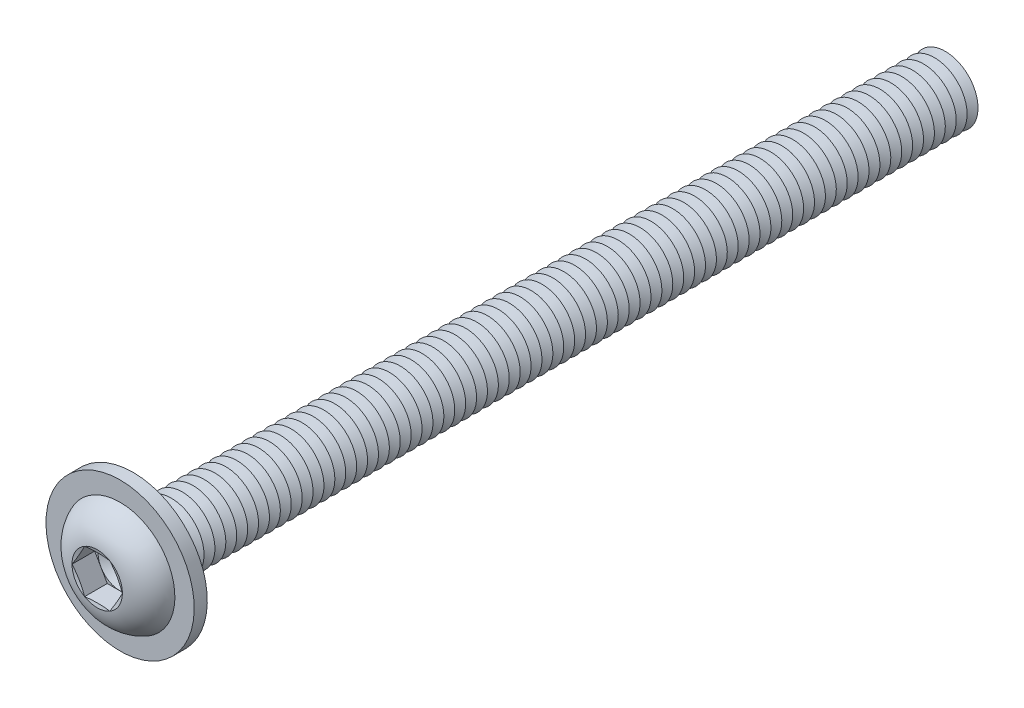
ISO-10303-21;
HEADER;
FILE_DESCRIPTION(('STEP AP214'),'2;1');
FILE_NAME('part.step','',(''),(''),'','','');
FILE_SCHEMA(('AUTOMOTIVE_DESIGN { 1 0 10303 214 1 1 1 1 }'));
ENDSEC;
DATA;
#1=APPLICATION_CONTEXT('core data for automotive mechanical design processes');
#2=APPLICATION_PROTOCOL_DEFINITION('international standard','automotive_design',2000,#1);
#3=PRODUCT_CONTEXT('',#1,'mechanical');
#4=PRODUCT('Part','Part','',(#3));
#5=PRODUCT_RELATED_PRODUCT_CATEGORY('part','',(#4));
#6=PRODUCT_DEFINITION_FORMATION('','',#4);
#7=PRODUCT_DEFINITION_CONTEXT('part definition',#1,'design');
#8=PRODUCT_DEFINITION('design','',#6,#7);
#9=PRODUCT_DEFINITION_SHAPE('','',#8);
#10=(LENGTH_UNIT() NAMED_UNIT(*) SI_UNIT(.MILLI.,.METRE.));
#11=(NAMED_UNIT(*) PLANE_ANGLE_UNIT() SI_UNIT($,.RADIAN.));
#12=(NAMED_UNIT(*) SI_UNIT($,.STERADIAN.) SOLID_ANGLE_UNIT());
#13=UNCERTAINTY_MEASURE_WITH_UNIT(LENGTH_MEASURE(1.E-05),#10,'distance_accuracy_value','');
#14=(GEOMETRIC_REPRESENTATION_CONTEXT(3) GLOBAL_UNCERTAINTY_ASSIGNED_CONTEXT((#13)) GLOBAL_UNIT_ASSIGNED_CONTEXT((#10,
#11,#12)) REPRESENTATION_CONTEXT('',''));
#15=CARTESIAN_POINT('',(0.,0.,0.));
#16=DIRECTION('',(0.,0.,1.));
#17=DIRECTION('',(1.,0.,0.));
#18=AXIS2_PLACEMENT_3D('',#15,#16,#17);
#19=CARTESIAN_POINT('',(0.,0.,-71.5));
#20=DIRECTION('',(0.,0.,1.));
#21=DIRECTION('',(0.,-1.,0.));
#22=AXIS2_PLACEMENT_3D('',#19,#20,#21);
#23=CONICAL_SURFACE('',#22,2.99999999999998,1.0471975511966);
#24=CARTESIAN_POINT('',(0.,0.,-72.));
#25=DIRECTION('',(0.,0.,1.));
#26=DIRECTION('',(0.,-1.,0.));
#27=AXIS2_PLACEMENT_3D('',#24,#25,#26);
#28=CIRCLE('',#27,2.13397459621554);
#29=CARTESIAN_POINT('',(0.,-2.1339745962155,-72.));
#30=VERTEX_POINT('',#29);
#31=EDGE_CURVE('E810',#30,#30,#28,.T.);
#32=ORIENTED_EDGE('',*,*,#31,.T.);
#33=EDGE_LOOP('',(#32));
#34=FACE_BOUND('',#33,.T.);
#35=CARTESIAN_POINT('',(0.,0.,-71.5));
#36=DIRECTION('',(0.,0.,1.));
#37=DIRECTION('',(0.,-1.,0.));
#38=AXIS2_PLACEMENT_3D('',#35,#36,#37);
#39=CIRCLE('',#38,2.99999999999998);
#40=CARTESIAN_POINT('',(0.,-2.99999999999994,-71.5));
#41=VERTEX_POINT('',#40);
#42=EDGE_CURVE('E806',#41,#41,#39,.T.);
#43=ORIENTED_EDGE('',*,*,#42,.F.);
#44=EDGE_LOOP('',(#43));
#45=FACE_BOUND('',#44,.T.);
#46=ADVANCED_FACE('F39',(#34,#45),#23,.T.);
#47=CARTESIAN_POINT('',(0.,0.,-72.));
#48=DIRECTION('',(0.,0.,-1.));
#49=DIRECTION('',(0.,1.,0.));
#50=AXIS2_PLACEMENT_3D('',#47,#48,#49);
#51=CONICAL_SURFACE('',#50,2.13397459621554,1.0471975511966);
#52=CARTESIAN_POINT('',(0.,0.,-72.5));
#53=DIRECTION('',(0.,0.,1.));
#54=DIRECTION('',(0.,-1.,0.));
#55=AXIS2_PLACEMENT_3D('',#52,#53,#54);
#56=CIRCLE('',#55,2.99999999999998);
#57=CARTESIAN_POINT('',(0.,-2.99999999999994,-72.5));
#58=VERTEX_POINT('',#57);
#59=EDGE_CURVE('E814',#58,#58,#56,.T.);
#60=ORIENTED_EDGE('',*,*,#59,.T.);
#61=EDGE_LOOP('',(#60));
#62=FACE_BOUND('',#61,.T.);
#63=ORIENTED_EDGE('',*,*,#31,.F.);
#64=EDGE_LOOP('',(#63));
#65=FACE_BOUND('',#64,.T.);
#66=ADVANCED_FACE('F929',(#62,#65),#51,.T.);
#67=CARTESIAN_POINT('',(0.,2.99999999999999,-75.));
#68=DIRECTION('',(0.,0.,-1.));
#69=DIRECTION('',(0.,1.,0.));
#70=AXIS2_PLACEMENT_3D('',#67,#68,#69);
#71=PLANE('',#70);
#72=CARTESIAN_POINT('',(0.,0.,-75.));
#73=DIRECTION('',(0.,0.,1.));
#74=DIRECTION('',(0.,-1.,0.));
#75=AXIS2_PLACEMENT_3D('',#72,#73,#74);
#76=CIRCLE('',#75,2.13397459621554);
#77=CARTESIAN_POINT('',(0.,-2.1339745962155,-75.));
#78=VERTEX_POINT('',#77);
#79=EDGE_CURVE('E833',#78,#78,#76,.T.);
#80=ORIENTED_EDGE('',*,*,#79,.F.);
#81=EDGE_LOOP('',(#80));
#82=FACE_BOUND('',#81,.T.);
#83=ADVANCED_FACE('F935',(#82),#71,.T.);
#84=CARTESIAN_POINT('',(0.,0.,-74.5));
#85=DIRECTION('',(0.,0.,1.));
#86=DIRECTION('',(0.,-1.,0.));
#87=AXIS2_PLACEMENT_3D('',#84,#85,#86);
#88=CONICAL_SURFACE('',#87,2.99999999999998,1.0471975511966);
#89=ORIENTED_EDGE('',*,*,#79,.T.);
#90=EDGE_LOOP('',(#89));
#91=FACE_BOUND('',#90,.T.);
#92=CARTESIAN_POINT('',(0.,0.,-74.5));
#93=DIRECTION('',(0.,0.,1.));
#94=DIRECTION('',(0.,-1.,0.));
#95=AXIS2_PLACEMENT_3D('',#92,#93,#94);
#96=CIRCLE('',#95,2.99999999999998);
#97=CARTESIAN_POINT('',(0.,-2.99999999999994,-74.5));
#98=VERTEX_POINT('',#97);
#99=EDGE_CURVE('E829',#98,#98,#96,.T.);
#100=ORIENTED_EDGE('',*,*,#99,.F.);
#101=EDGE_LOOP('',(#100));
#102=FACE_BOUND('',#101,.T.);
#103=ADVANCED_FACE('F954',(#91,#102),#88,.T.);
#104=CARTESIAN_POINT('',(0.,0.,-74.));
#105=DIRECTION('',(0.,0.,-1.));
#106=DIRECTION('',(0.,1.,0.));
#107=AXIS2_PLACEMENT_3D('',#104,#105,#106);
#108=CONICAL_SURFACE('',#107,2.13397459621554,1.0471975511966);
#109=ORIENTED_EDGE('',*,*,#99,.T.);
#110=EDGE_LOOP('',(#109));
#111=FACE_BOUND('',#110,.T.);
#112=CARTESIAN_POINT('',(0.,0.,-74.));
#113=DIRECTION('',(0.,0.,1.));
#114=DIRECTION('',(0.,-1.,0.));
#115=AXIS2_PLACEMENT_3D('',#112,#113,#114);
#116=CIRCLE('',#115,2.13397459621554);
#117=CARTESIAN_POINT('',(0.,-2.1339745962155,-74.));
#118=VERTEX_POINT('',#117);
#119=EDGE_CURVE('E825',#118,#118,#116,.T.);
#120=ORIENTED_EDGE('',*,*,#119,.F.);
#121=EDGE_LOOP('',(#120));
#122=FACE_BOUND('',#121,.T.);
#123=ADVANCED_FACE('F951',(#111,#122),#108,.T.);
#124=CARTESIAN_POINT('',(0.,0.,-73.5));
#125=DIRECTION('',(0.,0.,1.));
#126=DIRECTION('',(0.,-1.,0.));
#127=AXIS2_PLACEMENT_3D('',#124,#125,#126);
#128=CONICAL_SURFACE('',#127,2.99999999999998,1.0471975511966);
#129=ORIENTED_EDGE('',*,*,#119,.T.);
#130=EDGE_LOOP('',(#129));
#131=FACE_BOUND('',#130,.T.);
#132=CARTESIAN_POINT('',(0.,0.,-73.5));
#133=DIRECTION('',(0.,0.,1.));
#134=DIRECTION('',(0.,-1.,0.));
#135=AXIS2_PLACEMENT_3D('',#132,#133,#134);
#136=CIRCLE('',#135,2.99999999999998);
#137=CARTESIAN_POINT('',(0.,-2.99999999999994,-73.5));
#138=VERTEX_POINT('',#137);
#139=EDGE_CURVE('E822',#138,#138,#136,.T.);
#140=ORIENTED_EDGE('',*,*,#139,.F.);
#141=EDGE_LOOP('',(#140));
#142=FACE_BOUND('',#141,.T.);
#143=ADVANCED_FACE('F945',(#131,#142),#128,.T.);
#144=CARTESIAN_POINT('',(0.,0.,-73.));
#145=DIRECTION('',(0.,0.,-1.));
#146=DIRECTION('',(0.,1.,0.));
#147=AXIS2_PLACEMENT_3D('',#144,#145,#146);
#148=CONICAL_SURFACE('',#147,2.13397459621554,1.0471975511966);
#149=ORIENTED_EDGE('',*,*,#139,.T.);
#150=EDGE_LOOP('',(#149));
#151=FACE_BOUND('',#150,.T.);
#152=CARTESIAN_POINT('',(0.,0.,-73.));
#153=DIRECTION('',(0.,0.,1.));
#154=DIRECTION('',(0.,-1.,0.));
#155=AXIS2_PLACEMENT_3D('',#152,#153,#154);
#156=CIRCLE('',#155,2.13397459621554);
#157=CARTESIAN_POINT('',(0.,-2.1339745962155,-73.));
#158=VERTEX_POINT('',#157);
#159=EDGE_CURVE('E818',#158,#158,#156,.T.);
#160=ORIENTED_EDGE('',*,*,#159,.F.);
#161=EDGE_LOOP('',(#160));
#162=FACE_BOUND('',#161,.T.);
#163=ADVANCED_FACE('F941',(#151,#162),#148,.T.);
#164=CARTESIAN_POINT('',(0.,0.,-72.5));
#165=DIRECTION('',(0.,0.,1.));
#166=DIRECTION('',(0.,-1.,0.));
#167=AXIS2_PLACEMENT_3D('',#164,#165,#166);
#168=CONICAL_SURFACE('',#167,2.99999999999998,1.0471975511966);
#169=ORIENTED_EDGE('',*,*,#159,.T.);
#170=EDGE_LOOP('',(#169));
#171=FACE_BOUND('',#170,.T.);
#172=ORIENTED_EDGE('',*,*,#59,.F.);
#173=EDGE_LOOP('',(#172));
#174=FACE_BOUND('',#173,.T.);
#175=ADVANCED_FACE('F944',(#171,#174),#168,.T.);
#176=CARTESIAN_POINT('',(0.,0.,-70.5));
#177=DIRECTION('',(0.,0.,1.));
#178=DIRECTION('',(0.,-1.,0.));
#179=AXIS2_PLACEMENT_3D('',#176,#177,#178);
#180=CONICAL_SURFACE('',#179,2.99999999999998,1.0471975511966);
#181=CARTESIAN_POINT('',(0.,0.,-71.));
#182=DIRECTION('',(0.,0.,1.));
#183=DIRECTION('',(0.,-1.,0.));
#184=AXIS2_PLACEMENT_3D('',#181,#182,#183);
#185=CIRCLE('',#184,2.13397459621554);
#186=CARTESIAN_POINT('',(0.,-2.1339745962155,-71.));
#187=VERTEX_POINT('',#186);
#188=EDGE_CURVE('E802',#187,#187,#185,.T.);
#189=ORIENTED_EDGE('',*,*,#188,.T.);
#190=EDGE_LOOP('',(#189));
#191=FACE_BOUND('',#190,.T.);
#192=CARTESIAN_POINT('',(0.,0.,-70.5));
#193=DIRECTION('',(0.,0.,1.));
#194=DIRECTION('',(0.,-1.,0.));
#195=AXIS2_PLACEMENT_3D('',#192,#193,#194);
#196=CIRCLE('',#195,2.99999999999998);
#197=CARTESIAN_POINT('',(0.,-2.99999999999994,-70.5));
#198=VERTEX_POINT('',#197);
#199=EDGE_CURVE('E798',#198,#198,#196,.T.);
#200=ORIENTED_EDGE('',*,*,#199,.F.);
#201=EDGE_LOOP('',(#200));
#202=FACE_BOUND('',#201,.T.);
#203=ADVANCED_FACE('F949',(#191,#202),#180,.T.);
#204=CARTESIAN_POINT('',(0.,0.,-71.));
#205=DIRECTION('',(0.,0.,-1.));
#206=DIRECTION('',(0.,1.,0.));
#207=AXIS2_PLACEMENT_3D('',#204,#205,#206);
#208=CONICAL_SURFACE('',#207,2.13397459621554,1.0471975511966);
#209=ORIENTED_EDGE('',*,*,#42,.T.);
#210=EDGE_LOOP('',(#209));
#211=FACE_BOUND('',#210,.T.);
#212=ORIENTED_EDGE('',*,*,#188,.F.);
#213=EDGE_LOOP('',(#212));
#214=FACE_BOUND('',#213,.T.);
#215=ADVANCED_FACE('F1000',(#211,#214),#208,.T.);
#216=CARTESIAN_POINT('',(0.,0.,-69.5));
#217=DIRECTION('',(0.,0.,1.));
#218=DIRECTION('',(0.,-1.,0.));
#219=AXIS2_PLACEMENT_3D('',#216,#217,#218);
#220=CONICAL_SURFACE('',#219,2.99999999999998,1.0471975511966);
#221=CARTESIAN_POINT('',(0.,0.,-70.));
#222=DIRECTION('',(0.,0.,1.));
#223=DIRECTION('',(0.,-1.,0.));
#224=AXIS2_PLACEMENT_3D('',#221,#222,#223);
#225=CIRCLE('',#224,2.13397459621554);
#226=CARTESIAN_POINT('',(0.,-2.1339745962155,-70.));
#227=VERTEX_POINT('',#226);
#228=EDGE_CURVE('E794',#227,#227,#225,.T.);
#229=ORIENTED_EDGE('',*,*,#228,.T.);
#230=EDGE_LOOP('',(#229));
#231=FACE_BOUND('',#230,.T.);
#232=CARTESIAN_POINT('',(0.,0.,-69.5));
#233=DIRECTION('',(0.,0.,1.));
#234=DIRECTION('',(0.,-1.,0.));
#235=AXIS2_PLACEMENT_3D('',#232,#233,#234);
#236=CIRCLE('',#235,2.99999999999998);
#237=CARTESIAN_POINT('',(0.,-2.99999999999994,-69.5));
#238=VERTEX_POINT('',#237);
#239=EDGE_CURVE('E790',#238,#238,#236,.T.);
#240=ORIENTED_EDGE('',*,*,#239,.F.);
#241=EDGE_LOOP('',(#240));
#242=FACE_BOUND('',#241,.T.);
#243=ADVANCED_FACE('F1006',(#231,#242),#220,.T.);
#244=CARTESIAN_POINT('',(0.,0.,-70.));
#245=DIRECTION('',(0.,0.,-1.));
#246=DIRECTION('',(0.,1.,0.));
#247=AXIS2_PLACEMENT_3D('',#244,#245,#246);
#248=CONICAL_SURFACE('',#247,2.13397459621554,1.0471975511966);
#249=ORIENTED_EDGE('',*,*,#199,.T.);
#250=EDGE_LOOP('',(#249));
#251=FACE_BOUND('',#250,.T.);
#252=ORIENTED_EDGE('',*,*,#228,.F.);
#253=EDGE_LOOP('',(#252));
#254=FACE_BOUND('',#253,.T.);
#255=ADVANCED_FACE('F1013',(#251,#254),#248,.T.);
#256=CARTESIAN_POINT('',(0.,0.,-68.4999999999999));
#257=DIRECTION('',(0.,0.,1.));
#258=DIRECTION('',(0.,-1.,0.));
#259=AXIS2_PLACEMENT_3D('',#256,#257,#258);
#260=CONICAL_SURFACE('',#259,2.99999999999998,1.0471975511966);
#261=CARTESIAN_POINT('',(0.,0.,-68.9999999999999));
#262=DIRECTION('',(0.,0.,1.));
#263=DIRECTION('',(0.,-1.,0.));
#264=AXIS2_PLACEMENT_3D('',#261,#262,#263);
#265=CIRCLE('',#264,2.13397459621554);
#266=CARTESIAN_POINT('',(0.,-2.1339745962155,-68.9999999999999));
#267=VERTEX_POINT('',#266);
#268=EDGE_CURVE('E786',#267,#267,#265,.T.);
#269=ORIENTED_EDGE('',*,*,#268,.T.);
#270=EDGE_LOOP('',(#269));
#271=FACE_BOUND('',#270,.T.);
#272=CARTESIAN_POINT('',(0.,0.,-68.4999999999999));
#273=DIRECTION('',(0.,0.,1.));
#274=DIRECTION('',(0.,-1.,0.));
#275=AXIS2_PLACEMENT_3D('',#272,#273,#274);
#276=CIRCLE('',#275,2.99999999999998);
#277=CARTESIAN_POINT('',(0.,-2.99999999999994,-68.4999999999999));
#278=VERTEX_POINT('',#277);
#279=EDGE_CURVE('E782',#278,#278,#276,.T.);
#280=ORIENTED_EDGE('',*,*,#279,.F.);
#281=EDGE_LOOP('',(#280));
#282=FACE_BOUND('',#281,.T.);
#283=ADVANCED_FACE('F1020',(#271,#282),#260,.T.);
#284=CARTESIAN_POINT('',(0.,0.,-68.9999999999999));
#285=DIRECTION('',(0.,0.,-1.));
#286=DIRECTION('',(0.,1.,0.));
#287=AXIS2_PLACEMENT_3D('',#284,#285,#286);
#288=CONICAL_SURFACE('',#287,2.13397459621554,1.0471975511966);
#289=ORIENTED_EDGE('',*,*,#239,.T.);
#290=EDGE_LOOP('',(#289));
#291=FACE_BOUND('',#290,.T.);
#292=ORIENTED_EDGE('',*,*,#268,.F.);
#293=EDGE_LOOP('',(#292));
#294=FACE_BOUND('',#293,.T.);
#295=ADVANCED_FACE('F1027',(#291,#294),#288,.T.);
#296=CARTESIAN_POINT('',(0.,0.,-67.4999999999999));
#297=DIRECTION('',(0.,0.,1.));
#298=DIRECTION('',(0.,-1.,0.));
#299=AXIS2_PLACEMENT_3D('',#296,#297,#298);
#300=CONICAL_SURFACE('',#299,2.99999999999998,1.0471975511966);
#301=CARTESIAN_POINT('',(0.,0.,-67.9999999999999));
#302=DIRECTION('',(0.,0.,1.));
#303=DIRECTION('',(0.,-1.,0.));
#304=AXIS2_PLACEMENT_3D('',#301,#302,#303);
#305=CIRCLE('',#304,2.13397459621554);
#306=CARTESIAN_POINT('',(0.,-2.1339745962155,-67.9999999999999));
#307=VERTEX_POINT('',#306);
#308=EDGE_CURVE('E778',#307,#307,#305,.T.);
#309=ORIENTED_EDGE('',*,*,#308,.T.);
#310=EDGE_LOOP('',(#309));
#311=FACE_BOUND('',#310,.T.);
#312=CARTESIAN_POINT('',(0.,0.,-67.4999999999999));
#313=DIRECTION('',(0.,0.,1.));
#314=DIRECTION('',(0.,-1.,0.));
#315=AXIS2_PLACEMENT_3D('',#312,#313,#314);
#316=CIRCLE('',#315,2.99999999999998);
#317=CARTESIAN_POINT('',(0.,-2.99999999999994,-67.4999999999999));
#318=VERTEX_POINT('',#317);
#319=EDGE_CURVE('E774',#318,#318,#316,.T.);
#320=ORIENTED_EDGE('',*,*,#319,.F.);
#321=EDGE_LOOP('',(#320));
#322=FACE_BOUND('',#321,.T.);
#323=ADVANCED_FACE('F1034',(#311,#322),#300,.T.);
#324=CARTESIAN_POINT('',(0.,0.,-67.9999999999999));
#325=DIRECTION('',(0.,0.,-1.));
#326=DIRECTION('',(0.,1.,0.));
#327=AXIS2_PLACEMENT_3D('',#324,#325,#326);
#328=CONICAL_SURFACE('',#327,2.13397459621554,1.0471975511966);
#329=ORIENTED_EDGE('',*,*,#279,.T.);
#330=EDGE_LOOP('',(#329));
#331=FACE_BOUND('',#330,.T.);
#332=ORIENTED_EDGE('',*,*,#308,.F.);
#333=EDGE_LOOP('',(#332));
#334=FACE_BOUND('',#333,.T.);
#335=ADVANCED_FACE('F1041',(#331,#334),#328,.T.);
#336=CARTESIAN_POINT('',(0.,0.,-66.4999999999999));
#337=DIRECTION('',(0.,0.,1.));
#338=DIRECTION('',(0.,-1.,0.));
#339=AXIS2_PLACEMENT_3D('',#336,#337,#338);
#340=CONICAL_SURFACE('',#339,2.99999999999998,1.0471975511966);
#341=CARTESIAN_POINT('',(0.,0.,-66.9999999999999));
#342=DIRECTION('',(0.,0.,1.));
#343=DIRECTION('',(0.,-1.,0.));
#344=AXIS2_PLACEMENT_3D('',#341,#342,#343);
#345=CIRCLE('',#344,2.13397459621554);
#346=CARTESIAN_POINT('',(0.,-2.1339745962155,-66.9999999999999));
#347=VERTEX_POINT('',#346);
#348=EDGE_CURVE('E770',#347,#347,#345,.T.);
#349=ORIENTED_EDGE('',*,*,#348,.T.);
#350=EDGE_LOOP('',(#349));
#351=FACE_BOUND('',#350,.T.);
#352=CARTESIAN_POINT('',(0.,0.,-66.4999999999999));
#353=DIRECTION('',(0.,0.,1.));
#354=DIRECTION('',(0.,-1.,0.));
#355=AXIS2_PLACEMENT_3D('',#352,#353,#354);
#356=CIRCLE('',#355,2.99999999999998);
#357=CARTESIAN_POINT('',(0.,-2.99999999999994,-66.4999999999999));
#358=VERTEX_POINT('',#357);
#359=EDGE_CURVE('E766',#358,#358,#356,.T.);
#360=ORIENTED_EDGE('',*,*,#359,.F.);
#361=EDGE_LOOP('',(#360));
#362=FACE_BOUND('',#361,.T.);
#363=ADVANCED_FACE('F1048',(#351,#362),#340,.T.);
#364=CARTESIAN_POINT('',(0.,0.,-66.9999999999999));
#365=DIRECTION('',(0.,0.,-1.));
#366=DIRECTION('',(0.,1.,0.));
#367=AXIS2_PLACEMENT_3D('',#364,#365,#366);
#368=CONICAL_SURFACE('',#367,2.13397459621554,1.0471975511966);
#369=ORIENTED_EDGE('',*,*,#319,.T.);
#370=EDGE_LOOP('',(#369));
#371=FACE_BOUND('',#370,.T.);
#372=ORIENTED_EDGE('',*,*,#348,.F.);
#373=EDGE_LOOP('',(#372));
#374=FACE_BOUND('',#373,.T.);
#375=ADVANCED_FACE('F1055',(#371,#374),#368,.T.);
#376=CARTESIAN_POINT('',(0.,0.,-65.4999999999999));
#377=DIRECTION('',(0.,0.,1.));
#378=DIRECTION('',(0.,-1.,0.));
#379=AXIS2_PLACEMENT_3D('',#376,#377,#378);
#380=CONICAL_SURFACE('',#379,2.99999999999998,1.0471975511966);
#381=CARTESIAN_POINT('',(0.,0.,-65.9999999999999));
#382=DIRECTION('',(0.,0.,1.));
#383=DIRECTION('',(0.,-1.,0.));
#384=AXIS2_PLACEMENT_3D('',#381,#382,#383);
#385=CIRCLE('',#384,2.13397459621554);
#386=CARTESIAN_POINT('',(0.,-2.1339745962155,-65.9999999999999));
#387=VERTEX_POINT('',#386);
#388=EDGE_CURVE('E762',#387,#387,#385,.T.);
#389=ORIENTED_EDGE('',*,*,#388,.T.);
#390=EDGE_LOOP('',(#389));
#391=FACE_BOUND('',#390,.T.);
#392=CARTESIAN_POINT('',(0.,0.,-65.5));
#393=DIRECTION('',(0.,0.,1.));
#394=DIRECTION('',(0.,-1.,0.));
#395=AXIS2_PLACEMENT_3D('',#392,#393,#394);
#396=CIRCLE('',#395,2.99999999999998);
#397=CARTESIAN_POINT('',(0.,-2.99999999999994,-65.5));
#398=VERTEX_POINT('',#397);
#399=EDGE_CURVE('E758',#398,#398,#396,.T.);
#400=ORIENTED_EDGE('',*,*,#399,.F.);
#401=EDGE_LOOP('',(#400));
#402=FACE_BOUND('',#401,.T.);
#403=ADVANCED_FACE('F1062',(#391,#402),#380,.T.);
#404=CARTESIAN_POINT('',(0.,0.,-65.9999999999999));
#405=DIRECTION('',(0.,0.,-1.));
#406=DIRECTION('',(0.,1.,0.));
#407=AXIS2_PLACEMENT_3D('',#404,#405,#406);
#408=CONICAL_SURFACE('',#407,2.13397459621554,1.0471975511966);
#409=ORIENTED_EDGE('',*,*,#359,.T.);
#410=EDGE_LOOP('',(#409));
#411=FACE_BOUND('',#410,.T.);
#412=ORIENTED_EDGE('',*,*,#388,.F.);
#413=EDGE_LOOP('',(#412));
#414=FACE_BOUND('',#413,.T.);
#415=ADVANCED_FACE('F1069',(#411,#414),#408,.T.);
#416=CARTESIAN_POINT('',(0.,0.,-64.5));
#417=DIRECTION('',(0.,0.,1.));
#418=DIRECTION('',(0.,-1.,0.));
#419=AXIS2_PLACEMENT_3D('',#416,#417,#418);
#420=CONICAL_SURFACE('',#419,2.99999999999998,1.0471975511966);
#421=CARTESIAN_POINT('',(0.,0.,-65.));
#422=DIRECTION('',(0.,0.,1.));
#423=DIRECTION('',(0.,-1.,0.));
#424=AXIS2_PLACEMENT_3D('',#421,#422,#423);
#425=CIRCLE('',#424,2.13397459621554);
#426=CARTESIAN_POINT('',(0.,-2.1339745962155,-65.));
#427=VERTEX_POINT('',#426);
#428=EDGE_CURVE('E754',#427,#427,#425,.T.);
#429=ORIENTED_EDGE('',*,*,#428,.T.);
#430=EDGE_LOOP('',(#429));
#431=FACE_BOUND('',#430,.T.);
#432=CARTESIAN_POINT('',(0.,0.,-64.5));
#433=DIRECTION('',(0.,0.,1.));
#434=DIRECTION('',(0.,-1.,0.));
#435=AXIS2_PLACEMENT_3D('',#432,#433,#434);
#436=CIRCLE('',#435,2.99999999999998);
#437=CARTESIAN_POINT('',(0.,-2.99999999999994,-64.5));
#438=VERTEX_POINT('',#437);
#439=EDGE_CURVE('E750',#438,#438,#436,.T.);
#440=ORIENTED_EDGE('',*,*,#439,.F.);
#441=EDGE_LOOP('',(#440));
#442=FACE_BOUND('',#441,.T.);
#443=ADVANCED_FACE('F1076',(#431,#442),#420,.T.);
#444=CARTESIAN_POINT('',(0.,0.,-65.));
#445=DIRECTION('',(0.,0.,-1.));
#446=DIRECTION('',(0.,1.,0.));
#447=AXIS2_PLACEMENT_3D('',#444,#445,#446);
#448=CONICAL_SURFACE('',#447,2.13397459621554,1.0471975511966);
#449=ORIENTED_EDGE('',*,*,#399,.T.);
#450=EDGE_LOOP('',(#449));
#451=FACE_BOUND('',#450,.T.);
#452=ORIENTED_EDGE('',*,*,#428,.F.);
#453=EDGE_LOOP('',(#452));
#454=FACE_BOUND('',#453,.T.);
#455=ADVANCED_FACE('F1083',(#451,#454),#448,.T.);
#456=CARTESIAN_POINT('',(0.,0.,-63.5));
#457=DIRECTION('',(0.,0.,1.));
#458=DIRECTION('',(0.,-1.,0.));
#459=AXIS2_PLACEMENT_3D('',#456,#457,#458);
#460=CONICAL_SURFACE('',#459,2.99999999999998,1.0471975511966);
#461=CARTESIAN_POINT('',(0.,0.,-64.));
#462=DIRECTION('',(0.,0.,1.));
#463=DIRECTION('',(0.,-1.,0.));
#464=AXIS2_PLACEMENT_3D('',#461,#462,#463);
#465=CIRCLE('',#464,2.13397459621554);
#466=CARTESIAN_POINT('',(0.,-2.1339745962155,-64.));
#467=VERTEX_POINT('',#466);
#468=EDGE_CURVE('E746',#467,#467,#465,.T.);
#469=ORIENTED_EDGE('',*,*,#468,.T.);
#470=EDGE_LOOP('',(#469));
#471=FACE_BOUND('',#470,.T.);
#472=CARTESIAN_POINT('',(0.,0.,-63.5));
#473=DIRECTION('',(0.,0.,1.));
#474=DIRECTION('',(0.,-1.,0.));
#475=AXIS2_PLACEMENT_3D('',#472,#473,#474);
#476=CIRCLE('',#475,2.99999999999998);
#477=CARTESIAN_POINT('',(0.,-2.99999999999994,-63.5));
#478=VERTEX_POINT('',#477);
#479=EDGE_CURVE('E742',#478,#478,#476,.T.);
#480=ORIENTED_EDGE('',*,*,#479,.F.);
#481=EDGE_LOOP('',(#480));
#482=FACE_BOUND('',#481,.T.);
#483=ADVANCED_FACE('F1090',(#471,#482),#460,.T.);
#484=CARTESIAN_POINT('',(0.,0.,-64.));
#485=DIRECTION('',(0.,0.,-1.));
#486=DIRECTION('',(0.,1.,0.));
#487=AXIS2_PLACEMENT_3D('',#484,#485,#486);
#488=CONICAL_SURFACE('',#487,2.13397459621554,1.0471975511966);
#489=ORIENTED_EDGE('',*,*,#439,.T.);
#490=EDGE_LOOP('',(#489));
#491=FACE_BOUND('',#490,.T.);
#492=ORIENTED_EDGE('',*,*,#468,.F.);
#493=EDGE_LOOP('',(#492));
#494=FACE_BOUND('',#493,.T.);
#495=ADVANCED_FACE('F1097',(#491,#494),#488,.T.);
#496=CARTESIAN_POINT('',(0.,0.,-62.5));
#497=DIRECTION('',(0.,0.,1.));
#498=DIRECTION('',(0.,-1.,0.));
#499=AXIS2_PLACEMENT_3D('',#496,#497,#498);
#500=CONICAL_SURFACE('',#499,2.99999999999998,1.0471975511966);
#501=CARTESIAN_POINT('',(0.,0.,-63.));
#502=DIRECTION('',(0.,0.,1.));
#503=DIRECTION('',(0.,-1.,0.));
#504=AXIS2_PLACEMENT_3D('',#501,#502,#503);
#505=CIRCLE('',#504,2.13397459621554);
#506=CARTESIAN_POINT('',(0.,-2.13397459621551,-63.));
#507=VERTEX_POINT('',#506);
#508=EDGE_CURVE('E738',#507,#507,#505,.T.);
#509=ORIENTED_EDGE('',*,*,#508,.T.);
#510=EDGE_LOOP('',(#509));
#511=FACE_BOUND('',#510,.T.);
#512=CARTESIAN_POINT('',(0.,0.,-62.5));
#513=DIRECTION('',(0.,0.,1.));
#514=DIRECTION('',(0.,-1.,0.));
#515=AXIS2_PLACEMENT_3D('',#512,#513,#514);
#516=CIRCLE('',#515,2.99999999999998);
#517=CARTESIAN_POINT('',(0.,-2.99999999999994,-62.5));
#518=VERTEX_POINT('',#517);
#519=EDGE_CURVE('E734',#518,#518,#516,.T.);
#520=ORIENTED_EDGE('',*,*,#519,.F.);
#521=EDGE_LOOP('',(#520));
#522=FACE_BOUND('',#521,.T.);
#523=ADVANCED_FACE('F1104',(#511,#522),#500,.T.);
#524=CARTESIAN_POINT('',(0.,0.,-63.));
#525=DIRECTION('',(0.,0.,-1.));
#526=DIRECTION('',(0.,1.,0.));
#527=AXIS2_PLACEMENT_3D('',#524,#525,#526);
#528=CONICAL_SURFACE('',#527,2.13397459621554,1.0471975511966);
#529=ORIENTED_EDGE('',*,*,#479,.T.);
#530=EDGE_LOOP('',(#529));
#531=FACE_BOUND('',#530,.T.);
#532=ORIENTED_EDGE('',*,*,#508,.F.);
#533=EDGE_LOOP('',(#532));
#534=FACE_BOUND('',#533,.T.);
#535=ADVANCED_FACE('F1111',(#531,#534),#528,.T.);
#536=CARTESIAN_POINT('',(0.,0.,-61.5));
#537=DIRECTION('',(0.,0.,1.));
#538=DIRECTION('',(0.,-1.,0.));
#539=AXIS2_PLACEMENT_3D('',#536,#537,#538);
#540=CONICAL_SURFACE('',#539,2.99999999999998,1.0471975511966);
#541=CARTESIAN_POINT('',(0.,0.,-62.));
#542=DIRECTION('',(0.,0.,1.));
#543=DIRECTION('',(0.,-1.,0.));
#544=AXIS2_PLACEMENT_3D('',#541,#542,#543);
#545=CIRCLE('',#544,2.13397459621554);
#546=CARTESIAN_POINT('',(0.,-2.13397459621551,-62.));
#547=VERTEX_POINT('',#546);
#548=EDGE_CURVE('E730',#547,#547,#545,.T.);
#549=ORIENTED_EDGE('',*,*,#548,.T.);
#550=EDGE_LOOP('',(#549));
#551=FACE_BOUND('',#550,.T.);
#552=CARTESIAN_POINT('',(0.,0.,-61.5));
#553=DIRECTION('',(0.,0.,1.));
#554=DIRECTION('',(0.,-1.,0.));
#555=AXIS2_PLACEMENT_3D('',#552,#553,#554);
#556=CIRCLE('',#555,2.99999999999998);
#557=CARTESIAN_POINT('',(0.,-2.99999999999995,-61.5));
#558=VERTEX_POINT('',#557);
#559=EDGE_CURVE('E726',#558,#558,#556,.T.);
#560=ORIENTED_EDGE('',*,*,#559,.F.);
#561=EDGE_LOOP('',(#560));
#562=FACE_BOUND('',#561,.T.);
#563=ADVANCED_FACE('F1118',(#551,#562),#540,.T.);
#564=CARTESIAN_POINT('',(0.,0.,-62.));
#565=DIRECTION('',(0.,0.,-1.));
#566=DIRECTION('',(0.,1.,0.));
#567=AXIS2_PLACEMENT_3D('',#564,#565,#566);
#568=CONICAL_SURFACE('',#567,2.13397459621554,1.0471975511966);
#569=ORIENTED_EDGE('',*,*,#519,.T.);
#570=EDGE_LOOP('',(#569));
#571=FACE_BOUND('',#570,.T.);
#572=ORIENTED_EDGE('',*,*,#548,.F.);
#573=EDGE_LOOP('',(#572));
#574=FACE_BOUND('',#573,.T.);
#575=ADVANCED_FACE('F1125',(#571,#574),#568,.T.);
#576=CARTESIAN_POINT('',(0.,0.,-60.5));
#577=DIRECTION('',(0.,0.,1.));
#578=DIRECTION('',(0.,-1.,0.));
#579=AXIS2_PLACEMENT_3D('',#576,#577,#578);
#580=CONICAL_SURFACE('',#579,2.99999999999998,1.0471975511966);
#581=CARTESIAN_POINT('',(0.,0.,-61.));
#582=DIRECTION('',(0.,0.,1.));
#583=DIRECTION('',(0.,-1.,0.));
#584=AXIS2_PLACEMENT_3D('',#581,#582,#583);
#585=CIRCLE('',#584,2.13397459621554);
#586=CARTESIAN_POINT('',(0.,-2.13397459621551,-61.));
#587=VERTEX_POINT('',#586);
#588=EDGE_CURVE('E722',#587,#587,#585,.T.);
#589=ORIENTED_EDGE('',*,*,#588,.T.);
#590=EDGE_LOOP('',(#589));
#591=FACE_BOUND('',#590,.T.);
#592=CARTESIAN_POINT('',(0.,0.,-60.5));
#593=DIRECTION('',(0.,0.,1.));
#594=DIRECTION('',(0.,-1.,0.));
#595=AXIS2_PLACEMENT_3D('',#592,#593,#594);
#596=CIRCLE('',#595,2.99999999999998);
#597=CARTESIAN_POINT('',(0.,-2.99999999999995,-60.5));
#598=VERTEX_POINT('',#597);
#599=EDGE_CURVE('E718',#598,#598,#596,.T.);
#600=ORIENTED_EDGE('',*,*,#599,.F.);
#601=EDGE_LOOP('',(#600));
#602=FACE_BOUND('',#601,.T.);
#603=ADVANCED_FACE('F1132',(#591,#602),#580,.T.);
#604=CARTESIAN_POINT('',(0.,0.,-61.));
#605=DIRECTION('',(0.,0.,-1.));
#606=DIRECTION('',(0.,1.,0.));
#607=AXIS2_PLACEMENT_3D('',#604,#605,#606);
#608=CONICAL_SURFACE('',#607,2.13397459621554,1.0471975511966);
#609=ORIENTED_EDGE('',*,*,#559,.T.);
#610=EDGE_LOOP('',(#609));
#611=FACE_BOUND('',#610,.T.);
#612=ORIENTED_EDGE('',*,*,#588,.F.);
#613=EDGE_LOOP('',(#612));
#614=FACE_BOUND('',#613,.T.);
#615=ADVANCED_FACE('F1139',(#611,#614),#608,.T.);
#616=CARTESIAN_POINT('',(0.,0.,-59.5));
#617=DIRECTION('',(0.,0.,1.));
#618=DIRECTION('',(0.,-1.,0.));
#619=AXIS2_PLACEMENT_3D('',#616,#617,#618);
#620=CONICAL_SURFACE('',#619,2.99999999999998,1.0471975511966);
#621=CARTESIAN_POINT('',(0.,0.,-60.));
#622=DIRECTION('',(0.,0.,1.));
#623=DIRECTION('',(0.,-1.,0.));
#624=AXIS2_PLACEMENT_3D('',#621,#622,#623);
#625=CIRCLE('',#624,2.13397459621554);
#626=CARTESIAN_POINT('',(0.,-2.13397459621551,-60.));
#627=VERTEX_POINT('',#626);
#628=EDGE_CURVE('E714',#627,#627,#625,.T.);
#629=ORIENTED_EDGE('',*,*,#628,.T.);
#630=EDGE_LOOP('',(#629));
#631=FACE_BOUND('',#630,.T.);
#632=CARTESIAN_POINT('',(0.,0.,-59.5));
#633=DIRECTION('',(0.,0.,1.));
#634=DIRECTION('',(0.,-1.,0.));
#635=AXIS2_PLACEMENT_3D('',#632,#633,#634);
#636=CIRCLE('',#635,2.99999999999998);
#637=CARTESIAN_POINT('',(0.,-2.99999999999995,-59.5));
#638=VERTEX_POINT('',#637);
#639=EDGE_CURVE('E710',#638,#638,#636,.T.);
#640=ORIENTED_EDGE('',*,*,#639,.F.);
#641=EDGE_LOOP('',(#640));
#642=FACE_BOUND('',#641,.T.);
#643=ADVANCED_FACE('F1146',(#631,#642),#620,.T.);
#644=CARTESIAN_POINT('',(0.,0.,-60.));
#645=DIRECTION('',(0.,0.,-1.));
#646=DIRECTION('',(0.,1.,0.));
#647=AXIS2_PLACEMENT_3D('',#644,#645,#646);
#648=CONICAL_SURFACE('',#647,2.13397459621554,1.0471975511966);
#649=ORIENTED_EDGE('',*,*,#599,.T.);
#650=EDGE_LOOP('',(#649));
#651=FACE_BOUND('',#650,.T.);
#652=ORIENTED_EDGE('',*,*,#628,.F.);
#653=EDGE_LOOP('',(#652));
#654=FACE_BOUND('',#653,.T.);
#655=ADVANCED_FACE('F1153',(#651,#654),#648,.T.);
#656=CARTESIAN_POINT('',(0.,0.,-58.5));
#657=DIRECTION('',(0.,0.,1.));
#658=DIRECTION('',(0.,-1.,0.));
#659=AXIS2_PLACEMENT_3D('',#656,#657,#658);
#660=CONICAL_SURFACE('',#659,2.99999999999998,1.0471975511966);
#661=CARTESIAN_POINT('',(0.,0.,-59.));
#662=DIRECTION('',(0.,0.,1.));
#663=DIRECTION('',(0.,-1.,0.));
#664=AXIS2_PLACEMENT_3D('',#661,#662,#663);
#665=CIRCLE('',#664,2.13397459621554);
#666=CARTESIAN_POINT('',(0.,-2.13397459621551,-59.));
#667=VERTEX_POINT('',#666);
#668=EDGE_CURVE('E706',#667,#667,#665,.T.);
#669=ORIENTED_EDGE('',*,*,#668,.T.);
#670=EDGE_LOOP('',(#669));
#671=FACE_BOUND('',#670,.T.);
#672=CARTESIAN_POINT('',(0.,0.,-58.5));
#673=DIRECTION('',(0.,0.,1.));
#674=DIRECTION('',(0.,-1.,0.));
#675=AXIS2_PLACEMENT_3D('',#672,#673,#674);
#676=CIRCLE('',#675,2.99999999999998);
#677=CARTESIAN_POINT('',(0.,-2.99999999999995,-58.5));
#678=VERTEX_POINT('',#677);
#679=EDGE_CURVE('E702',#678,#678,#676,.T.);
#680=ORIENTED_EDGE('',*,*,#679,.F.);
#681=EDGE_LOOP('',(#680));
#682=FACE_BOUND('',#681,.T.);
#683=ADVANCED_FACE('F1160',(#671,#682),#660,.T.);
#684=CARTESIAN_POINT('',(0.,0.,-59.));
#685=DIRECTION('',(0.,0.,-1.));
#686=DIRECTION('',(0.,1.,0.));
#687=AXIS2_PLACEMENT_3D('',#684,#685,#686);
#688=CONICAL_SURFACE('',#687,2.13397459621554,1.0471975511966);
#689=ORIENTED_EDGE('',*,*,#639,.T.);
#690=EDGE_LOOP('',(#689));
#691=FACE_BOUND('',#690,.T.);
#692=ORIENTED_EDGE('',*,*,#668,.F.);
#693=EDGE_LOOP('',(#692));
#694=FACE_BOUND('',#693,.T.);
#695=ADVANCED_FACE('F1167',(#691,#694),#688,.T.);
#696=CARTESIAN_POINT('',(0.,0.,-57.5));
#697=DIRECTION('',(0.,0.,1.));
#698=DIRECTION('',(0.,-1.,0.));
#699=AXIS2_PLACEMENT_3D('',#696,#697,#698);
#700=CONICAL_SURFACE('',#699,2.99999999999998,1.0471975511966);
#701=CARTESIAN_POINT('',(0.,0.,-58.));
#702=DIRECTION('',(0.,0.,1.));
#703=DIRECTION('',(0.,-1.,0.));
#704=AXIS2_PLACEMENT_3D('',#701,#702,#703);
#705=CIRCLE('',#704,2.13397459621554);
#706=CARTESIAN_POINT('',(0.,-2.13397459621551,-58.));
#707=VERTEX_POINT('',#706);
#708=EDGE_CURVE('E698',#707,#707,#705,.T.);
#709=ORIENTED_EDGE('',*,*,#708,.T.);
#710=EDGE_LOOP('',(#709));
#711=FACE_BOUND('',#710,.T.);
#712=CARTESIAN_POINT('',(0.,0.,-57.5));
#713=DIRECTION('',(0.,0.,1.));
#714=DIRECTION('',(0.,-1.,0.));
#715=AXIS2_PLACEMENT_3D('',#712,#713,#714);
#716=CIRCLE('',#715,2.99999999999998);
#717=CARTESIAN_POINT('',(0.,-2.99999999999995,-57.5));
#718=VERTEX_POINT('',#717);
#719=EDGE_CURVE('E694',#718,#718,#716,.T.);
#720=ORIENTED_EDGE('',*,*,#719,.F.);
#721=EDGE_LOOP('',(#720));
#722=FACE_BOUND('',#721,.T.);
#723=ADVANCED_FACE('F1174',(#711,#722),#700,.T.);
#724=CARTESIAN_POINT('',(0.,0.,-58.));
#725=DIRECTION('',(0.,0.,-1.));
#726=DIRECTION('',(0.,1.,0.));
#727=AXIS2_PLACEMENT_3D('',#724,#725,#726);
#728=CONICAL_SURFACE('',#727,2.13397459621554,1.0471975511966);
#729=ORIENTED_EDGE('',*,*,#679,.T.);
#730=EDGE_LOOP('',(#729));
#731=FACE_BOUND('',#730,.T.);
#732=ORIENTED_EDGE('',*,*,#708,.F.);
#733=EDGE_LOOP('',(#732));
#734=FACE_BOUND('',#733,.T.);
#735=ADVANCED_FACE('F1181',(#731,#734),#728,.T.);
#736=CARTESIAN_POINT('',(0.,0.,-56.5));
#737=DIRECTION('',(0.,0.,1.));
#738=DIRECTION('',(0.,-1.,0.));
#739=AXIS2_PLACEMENT_3D('',#736,#737,#738);
#740=CONICAL_SURFACE('',#739,2.99999999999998,1.0471975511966);
#741=CARTESIAN_POINT('',(0.,0.,-57.));
#742=DIRECTION('',(0.,0.,1.));
#743=DIRECTION('',(0.,-1.,0.));
#744=AXIS2_PLACEMENT_3D('',#741,#742,#743);
#745=CIRCLE('',#744,2.13397459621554);
#746=CARTESIAN_POINT('',(0.,-2.13397459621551,-57.));
#747=VERTEX_POINT('',#746);
#748=EDGE_CURVE('E690',#747,#747,#745,.T.);
#749=ORIENTED_EDGE('',*,*,#748,.T.);
#750=EDGE_LOOP('',(#749));
#751=FACE_BOUND('',#750,.T.);
#752=CARTESIAN_POINT('',(0.,0.,-56.5));
#753=DIRECTION('',(0.,0.,1.));
#754=DIRECTION('',(0.,-1.,0.));
#755=AXIS2_PLACEMENT_3D('',#752,#753,#754);
#756=CIRCLE('',#755,2.99999999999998);
#757=CARTESIAN_POINT('',(0.,-2.99999999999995,-56.5));
#758=VERTEX_POINT('',#757);
#759=EDGE_CURVE('E686',#758,#758,#756,.T.);
#760=ORIENTED_EDGE('',*,*,#759,.F.);
#761=EDGE_LOOP('',(#760));
#762=FACE_BOUND('',#761,.T.);
#763=ADVANCED_FACE('F1188',(#751,#762),#740,.T.);
#764=CARTESIAN_POINT('',(0.,0.,-57.));
#765=DIRECTION('',(0.,0.,-1.));
#766=DIRECTION('',(0.,1.,0.));
#767=AXIS2_PLACEMENT_3D('',#764,#765,#766);
#768=CONICAL_SURFACE('',#767,2.13397459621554,1.0471975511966);
#769=ORIENTED_EDGE('',*,*,#719,.T.);
#770=EDGE_LOOP('',(#769));
#771=FACE_BOUND('',#770,.T.);
#772=ORIENTED_EDGE('',*,*,#748,.F.);
#773=EDGE_LOOP('',(#772));
#774=FACE_BOUND('',#773,.T.);
#775=ADVANCED_FACE('F1195',(#771,#774),#768,.T.);
#776=CARTESIAN_POINT('',(0.,0.,-55.5));
#777=DIRECTION('',(0.,0.,1.));
#778=DIRECTION('',(0.,-1.,0.));
#779=AXIS2_PLACEMENT_3D('',#776,#777,#778);
#780=CONICAL_SURFACE('',#779,2.99999999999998,1.0471975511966);
#781=CARTESIAN_POINT('',(0.,0.,-56.));
#782=DIRECTION('',(0.,0.,1.));
#783=DIRECTION('',(0.,-1.,0.));
#784=AXIS2_PLACEMENT_3D('',#781,#782,#783);
#785=CIRCLE('',#784,2.13397459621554);
#786=CARTESIAN_POINT('',(0.,-2.13397459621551,-56.));
#787=VERTEX_POINT('',#786);
#788=EDGE_CURVE('E682',#787,#787,#785,.T.);
#789=ORIENTED_EDGE('',*,*,#788,.T.);
#790=EDGE_LOOP('',(#789));
#791=FACE_BOUND('',#790,.T.);
#792=CARTESIAN_POINT('',(0.,0.,-55.5));
#793=DIRECTION('',(0.,0.,1.));
#794=DIRECTION('',(0.,-1.,0.));
#795=AXIS2_PLACEMENT_3D('',#792,#793,#794);
#796=CIRCLE('',#795,2.99999999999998);
#797=CARTESIAN_POINT('',(0.,-2.99999999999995,-55.5));
#798=VERTEX_POINT('',#797);
#799=EDGE_CURVE('E678',#798,#798,#796,.T.);
#800=ORIENTED_EDGE('',*,*,#799,.F.);
#801=EDGE_LOOP('',(#800));
#802=FACE_BOUND('',#801,.T.);
#803=ADVANCED_FACE('F1202',(#791,#802),#780,.T.);
#804=CARTESIAN_POINT('',(0.,0.,-56.));
#805=DIRECTION('',(0.,0.,-1.));
#806=DIRECTION('',(0.,1.,0.));
#807=AXIS2_PLACEMENT_3D('',#804,#805,#806);
#808=CONICAL_SURFACE('',#807,2.13397459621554,1.0471975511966);
#809=ORIENTED_EDGE('',*,*,#759,.T.);
#810=EDGE_LOOP('',(#809));
#811=FACE_BOUND('',#810,.T.);
#812=ORIENTED_EDGE('',*,*,#788,.F.);
#813=EDGE_LOOP('',(#812));
#814=FACE_BOUND('',#813,.T.);
#815=ADVANCED_FACE('F1209',(#811,#814),#808,.T.);
#816=CARTESIAN_POINT('',(0.,0.,-54.5));
#817=DIRECTION('',(0.,0.,1.));
#818=DIRECTION('',(0.,-1.,0.));
#819=AXIS2_PLACEMENT_3D('',#816,#817,#818);
#820=CONICAL_SURFACE('',#819,2.99999999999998,1.0471975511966);
#821=CARTESIAN_POINT('',(0.,0.,-55.));
#822=DIRECTION('',(0.,0.,1.));
#823=DIRECTION('',(0.,-1.,0.));
#824=AXIS2_PLACEMENT_3D('',#821,#822,#823);
#825=CIRCLE('',#824,2.13397459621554);
#826=CARTESIAN_POINT('',(0.,-2.13397459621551,-55.));
#827=VERTEX_POINT('',#826);
#828=EDGE_CURVE('E674',#827,#827,#825,.T.);
#829=ORIENTED_EDGE('',*,*,#828,.T.);
#830=EDGE_LOOP('',(#829));
#831=FACE_BOUND('',#830,.T.);
#832=CARTESIAN_POINT('',(0.,0.,-54.5));
#833=DIRECTION('',(0.,0.,1.));
#834=DIRECTION('',(0.,-1.,0.));
#835=AXIS2_PLACEMENT_3D('',#832,#833,#834);
#836=CIRCLE('',#835,2.99999999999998);
#837=CARTESIAN_POINT('',(0.,-2.99999999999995,-54.5));
#838=VERTEX_POINT('',#837);
#839=EDGE_CURVE('E670',#838,#838,#836,.T.);
#840=ORIENTED_EDGE('',*,*,#839,.F.);
#841=EDGE_LOOP('',(#840));
#842=FACE_BOUND('',#841,.T.);
#843=ADVANCED_FACE('F1216',(#831,#842),#820,.T.);
#844=CARTESIAN_POINT('',(0.,0.,-55.));
#845=DIRECTION('',(0.,0.,-1.));
#846=DIRECTION('',(0.,1.,0.));
#847=AXIS2_PLACEMENT_3D('',#844,#845,#846);
#848=CONICAL_SURFACE('',#847,2.13397459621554,1.0471975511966);
#849=ORIENTED_EDGE('',*,*,#799,.T.);
#850=EDGE_LOOP('',(#849));
#851=FACE_BOUND('',#850,.T.);
#852=ORIENTED_EDGE('',*,*,#828,.F.);
#853=EDGE_LOOP('',(#852));
#854=FACE_BOUND('',#853,.T.);
#855=ADVANCED_FACE('F1223',(#851,#854),#848,.T.);
#856=CARTESIAN_POINT('',(0.,0.,-53.5));
#857=DIRECTION('',(0.,0.,1.));
#858=DIRECTION('',(0.,-1.,0.));
#859=AXIS2_PLACEMENT_3D('',#856,#857,#858);
#860=CONICAL_SURFACE('',#859,2.99999999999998,1.0471975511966);
#861=CARTESIAN_POINT('',(0.,0.,-54.));
#862=DIRECTION('',(0.,0.,1.));
#863=DIRECTION('',(0.,-1.,0.));
#864=AXIS2_PLACEMENT_3D('',#861,#862,#863);
#865=CIRCLE('',#864,2.13397459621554);
#866=CARTESIAN_POINT('',(0.,-2.13397459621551,-54.));
#867=VERTEX_POINT('',#866);
#868=EDGE_CURVE('E666',#867,#867,#865,.T.);
#869=ORIENTED_EDGE('',*,*,#868,.T.);
#870=EDGE_LOOP('',(#869));
#871=FACE_BOUND('',#870,.T.);
#872=CARTESIAN_POINT('',(0.,0.,-53.5));
#873=DIRECTION('',(0.,0.,1.));
#874=DIRECTION('',(0.,-1.,0.));
#875=AXIS2_PLACEMENT_3D('',#872,#873,#874);
#876=CIRCLE('',#875,2.99999999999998);
#877=CARTESIAN_POINT('',(0.,-2.99999999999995,-53.5));
#878=VERTEX_POINT('',#877);
#879=EDGE_CURVE('E662',#878,#878,#876,.T.);
#880=ORIENTED_EDGE('',*,*,#879,.F.);
#881=EDGE_LOOP('',(#880));
#882=FACE_BOUND('',#881,.T.);
#883=ADVANCED_FACE('F1230',(#871,#882),#860,.T.);
#884=CARTESIAN_POINT('',(0.,0.,-54.));
#885=DIRECTION('',(0.,0.,-1.));
#886=DIRECTION('',(0.,1.,0.));
#887=AXIS2_PLACEMENT_3D('',#884,#885,#886);
#888=CONICAL_SURFACE('',#887,2.13397459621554,1.0471975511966);
#889=ORIENTED_EDGE('',*,*,#839,.T.);
#890=EDGE_LOOP('',(#889));
#891=FACE_BOUND('',#890,.T.);
#892=ORIENTED_EDGE('',*,*,#868,.F.);
#893=EDGE_LOOP('',(#892));
#894=FACE_BOUND('',#893,.T.);
#895=ADVANCED_FACE('F1237',(#891,#894),#888,.T.);
#896=CARTESIAN_POINT('',(0.,0.,-52.5));
#897=DIRECTION('',(0.,0.,1.));
#898=DIRECTION('',(0.,-1.,0.));
#899=AXIS2_PLACEMENT_3D('',#896,#897,#898);
#900=CONICAL_SURFACE('',#899,2.99999999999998,1.0471975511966);
#901=CARTESIAN_POINT('',(0.,0.,-53.));
#902=DIRECTION('',(0.,0.,1.));
#903=DIRECTION('',(0.,-1.,0.));
#904=AXIS2_PLACEMENT_3D('',#901,#902,#903);
#905=CIRCLE('',#904,2.13397459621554);
#906=CARTESIAN_POINT('',(0.,-2.13397459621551,-53.));
#907=VERTEX_POINT('',#906);
#908=EDGE_CURVE('E658',#907,#907,#905,.T.);
#909=ORIENTED_EDGE('',*,*,#908,.T.);
#910=EDGE_LOOP('',(#909));
#911=FACE_BOUND('',#910,.T.);
#912=CARTESIAN_POINT('',(0.,0.,-52.5));
#913=DIRECTION('',(0.,0.,1.));
#914=DIRECTION('',(0.,-1.,0.));
#915=AXIS2_PLACEMENT_3D('',#912,#913,#914);
#916=CIRCLE('',#915,2.99999999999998);
#917=CARTESIAN_POINT('',(0.,-2.99999999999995,-52.5));
#918=VERTEX_POINT('',#917);
#919=EDGE_CURVE('E654',#918,#918,#916,.T.);
#920=ORIENTED_EDGE('',*,*,#919,.F.);
#921=EDGE_LOOP('',(#920));
#922=FACE_BOUND('',#921,.T.);
#923=ADVANCED_FACE('F1244',(#911,#922),#900,.T.);
#924=CARTESIAN_POINT('',(0.,0.,-53.));
#925=DIRECTION('',(0.,0.,-1.));
#926=DIRECTION('',(0.,1.,0.));
#927=AXIS2_PLACEMENT_3D('',#924,#925,#926);
#928=CONICAL_SURFACE('',#927,2.13397459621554,1.0471975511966);
#929=ORIENTED_EDGE('',*,*,#879,.T.);
#930=EDGE_LOOP('',(#929));
#931=FACE_BOUND('',#930,.T.);
#932=ORIENTED_EDGE('',*,*,#908,.F.);
#933=EDGE_LOOP('',(#932));
#934=FACE_BOUND('',#933,.T.);
#935=ADVANCED_FACE('F1251',(#931,#934),#928,.T.);
#936=CARTESIAN_POINT('',(0.,0.,-51.5));
#937=DIRECTION('',(0.,0.,1.));
#938=DIRECTION('',(0.,-1.,0.));
#939=AXIS2_PLACEMENT_3D('',#936,#937,#938);
#940=CONICAL_SURFACE('',#939,2.99999999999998,1.0471975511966);
#941=CARTESIAN_POINT('',(0.,0.,-52.));
#942=DIRECTION('',(0.,0.,1.));
#943=DIRECTION('',(0.,-1.,0.));
#944=AXIS2_PLACEMENT_3D('',#941,#942,#943);
#945=CIRCLE('',#944,2.13397459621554);
#946=CARTESIAN_POINT('',(0.,-2.13397459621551,-52.));
#947=VERTEX_POINT('',#946);
#948=EDGE_CURVE('E650',#947,#947,#945,.T.);
#949=ORIENTED_EDGE('',*,*,#948,.T.);
#950=EDGE_LOOP('',(#949));
#951=FACE_BOUND('',#950,.T.);
#952=CARTESIAN_POINT('',(0.,0.,-51.5));
#953=DIRECTION('',(0.,0.,1.));
#954=DIRECTION('',(0.,-1.,0.));
#955=AXIS2_PLACEMENT_3D('',#952,#953,#954);
#956=CIRCLE('',#955,2.99999999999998);
#957=CARTESIAN_POINT('',(0.,-2.99999999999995,-51.5));
#958=VERTEX_POINT('',#957);
#959=EDGE_CURVE('E646',#958,#958,#956,.T.);
#960=ORIENTED_EDGE('',*,*,#959,.F.);
#961=EDGE_LOOP('',(#960));
#962=FACE_BOUND('',#961,.T.);
#963=ADVANCED_FACE('F1258',(#951,#962),#940,.T.);
#964=CARTESIAN_POINT('',(0.,0.,-52.));
#965=DIRECTION('',(0.,0.,-1.));
#966=DIRECTION('',(0.,1.,0.));
#967=AXIS2_PLACEMENT_3D('',#964,#965,#966);
#968=CONICAL_SURFACE('',#967,2.13397459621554,1.0471975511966);
#969=ORIENTED_EDGE('',*,*,#919,.T.);
#970=EDGE_LOOP('',(#969));
#971=FACE_BOUND('',#970,.T.);
#972=ORIENTED_EDGE('',*,*,#948,.F.);
#973=EDGE_LOOP('',(#972));
#974=FACE_BOUND('',#973,.T.);
#975=ADVANCED_FACE('F1265',(#971,#974),#968,.T.);
#976=CARTESIAN_POINT('',(0.,0.,-50.5));
#977=DIRECTION('',(0.,0.,1.));
#978=DIRECTION('',(0.,-1.,0.));
#979=AXIS2_PLACEMENT_3D('',#976,#977,#978);
#980=CONICAL_SURFACE('',#979,2.99999999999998,1.0471975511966);
#981=CARTESIAN_POINT('',(0.,0.,-51.));
#982=DIRECTION('',(0.,0.,1.));
#983=DIRECTION('',(0.,-1.,0.));
#984=AXIS2_PLACEMENT_3D('',#981,#982,#983);
#985=CIRCLE('',#984,2.13397459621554);
#986=CARTESIAN_POINT('',(0.,-2.13397459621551,-51.));
#987=VERTEX_POINT('',#986);
#988=EDGE_CURVE('E642',#987,#987,#985,.T.);
#989=ORIENTED_EDGE('',*,*,#988,.T.);
#990=EDGE_LOOP('',(#989));
#991=FACE_BOUND('',#990,.T.);
#992=CARTESIAN_POINT('',(0.,0.,-50.5));
#993=DIRECTION('',(0.,0.,1.));
#994=DIRECTION('',(0.,-1.,0.));
#995=AXIS2_PLACEMENT_3D('',#992,#993,#994);
#996=CIRCLE('',#995,2.99999999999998);
#997=CARTESIAN_POINT('',(0.,-2.99999999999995,-50.5));
#998=VERTEX_POINT('',#997);
#999=EDGE_CURVE('E638',#998,#998,#996,.T.);
#1000=ORIENTED_EDGE('',*,*,#999,.F.);
#1001=EDGE_LOOP('',(#1000));
#1002=FACE_BOUND('',#1001,.T.);
#1003=ADVANCED_FACE('F1272',(#991,#1002),#980,.T.);
#1004=CARTESIAN_POINT('',(0.,0.,-51.));
#1005=DIRECTION('',(0.,0.,-1.));
#1006=DIRECTION('',(0.,1.,0.));
#1007=AXIS2_PLACEMENT_3D('',#1004,#1005,#1006);
#1008=CONICAL_SURFACE('',#1007,2.13397459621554,1.0471975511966);
#1009=ORIENTED_EDGE('',*,*,#959,.T.);
#1010=EDGE_LOOP('',(#1009));
#1011=FACE_BOUND('',#1010,.T.);
#1012=ORIENTED_EDGE('',*,*,#988,.F.);
#1013=EDGE_LOOP('',(#1012));
#1014=FACE_BOUND('',#1013,.T.);
#1015=ADVANCED_FACE('F1279',(#1011,#1014),#1008,.T.);
#1016=CARTESIAN_POINT('',(0.,0.,-49.5));
#1017=DIRECTION('',(0.,0.,1.));
#1018=DIRECTION('',(0.,-1.,0.));
#1019=AXIS2_PLACEMENT_3D('',#1016,#1017,#1018);
#1020=CONICAL_SURFACE('',#1019,2.99999999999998,1.0471975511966);
#1021=CARTESIAN_POINT('',(0.,0.,-50.));
#1022=DIRECTION('',(0.,0.,1.));
#1023=DIRECTION('',(0.,-1.,0.));
#1024=AXIS2_PLACEMENT_3D('',#1021,#1022,#1023);
#1025=CIRCLE('',#1024,2.13397459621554);
#1026=CARTESIAN_POINT('',(0.,-2.13397459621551,-50.));
#1027=VERTEX_POINT('',#1026);
#1028=EDGE_CURVE('E634',#1027,#1027,#1025,.T.);
#1029=ORIENTED_EDGE('',*,*,#1028,.T.);
#1030=EDGE_LOOP('',(#1029));
#1031=FACE_BOUND('',#1030,.T.);
#1032=CARTESIAN_POINT('',(0.,0.,-49.5));
#1033=DIRECTION('',(0.,0.,1.));
#1034=DIRECTION('',(0.,-1.,0.));
#1035=AXIS2_PLACEMENT_3D('',#1032,#1033,#1034);
#1036=CIRCLE('',#1035,2.99999999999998);
#1037=CARTESIAN_POINT('',(0.,-2.99999999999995,-49.5));
#1038=VERTEX_POINT('',#1037);
#1039=EDGE_CURVE('E630',#1038,#1038,#1036,.T.);
#1040=ORIENTED_EDGE('',*,*,#1039,.F.);
#1041=EDGE_LOOP('',(#1040));
#1042=FACE_BOUND('',#1041,.T.);
#1043=ADVANCED_FACE('F1286',(#1031,#1042),#1020,.T.);
#1044=CARTESIAN_POINT('',(0.,0.,-50.));
#1045=DIRECTION('',(0.,0.,-1.));
#1046=DIRECTION('',(0.,1.,0.));
#1047=AXIS2_PLACEMENT_3D('',#1044,#1045,#1046);
#1048=CONICAL_SURFACE('',#1047,2.13397459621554,1.0471975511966);
#1049=ORIENTED_EDGE('',*,*,#999,.T.);
#1050=EDGE_LOOP('',(#1049));
#1051=FACE_BOUND('',#1050,.T.);
#1052=ORIENTED_EDGE('',*,*,#1028,.F.);
#1053=EDGE_LOOP('',(#1052));
#1054=FACE_BOUND('',#1053,.T.);
#1055=ADVANCED_FACE('F1293',(#1051,#1054),#1048,.T.);
#1056=CARTESIAN_POINT('',(0.,0.,-48.5));
#1057=DIRECTION('',(0.,0.,1.));
#1058=DIRECTION('',(0.,-1.,0.));
#1059=AXIS2_PLACEMENT_3D('',#1056,#1057,#1058);
#1060=CONICAL_SURFACE('',#1059,2.99999999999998,1.0471975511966);
#1061=CARTESIAN_POINT('',(0.,0.,-49.));
#1062=DIRECTION('',(0.,0.,1.));
#1063=DIRECTION('',(0.,-1.,0.));
#1064=AXIS2_PLACEMENT_3D('',#1061,#1062,#1063);
#1065=CIRCLE('',#1064,2.13397459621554);
#1066=CARTESIAN_POINT('',(0.,-2.13397459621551,-49.));
#1067=VERTEX_POINT('',#1066);
#1068=EDGE_CURVE('E626',#1067,#1067,#1065,.T.);
#1069=ORIENTED_EDGE('',*,*,#1068,.T.);
#1070=EDGE_LOOP('',(#1069));
#1071=FACE_BOUND('',#1070,.T.);
#1072=CARTESIAN_POINT('',(0.,0.,-48.5));
#1073=DIRECTION('',(0.,0.,1.));
#1074=DIRECTION('',(0.,-1.,0.));
#1075=AXIS2_PLACEMENT_3D('',#1072,#1073,#1074);
#1076=CIRCLE('',#1075,2.99999999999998);
#1077=CARTESIAN_POINT('',(0.,-2.99999999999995,-48.5));
#1078=VERTEX_POINT('',#1077);
#1079=EDGE_CURVE('E622',#1078,#1078,#1076,.T.);
#1080=ORIENTED_EDGE('',*,*,#1079,.F.);
#1081=EDGE_LOOP('',(#1080));
#1082=FACE_BOUND('',#1081,.T.);
#1083=ADVANCED_FACE('F1300',(#1071,#1082),#1060,.T.);
#1084=CARTESIAN_POINT('',(0.,0.,-49.));
#1085=DIRECTION('',(0.,0.,-1.));
#1086=DIRECTION('',(0.,1.,0.));
#1087=AXIS2_PLACEMENT_3D('',#1084,#1085,#1086);
#1088=CONICAL_SURFACE('',#1087,2.13397459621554,1.0471975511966);
#1089=ORIENTED_EDGE('',*,*,#1039,.T.);
#1090=EDGE_LOOP('',(#1089));
#1091=FACE_BOUND('',#1090,.T.);
#1092=ORIENTED_EDGE('',*,*,#1068,.F.);
#1093=EDGE_LOOP('',(#1092));
#1094=FACE_BOUND('',#1093,.T.);
#1095=ADVANCED_FACE('F1307',(#1091,#1094),#1088,.T.);
#1096=CARTESIAN_POINT('',(0.,0.,-47.5));
#1097=DIRECTION('',(0.,0.,1.));
#1098=DIRECTION('',(0.,-1.,0.));
#1099=AXIS2_PLACEMENT_3D('',#1096,#1097,#1098);
#1100=CONICAL_SURFACE('',#1099,2.99999999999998,1.0471975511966);
#1101=CARTESIAN_POINT('',(0.,0.,-48.));
#1102=DIRECTION('',(0.,0.,1.));
#1103=DIRECTION('',(0.,-1.,0.));
#1104=AXIS2_PLACEMENT_3D('',#1101,#1102,#1103);
#1105=CIRCLE('',#1104,2.13397459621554);
#1106=CARTESIAN_POINT('',(0.,-2.13397459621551,-48.));
#1107=VERTEX_POINT('',#1106);
#1108=EDGE_CURVE('E618',#1107,#1107,#1105,.T.);
#1109=ORIENTED_EDGE('',*,*,#1108,.T.);
#1110=EDGE_LOOP('',(#1109));
#1111=FACE_BOUND('',#1110,.T.);
#1112=CARTESIAN_POINT('',(0.,0.,-47.5));
#1113=DIRECTION('',(0.,0.,1.));
#1114=DIRECTION('',(0.,-1.,0.));
#1115=AXIS2_PLACEMENT_3D('',#1112,#1113,#1114);
#1116=CIRCLE('',#1115,2.99999999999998);
#1117=CARTESIAN_POINT('',(0.,-2.99999999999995,-47.5));
#1118=VERTEX_POINT('',#1117);
#1119=EDGE_CURVE('E614',#1118,#1118,#1116,.T.);
#1120=ORIENTED_EDGE('',*,*,#1119,.F.);
#1121=EDGE_LOOP('',(#1120));
#1122=FACE_BOUND('',#1121,.T.);
#1123=ADVANCED_FACE('F1314',(#1111,#1122),#1100,.T.);
#1124=CARTESIAN_POINT('',(0.,0.,-48.));
#1125=DIRECTION('',(0.,0.,-1.));
#1126=DIRECTION('',(0.,1.,0.));
#1127=AXIS2_PLACEMENT_3D('',#1124,#1125,#1126);
#1128=CONICAL_SURFACE('',#1127,2.13397459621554,1.0471975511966);
#1129=ORIENTED_EDGE('',*,*,#1079,.T.);
#1130=EDGE_LOOP('',(#1129));
#1131=FACE_BOUND('',#1130,.T.);
#1132=ORIENTED_EDGE('',*,*,#1108,.F.);
#1133=EDGE_LOOP('',(#1132));
#1134=FACE_BOUND('',#1133,.T.);
#1135=ADVANCED_FACE('F1321',(#1131,#1134),#1128,.T.);
#1136=CARTESIAN_POINT('',(0.,0.,-46.5));
#1137=DIRECTION('',(0.,0.,1.));
#1138=DIRECTION('',(0.,-1.,0.));
#1139=AXIS2_PLACEMENT_3D('',#1136,#1137,#1138);
#1140=CONICAL_SURFACE('',#1139,2.99999999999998,1.0471975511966);
#1141=CARTESIAN_POINT('',(0.,0.,-47.));
#1142=DIRECTION('',(0.,0.,1.));
#1143=DIRECTION('',(0.,-1.,0.));
#1144=AXIS2_PLACEMENT_3D('',#1141,#1142,#1143);
#1145=CIRCLE('',#1144,2.13397459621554);
#1146=CARTESIAN_POINT('',(0.,-2.13397459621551,-47.));
#1147=VERTEX_POINT('',#1146);
#1148=EDGE_CURVE('E610',#1147,#1147,#1145,.T.);
#1149=ORIENTED_EDGE('',*,*,#1148,.T.);
#1150=EDGE_LOOP('',(#1149));
#1151=FACE_BOUND('',#1150,.T.);
#1152=CARTESIAN_POINT('',(0.,0.,-46.5));
#1153=DIRECTION('',(0.,0.,1.));
#1154=DIRECTION('',(0.,-1.,0.));
#1155=AXIS2_PLACEMENT_3D('',#1152,#1153,#1154);
#1156=CIRCLE('',#1155,2.99999999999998);
#1157=CARTESIAN_POINT('',(0.,-2.99999999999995,-46.5));
#1158=VERTEX_POINT('',#1157);
#1159=EDGE_CURVE('E606',#1158,#1158,#1156,.T.);
#1160=ORIENTED_EDGE('',*,*,#1159,.F.);
#1161=EDGE_LOOP('',(#1160));
#1162=FACE_BOUND('',#1161,.T.);
#1163=ADVANCED_FACE('F1328',(#1151,#1162),#1140,.T.);
#1164=CARTESIAN_POINT('',(0.,0.,-47.));
#1165=DIRECTION('',(0.,0.,-1.));
#1166=DIRECTION('',(0.,1.,0.));
#1167=AXIS2_PLACEMENT_3D('',#1164,#1165,#1166);
#1168=CONICAL_SURFACE('',#1167,2.13397459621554,1.0471975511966);
#1169=ORIENTED_EDGE('',*,*,#1119,.T.);
#1170=EDGE_LOOP('',(#1169));
#1171=FACE_BOUND('',#1170,.T.);
#1172=ORIENTED_EDGE('',*,*,#1148,.F.);
#1173=EDGE_LOOP('',(#1172));
#1174=FACE_BOUND('',#1173,.T.);
#1175=ADVANCED_FACE('F1335',(#1171,#1174),#1168,.T.);
#1176=CARTESIAN_POINT('',(0.,0.,-45.5));
#1177=DIRECTION('',(0.,0.,1.));
#1178=DIRECTION('',(0.,-1.,0.));
#1179=AXIS2_PLACEMENT_3D('',#1176,#1177,#1178);
#1180=CONICAL_SURFACE('',#1179,2.99999999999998,1.0471975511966);
#1181=CARTESIAN_POINT('',(0.,0.,-46.));
#1182=DIRECTION('',(0.,0.,1.));
#1183=DIRECTION('',(0.,-1.,0.));
#1184=AXIS2_PLACEMENT_3D('',#1181,#1182,#1183);
#1185=CIRCLE('',#1184,2.13397459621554);
#1186=CARTESIAN_POINT('',(0.,-2.13397459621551,-46.));
#1187=VERTEX_POINT('',#1186);
#1188=EDGE_CURVE('E602',#1187,#1187,#1185,.T.);
#1189=ORIENTED_EDGE('',*,*,#1188,.T.);
#1190=EDGE_LOOP('',(#1189));
#1191=FACE_BOUND('',#1190,.T.);
#1192=CARTESIAN_POINT('',(0.,0.,-45.5));
#1193=DIRECTION('',(0.,0.,1.));
#1194=DIRECTION('',(0.,-1.,0.));
#1195=AXIS2_PLACEMENT_3D('',#1192,#1193,#1194);
#1196=CIRCLE('',#1195,2.99999999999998);
#1197=CARTESIAN_POINT('',(0.,-2.99999999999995,-45.5));
#1198=VERTEX_POINT('',#1197);
#1199=EDGE_CURVE('E598',#1198,#1198,#1196,.T.);
#1200=ORIENTED_EDGE('',*,*,#1199,.F.);
#1201=EDGE_LOOP('',(#1200));
#1202=FACE_BOUND('',#1201,.T.);
#1203=ADVANCED_FACE('F1342',(#1191,#1202),#1180,.T.);
#1204=CARTESIAN_POINT('',(0.,0.,-46.));
#1205=DIRECTION('',(0.,0.,-1.));
#1206=DIRECTION('',(0.,1.,0.));
#1207=AXIS2_PLACEMENT_3D('',#1204,#1205,#1206);
#1208=CONICAL_SURFACE('',#1207,2.13397459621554,1.0471975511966);
#1209=ORIENTED_EDGE('',*,*,#1159,.T.);
#1210=EDGE_LOOP('',(#1209));
#1211=FACE_BOUND('',#1210,.T.);
#1212=ORIENTED_EDGE('',*,*,#1188,.F.);
#1213=EDGE_LOOP('',(#1212));
#1214=FACE_BOUND('',#1213,.T.);
#1215=ADVANCED_FACE('F1349',(#1211,#1214),#1208,.T.);
#1216=CARTESIAN_POINT('',(0.,0.,-44.5));
#1217=DIRECTION('',(0.,0.,1.));
#1218=DIRECTION('',(0.,-1.,0.));
#1219=AXIS2_PLACEMENT_3D('',#1216,#1217,#1218);
#1220=CONICAL_SURFACE('',#1219,2.99999999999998,1.0471975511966);
#1221=CARTESIAN_POINT('',(0.,0.,-45.));
#1222=DIRECTION('',(0.,0.,1.));
#1223=DIRECTION('',(0.,-1.,0.));
#1224=AXIS2_PLACEMENT_3D('',#1221,#1222,#1223);
#1225=CIRCLE('',#1224,2.13397459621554);
#1226=CARTESIAN_POINT('',(0.,-2.13397459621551,-45.));
#1227=VERTEX_POINT('',#1226);
#1228=EDGE_CURVE('E594',#1227,#1227,#1225,.T.);
#1229=ORIENTED_EDGE('',*,*,#1228,.T.);
#1230=EDGE_LOOP('',(#1229));
#1231=FACE_BOUND('',#1230,.T.);
#1232=CARTESIAN_POINT('',(0.,0.,-44.5));
#1233=DIRECTION('',(0.,0.,1.));
#1234=DIRECTION('',(0.,-1.,0.));
#1235=AXIS2_PLACEMENT_3D('',#1232,#1233,#1234);
#1236=CIRCLE('',#1235,2.99999999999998);
#1237=CARTESIAN_POINT('',(0.,-2.99999999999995,-44.5));
#1238=VERTEX_POINT('',#1237);
#1239=EDGE_CURVE('E590',#1238,#1238,#1236,.T.);
#1240=ORIENTED_EDGE('',*,*,#1239,.F.);
#1241=EDGE_LOOP('',(#1240));
#1242=FACE_BOUND('',#1241,.T.);
#1243=ADVANCED_FACE('F1356',(#1231,#1242),#1220,.T.);
#1244=CARTESIAN_POINT('',(0.,0.,-45.));
#1245=DIRECTION('',(0.,0.,-1.));
#1246=DIRECTION('',(0.,1.,0.));
#1247=AXIS2_PLACEMENT_3D('',#1244,#1245,#1246);
#1248=CONICAL_SURFACE('',#1247,2.13397459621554,1.0471975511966);
#1249=ORIENTED_EDGE('',*,*,#1199,.T.);
#1250=EDGE_LOOP('',(#1249));
#1251=FACE_BOUND('',#1250,.T.);
#1252=ORIENTED_EDGE('',*,*,#1228,.F.);
#1253=EDGE_LOOP('',(#1252));
#1254=FACE_BOUND('',#1253,.T.);
#1255=ADVANCED_FACE('F1363',(#1251,#1254),#1248,.T.);
#1256=CARTESIAN_POINT('',(0.,0.,-43.5));
#1257=DIRECTION('',(0.,0.,1.));
#1258=DIRECTION('',(0.,-1.,0.));
#1259=AXIS2_PLACEMENT_3D('',#1256,#1257,#1258);
#1260=CONICAL_SURFACE('',#1259,2.99999999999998,1.0471975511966);
#1261=CARTESIAN_POINT('',(0.,0.,-44.));
#1262=DIRECTION('',(0.,0.,1.));
#1263=DIRECTION('',(0.,-1.,0.));
#1264=AXIS2_PLACEMENT_3D('',#1261,#1262,#1263);
#1265=CIRCLE('',#1264,2.13397459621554);
#1266=CARTESIAN_POINT('',(0.,-2.13397459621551,-44.));
#1267=VERTEX_POINT('',#1266);
#1268=EDGE_CURVE('E586',#1267,#1267,#1265,.T.);
#1269=ORIENTED_EDGE('',*,*,#1268,.T.);
#1270=EDGE_LOOP('',(#1269));
#1271=FACE_BOUND('',#1270,.T.);
#1272=CARTESIAN_POINT('',(0.,0.,-43.5));
#1273=DIRECTION('',(0.,0.,1.));
#1274=DIRECTION('',(0.,-1.,0.));
#1275=AXIS2_PLACEMENT_3D('',#1272,#1273,#1274);
#1276=CIRCLE('',#1275,2.99999999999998);
#1277=CARTESIAN_POINT('',(0.,-2.99999999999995,-43.5));
#1278=VERTEX_POINT('',#1277);
#1279=EDGE_CURVE('E582',#1278,#1278,#1276,.T.);
#1280=ORIENTED_EDGE('',*,*,#1279,.F.);
#1281=EDGE_LOOP('',(#1280));
#1282=FACE_BOUND('',#1281,.T.);
#1283=ADVANCED_FACE('F1370',(#1271,#1282),#1260,.T.);
#1284=CARTESIAN_POINT('',(0.,0.,-44.));
#1285=DIRECTION('',(0.,0.,-1.));
#1286=DIRECTION('',(0.,1.,0.));
#1287=AXIS2_PLACEMENT_3D('',#1284,#1285,#1286);
#1288=CONICAL_SURFACE('',#1287,2.13397459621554,1.0471975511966);
#1289=ORIENTED_EDGE('',*,*,#1239,.T.);
#1290=EDGE_LOOP('',(#1289));
#1291=FACE_BOUND('',#1290,.T.);
#1292=ORIENTED_EDGE('',*,*,#1268,.F.);
#1293=EDGE_LOOP('',(#1292));
#1294=FACE_BOUND('',#1293,.T.);
#1295=ADVANCED_FACE('F1377',(#1291,#1294),#1288,.T.);
#1296=CARTESIAN_POINT('',(0.,0.,-42.5));
#1297=DIRECTION('',(0.,0.,1.));
#1298=DIRECTION('',(0.,-1.,0.));
#1299=AXIS2_PLACEMENT_3D('',#1296,#1297,#1298);
#1300=CONICAL_SURFACE('',#1299,2.99999999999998,1.0471975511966);
#1301=CARTESIAN_POINT('',(0.,0.,-43.));
#1302=DIRECTION('',(0.,0.,1.));
#1303=DIRECTION('',(0.,-1.,0.));
#1304=AXIS2_PLACEMENT_3D('',#1301,#1302,#1303);
#1305=CIRCLE('',#1304,2.13397459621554);
#1306=CARTESIAN_POINT('',(0.,-2.13397459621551,-43.));
#1307=VERTEX_POINT('',#1306);
#1308=EDGE_CURVE('E578',#1307,#1307,#1305,.T.);
#1309=ORIENTED_EDGE('',*,*,#1308,.T.);
#1310=EDGE_LOOP('',(#1309));
#1311=FACE_BOUND('',#1310,.T.);
#1312=CARTESIAN_POINT('',(0.,0.,-42.5));
#1313=DIRECTION('',(0.,0.,1.));
#1314=DIRECTION('',(0.,-1.,0.));
#1315=AXIS2_PLACEMENT_3D('',#1312,#1313,#1314);
#1316=CIRCLE('',#1315,2.99999999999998);
#1317=CARTESIAN_POINT('',(0.,-2.99999999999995,-42.5));
#1318=VERTEX_POINT('',#1317);
#1319=EDGE_CURVE('E574',#1318,#1318,#1316,.T.);
#1320=ORIENTED_EDGE('',*,*,#1319,.F.);
#1321=EDGE_LOOP('',(#1320));
#1322=FACE_BOUND('',#1321,.T.);
#1323=ADVANCED_FACE('F1384',(#1311,#1322),#1300,.T.);
#1324=CARTESIAN_POINT('',(0.,0.,-43.));
#1325=DIRECTION('',(0.,0.,-1.));
#1326=DIRECTION('',(0.,1.,0.));
#1327=AXIS2_PLACEMENT_3D('',#1324,#1325,#1326);
#1328=CONICAL_SURFACE('',#1327,2.13397459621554,1.0471975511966);
#1329=ORIENTED_EDGE('',*,*,#1279,.T.);
#1330=EDGE_LOOP('',(#1329));
#1331=FACE_BOUND('',#1330,.T.);
#1332=ORIENTED_EDGE('',*,*,#1308,.F.);
#1333=EDGE_LOOP('',(#1332));
#1334=FACE_BOUND('',#1333,.T.);
#1335=ADVANCED_FACE('F1391',(#1331,#1334),#1328,.T.);
#1336=CARTESIAN_POINT('',(0.,0.,-41.5));
#1337=DIRECTION('',(0.,0.,1.));
#1338=DIRECTION('',(0.,-1.,0.));
#1339=AXIS2_PLACEMENT_3D('',#1336,#1337,#1338);
#1340=CONICAL_SURFACE('',#1339,2.99999999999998,1.0471975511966);
#1341=CARTESIAN_POINT('',(0.,0.,-42.));
#1342=DIRECTION('',(0.,0.,1.));
#1343=DIRECTION('',(0.,-1.,0.));
#1344=AXIS2_PLACEMENT_3D('',#1341,#1342,#1343);
#1345=CIRCLE('',#1344,2.13397459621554);
#1346=CARTESIAN_POINT('',(0.,-2.13397459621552,-42.));
#1347=VERTEX_POINT('',#1346);
#1348=EDGE_CURVE('E570',#1347,#1347,#1345,.T.);
#1349=ORIENTED_EDGE('',*,*,#1348,.T.);
#1350=EDGE_LOOP('',(#1349));
#1351=FACE_BOUND('',#1350,.T.);
#1352=CARTESIAN_POINT('',(0.,0.,-41.5));
#1353=DIRECTION('',(0.,0.,1.));
#1354=DIRECTION('',(0.,-1.,0.));
#1355=AXIS2_PLACEMENT_3D('',#1352,#1353,#1354);
#1356=CIRCLE('',#1355,2.99999999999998);
#1357=CARTESIAN_POINT('',(0.,-2.99999999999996,-41.5));
#1358=VERTEX_POINT('',#1357);
#1359=EDGE_CURVE('E566',#1358,#1358,#1356,.T.);
#1360=ORIENTED_EDGE('',*,*,#1359,.F.);
#1361=EDGE_LOOP('',(#1360));
#1362=FACE_BOUND('',#1361,.T.);
#1363=ADVANCED_FACE('F1398',(#1351,#1362),#1340,.T.);
#1364=CARTESIAN_POINT('',(0.,0.,-42.));
#1365=DIRECTION('',(0.,0.,-1.));
#1366=DIRECTION('',(0.,1.,0.));
#1367=AXIS2_PLACEMENT_3D('',#1364,#1365,#1366);
#1368=CONICAL_SURFACE('',#1367,2.13397459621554,1.0471975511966);
#1369=ORIENTED_EDGE('',*,*,#1319,.T.);
#1370=EDGE_LOOP('',(#1369));
#1371=FACE_BOUND('',#1370,.T.);
#1372=ORIENTED_EDGE('',*,*,#1348,.F.);
#1373=EDGE_LOOP('',(#1372));
#1374=FACE_BOUND('',#1373,.T.);
#1375=ADVANCED_FACE('F1405',(#1371,#1374),#1368,.T.);
#1376=CARTESIAN_POINT('',(0.,0.,-40.5));
#1377=DIRECTION('',(0.,0.,1.));
#1378=DIRECTION('',(0.,-1.,0.));
#1379=AXIS2_PLACEMENT_3D('',#1376,#1377,#1378);
#1380=CONICAL_SURFACE('',#1379,2.99999999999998,1.0471975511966);
#1381=CARTESIAN_POINT('',(0.,0.,-41.));
#1382=DIRECTION('',(0.,0.,1.));
#1383=DIRECTION('',(0.,-1.,0.));
#1384=AXIS2_PLACEMENT_3D('',#1381,#1382,#1383);
#1385=CIRCLE('',#1384,2.13397459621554);
#1386=CARTESIAN_POINT('',(0.,-2.13397459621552,-41.));
#1387=VERTEX_POINT('',#1386);
#1388=EDGE_CURVE('E562',#1387,#1387,#1385,.T.);
#1389=ORIENTED_EDGE('',*,*,#1388,.T.);
#1390=EDGE_LOOP('',(#1389));
#1391=FACE_BOUND('',#1390,.T.);
#1392=CARTESIAN_POINT('',(0.,0.,-40.5));
#1393=DIRECTION('',(0.,0.,1.));
#1394=DIRECTION('',(0.,-1.,0.));
#1395=AXIS2_PLACEMENT_3D('',#1392,#1393,#1394);
#1396=CIRCLE('',#1395,2.99999999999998);
#1397=CARTESIAN_POINT('',(0.,-2.99999999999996,-40.5));
#1398=VERTEX_POINT('',#1397);
#1399=EDGE_CURVE('E558',#1398,#1398,#1396,.T.);
#1400=ORIENTED_EDGE('',*,*,#1399,.F.);
#1401=EDGE_LOOP('',(#1400));
#1402=FACE_BOUND('',#1401,.T.);
#1403=ADVANCED_FACE('F1412',(#1391,#1402),#1380,.T.);
#1404=CARTESIAN_POINT('',(0.,0.,-41.));
#1405=DIRECTION('',(0.,0.,-1.));
#1406=DIRECTION('',(0.,1.,0.));
#1407=AXIS2_PLACEMENT_3D('',#1404,#1405,#1406);
#1408=CONICAL_SURFACE('',#1407,2.13397459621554,1.0471975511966);
#1409=ORIENTED_EDGE('',*,*,#1359,.T.);
#1410=EDGE_LOOP('',(#1409));
#1411=FACE_BOUND('',#1410,.T.);
#1412=ORIENTED_EDGE('',*,*,#1388,.F.);
#1413=EDGE_LOOP('',(#1412));
#1414=FACE_BOUND('',#1413,.T.);
#1415=ADVANCED_FACE('F1419',(#1411,#1414),#1408,.T.);
#1416=CARTESIAN_POINT('',(0.,0.,-39.5));
#1417=DIRECTION('',(0.,0.,1.));
#1418=DIRECTION('',(0.,-1.,0.));
#1419=AXIS2_PLACEMENT_3D('',#1416,#1417,#1418);
#1420=CONICAL_SURFACE('',#1419,2.99999999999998,1.0471975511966);
#1421=CARTESIAN_POINT('',(0.,0.,-40.));
#1422=DIRECTION('',(0.,0.,1.));
#1423=DIRECTION('',(0.,-1.,0.));
#1424=AXIS2_PLACEMENT_3D('',#1421,#1422,#1423);
#1425=CIRCLE('',#1424,2.13397459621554);
#1426=CARTESIAN_POINT('',(0.,-2.13397459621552,-40.));
#1427=VERTEX_POINT('',#1426);
#1428=EDGE_CURVE('E554',#1427,#1427,#1425,.T.);
#1429=ORIENTED_EDGE('',*,*,#1428,.T.);
#1430=EDGE_LOOP('',(#1429));
#1431=FACE_BOUND('',#1430,.T.);
#1432=CARTESIAN_POINT('',(0.,0.,-39.5));
#1433=DIRECTION('',(0.,0.,1.));
#1434=DIRECTION('',(0.,-1.,0.));
#1435=AXIS2_PLACEMENT_3D('',#1432,#1433,#1434);
#1436=CIRCLE('',#1435,2.99999999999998);
#1437=CARTESIAN_POINT('',(0.,-2.99999999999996,-39.5));
#1438=VERTEX_POINT('',#1437);
#1439=EDGE_CURVE('E550',#1438,#1438,#1436,.T.);
#1440=ORIENTED_EDGE('',*,*,#1439,.F.);
#1441=EDGE_LOOP('',(#1440));
#1442=FACE_BOUND('',#1441,.T.);
#1443=ADVANCED_FACE('F1426',(#1431,#1442),#1420,.T.);
#1444=CARTESIAN_POINT('',(0.,0.,-40.));
#1445=DIRECTION('',(0.,0.,-1.));
#1446=DIRECTION('',(0.,1.,0.));
#1447=AXIS2_PLACEMENT_3D('',#1444,#1445,#1446);
#1448=CONICAL_SURFACE('',#1447,2.13397459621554,1.0471975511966);
#1449=ORIENTED_EDGE('',*,*,#1399,.T.);
#1450=EDGE_LOOP('',(#1449));
#1451=FACE_BOUND('',#1450,.T.);
#1452=ORIENTED_EDGE('',*,*,#1428,.F.);
#1453=EDGE_LOOP('',(#1452));
#1454=FACE_BOUND('',#1453,.T.);
#1455=ADVANCED_FACE('F1433',(#1451,#1454),#1448,.T.);
#1456=CARTESIAN_POINT('',(0.,0.,-38.5));
#1457=DIRECTION('',(0.,0.,1.));
#1458=DIRECTION('',(0.,-1.,0.));
#1459=AXIS2_PLACEMENT_3D('',#1456,#1457,#1458);
#1460=CONICAL_SURFACE('',#1459,2.99999999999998,1.0471975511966);
#1461=CARTESIAN_POINT('',(0.,0.,-39.));
#1462=DIRECTION('',(0.,0.,1.));
#1463=DIRECTION('',(0.,-1.,0.));
#1464=AXIS2_PLACEMENT_3D('',#1461,#1462,#1463);
#1465=CIRCLE('',#1464,2.13397459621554);
#1466=CARTESIAN_POINT('',(0.,-2.13397459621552,-39.));
#1467=VERTEX_POINT('',#1466);
#1468=EDGE_CURVE('E546',#1467,#1467,#1465,.T.);
#1469=ORIENTED_EDGE('',*,*,#1468,.T.);
#1470=EDGE_LOOP('',(#1469));
#1471=FACE_BOUND('',#1470,.T.);
#1472=CARTESIAN_POINT('',(0.,0.,-38.5));
#1473=DIRECTION('',(0.,0.,1.));
#1474=DIRECTION('',(0.,-1.,0.));
#1475=AXIS2_PLACEMENT_3D('',#1472,#1473,#1474);
#1476=CIRCLE('',#1475,2.99999999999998);
#1477=CARTESIAN_POINT('',(0.,-2.99999999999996,-38.5));
#1478=VERTEX_POINT('',#1477);
#1479=EDGE_CURVE('E542',#1478,#1478,#1476,.T.);
#1480=ORIENTED_EDGE('',*,*,#1479,.F.);
#1481=EDGE_LOOP('',(#1480));
#1482=FACE_BOUND('',#1481,.T.);
#1483=ADVANCED_FACE('F1440',(#1471,#1482),#1460,.T.);
#1484=CARTESIAN_POINT('',(0.,0.,-39.));
#1485=DIRECTION('',(0.,0.,-1.));
#1486=DIRECTION('',(0.,1.,0.));
#1487=AXIS2_PLACEMENT_3D('',#1484,#1485,#1486);
#1488=CONICAL_SURFACE('',#1487,2.13397459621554,1.0471975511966);
#1489=ORIENTED_EDGE('',*,*,#1439,.T.);
#1490=EDGE_LOOP('',(#1489));
#1491=FACE_BOUND('',#1490,.T.);
#1492=ORIENTED_EDGE('',*,*,#1468,.F.);
#1493=EDGE_LOOP('',(#1492));
#1494=FACE_BOUND('',#1493,.T.);
#1495=ADVANCED_FACE('F1447',(#1491,#1494),#1488,.T.);
#1496=CARTESIAN_POINT('',(0.,0.,-37.5));
#1497=DIRECTION('',(0.,0.,1.));
#1498=DIRECTION('',(0.,-1.,0.));
#1499=AXIS2_PLACEMENT_3D('',#1496,#1497,#1498);
#1500=CONICAL_SURFACE('',#1499,2.99999999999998,1.0471975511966);
#1501=CARTESIAN_POINT('',(0.,0.,-38.));
#1502=DIRECTION('',(0.,0.,1.));
#1503=DIRECTION('',(0.,-1.,0.));
#1504=AXIS2_PLACEMENT_3D('',#1501,#1502,#1503);
#1505=CIRCLE('',#1504,2.13397459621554);
#1506=CARTESIAN_POINT('',(0.,-2.13397459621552,-38.));
#1507=VERTEX_POINT('',#1506);
#1508=EDGE_CURVE('E538',#1507,#1507,#1505,.T.);
#1509=ORIENTED_EDGE('',*,*,#1508,.T.);
#1510=EDGE_LOOP('',(#1509));
#1511=FACE_BOUND('',#1510,.T.);
#1512=CARTESIAN_POINT('',(0.,0.,-37.5));
#1513=DIRECTION('',(0.,0.,1.));
#1514=DIRECTION('',(0.,-1.,0.));
#1515=AXIS2_PLACEMENT_3D('',#1512,#1513,#1514);
#1516=CIRCLE('',#1515,2.99999999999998);
#1517=CARTESIAN_POINT('',(0.,-2.99999999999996,-37.5));
#1518=VERTEX_POINT('',#1517);
#1519=EDGE_CURVE('E534',#1518,#1518,#1516,.T.);
#1520=ORIENTED_EDGE('',*,*,#1519,.F.);
#1521=EDGE_LOOP('',(#1520));
#1522=FACE_BOUND('',#1521,.T.);
#1523=ADVANCED_FACE('F1454',(#1511,#1522),#1500,.T.);
#1524=CARTESIAN_POINT('',(0.,0.,-38.));
#1525=DIRECTION('',(0.,0.,-1.));
#1526=DIRECTION('',(0.,1.,0.));
#1527=AXIS2_PLACEMENT_3D('',#1524,#1525,#1526);
#1528=CONICAL_SURFACE('',#1527,2.13397459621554,1.0471975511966);
#1529=ORIENTED_EDGE('',*,*,#1479,.T.);
#1530=EDGE_LOOP('',(#1529));
#1531=FACE_BOUND('',#1530,.T.);
#1532=ORIENTED_EDGE('',*,*,#1508,.F.);
#1533=EDGE_LOOP('',(#1532));
#1534=FACE_BOUND('',#1533,.T.);
#1535=ADVANCED_FACE('F1461',(#1531,#1534),#1528,.T.);
#1536=CARTESIAN_POINT('',(0.,0.,-36.5));
#1537=DIRECTION('',(0.,0.,1.));
#1538=DIRECTION('',(0.,-1.,0.));
#1539=AXIS2_PLACEMENT_3D('',#1536,#1537,#1538);
#1540=CONICAL_SURFACE('',#1539,2.99999999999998,1.0471975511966);
#1541=CARTESIAN_POINT('',(0.,0.,-37.));
#1542=DIRECTION('',(0.,0.,1.));
#1543=DIRECTION('',(0.,-1.,0.));
#1544=AXIS2_PLACEMENT_3D('',#1541,#1542,#1543);
#1545=CIRCLE('',#1544,2.13397459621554);
#1546=CARTESIAN_POINT('',(0.,-2.13397459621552,-37.));
#1547=VERTEX_POINT('',#1546);
#1548=EDGE_CURVE('E530',#1547,#1547,#1545,.T.);
#1549=ORIENTED_EDGE('',*,*,#1548,.T.);
#1550=EDGE_LOOP('',(#1549));
#1551=FACE_BOUND('',#1550,.T.);
#1552=CARTESIAN_POINT('',(0.,0.,-36.5));
#1553=DIRECTION('',(0.,0.,1.));
#1554=DIRECTION('',(0.,-1.,0.));
#1555=AXIS2_PLACEMENT_3D('',#1552,#1553,#1554);
#1556=CIRCLE('',#1555,2.99999999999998);
#1557=CARTESIAN_POINT('',(0.,-2.99999999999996,-36.5));
#1558=VERTEX_POINT('',#1557);
#1559=EDGE_CURVE('E526',#1558,#1558,#1556,.T.);
#1560=ORIENTED_EDGE('',*,*,#1559,.F.);
#1561=EDGE_LOOP('',(#1560));
#1562=FACE_BOUND('',#1561,.T.);
#1563=ADVANCED_FACE('F1468',(#1551,#1562),#1540,.T.);
#1564=CARTESIAN_POINT('',(0.,0.,-37.));
#1565=DIRECTION('',(0.,0.,-1.));
#1566=DIRECTION('',(0.,1.,0.));
#1567=AXIS2_PLACEMENT_3D('',#1564,#1565,#1566);
#1568=CONICAL_SURFACE('',#1567,2.13397459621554,1.0471975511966);
#1569=ORIENTED_EDGE('',*,*,#1519,.T.);
#1570=EDGE_LOOP('',(#1569));
#1571=FACE_BOUND('',#1570,.T.);
#1572=ORIENTED_EDGE('',*,*,#1548,.F.);
#1573=EDGE_LOOP('',(#1572));
#1574=FACE_BOUND('',#1573,.T.);
#1575=ADVANCED_FACE('F1475',(#1571,#1574),#1568,.T.);
#1576=CARTESIAN_POINT('',(0.,0.,-35.5));
#1577=DIRECTION('',(0.,0.,1.));
#1578=DIRECTION('',(0.,-1.,0.));
#1579=AXIS2_PLACEMENT_3D('',#1576,#1577,#1578);
#1580=CONICAL_SURFACE('',#1579,2.99999999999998,1.0471975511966);
#1581=CARTESIAN_POINT('',(0.,0.,-36.));
#1582=DIRECTION('',(0.,0.,1.));
#1583=DIRECTION('',(0.,-1.,0.));
#1584=AXIS2_PLACEMENT_3D('',#1581,#1582,#1583);
#1585=CIRCLE('',#1584,2.13397459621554);
#1586=CARTESIAN_POINT('',(0.,-2.13397459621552,-36.));
#1587=VERTEX_POINT('',#1586);
#1588=EDGE_CURVE('E522',#1587,#1587,#1585,.T.);
#1589=ORIENTED_EDGE('',*,*,#1588,.T.);
#1590=EDGE_LOOP('',(#1589));
#1591=FACE_BOUND('',#1590,.T.);
#1592=CARTESIAN_POINT('',(0.,0.,-35.5));
#1593=DIRECTION('',(0.,0.,1.));
#1594=DIRECTION('',(0.,-1.,0.));
#1595=AXIS2_PLACEMENT_3D('',#1592,#1593,#1594);
#1596=CIRCLE('',#1595,2.99999999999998);
#1597=CARTESIAN_POINT('',(0.,-2.99999999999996,-35.5));
#1598=VERTEX_POINT('',#1597);
#1599=EDGE_CURVE('E518',#1598,#1598,#1596,.T.);
#1600=ORIENTED_EDGE('',*,*,#1599,.F.);
#1601=EDGE_LOOP('',(#1600));
#1602=FACE_BOUND('',#1601,.T.);
#1603=ADVANCED_FACE('F1482',(#1591,#1602),#1580,.T.);
#1604=CARTESIAN_POINT('',(0.,0.,-36.));
#1605=DIRECTION('',(0.,0.,-1.));
#1606=DIRECTION('',(0.,1.,0.));
#1607=AXIS2_PLACEMENT_3D('',#1604,#1605,#1606);
#1608=CONICAL_SURFACE('',#1607,2.13397459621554,1.0471975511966);
#1609=ORIENTED_EDGE('',*,*,#1559,.T.);
#1610=EDGE_LOOP('',(#1609));
#1611=FACE_BOUND('',#1610,.T.);
#1612=ORIENTED_EDGE('',*,*,#1588,.F.);
#1613=EDGE_LOOP('',(#1612));
#1614=FACE_BOUND('',#1613,.T.);
#1615=ADVANCED_FACE('F1489',(#1611,#1614),#1608,.T.);
#1616=CARTESIAN_POINT('',(0.,0.,-34.5));
#1617=DIRECTION('',(0.,0.,1.));
#1618=DIRECTION('',(0.,-1.,0.));
#1619=AXIS2_PLACEMENT_3D('',#1616,#1617,#1618);
#1620=CONICAL_SURFACE('',#1619,2.99999999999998,1.0471975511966);
#1621=CARTESIAN_POINT('',(0.,0.,-35.));
#1622=DIRECTION('',(0.,0.,1.));
#1623=DIRECTION('',(0.,-1.,0.));
#1624=AXIS2_PLACEMENT_3D('',#1621,#1622,#1623);
#1625=CIRCLE('',#1624,2.13397459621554);
#1626=CARTESIAN_POINT('',(0.,-2.13397459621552,-35.));
#1627=VERTEX_POINT('',#1626);
#1628=EDGE_CURVE('E514',#1627,#1627,#1625,.T.);
#1629=ORIENTED_EDGE('',*,*,#1628,.T.);
#1630=EDGE_LOOP('',(#1629));
#1631=FACE_BOUND('',#1630,.T.);
#1632=CARTESIAN_POINT('',(0.,0.,-34.5));
#1633=DIRECTION('',(0.,0.,1.));
#1634=DIRECTION('',(0.,-1.,0.));
#1635=AXIS2_PLACEMENT_3D('',#1632,#1633,#1634);
#1636=CIRCLE('',#1635,2.99999999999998);
#1637=CARTESIAN_POINT('',(0.,-2.99999999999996,-34.5));
#1638=VERTEX_POINT('',#1637);
#1639=EDGE_CURVE('E510',#1638,#1638,#1636,.T.);
#1640=ORIENTED_EDGE('',*,*,#1639,.F.);
#1641=EDGE_LOOP('',(#1640));
#1642=FACE_BOUND('',#1641,.T.);
#1643=ADVANCED_FACE('F1496',(#1631,#1642),#1620,.T.);
#1644=CARTESIAN_POINT('',(0.,0.,-35.));
#1645=DIRECTION('',(0.,0.,-1.));
#1646=DIRECTION('',(0.,1.,0.));
#1647=AXIS2_PLACEMENT_3D('',#1644,#1645,#1646);
#1648=CONICAL_SURFACE('',#1647,2.13397459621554,1.0471975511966);
#1649=ORIENTED_EDGE('',*,*,#1599,.T.);
#1650=EDGE_LOOP('',(#1649));
#1651=FACE_BOUND('',#1650,.T.);
#1652=ORIENTED_EDGE('',*,*,#1628,.F.);
#1653=EDGE_LOOP('',(#1652));
#1654=FACE_BOUND('',#1653,.T.);
#1655=ADVANCED_FACE('F1503',(#1651,#1654),#1648,.T.);
#1656=CARTESIAN_POINT('',(0.,0.,-33.5));
#1657=DIRECTION('',(0.,0.,1.));
#1658=DIRECTION('',(0.,-1.,0.));
#1659=AXIS2_PLACEMENT_3D('',#1656,#1657,#1658);
#1660=CONICAL_SURFACE('',#1659,2.99999999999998,1.0471975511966);
#1661=CARTESIAN_POINT('',(0.,0.,-34.));
#1662=DIRECTION('',(0.,0.,1.));
#1663=DIRECTION('',(0.,-1.,0.));
#1664=AXIS2_PLACEMENT_3D('',#1661,#1662,#1663);
#1665=CIRCLE('',#1664,2.13397459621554);
#1666=CARTESIAN_POINT('',(0.,-2.13397459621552,-34.));
#1667=VERTEX_POINT('',#1666);
#1668=EDGE_CURVE('E506',#1667,#1667,#1665,.T.);
#1669=ORIENTED_EDGE('',*,*,#1668,.T.);
#1670=EDGE_LOOP('',(#1669));
#1671=FACE_BOUND('',#1670,.T.);
#1672=CARTESIAN_POINT('',(0.,0.,-33.5));
#1673=DIRECTION('',(0.,0.,1.));
#1674=DIRECTION('',(0.,-1.,0.));
#1675=AXIS2_PLACEMENT_3D('',#1672,#1673,#1674);
#1676=CIRCLE('',#1675,2.99999999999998);
#1677=CARTESIAN_POINT('',(0.,-2.99999999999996,-33.5));
#1678=VERTEX_POINT('',#1677);
#1679=EDGE_CURVE('E502',#1678,#1678,#1676,.T.);
#1680=ORIENTED_EDGE('',*,*,#1679,.F.);
#1681=EDGE_LOOP('',(#1680));
#1682=FACE_BOUND('',#1681,.T.);
#1683=ADVANCED_FACE('F1510',(#1671,#1682),#1660,.T.);
#1684=CARTESIAN_POINT('',(0.,0.,-34.));
#1685=DIRECTION('',(0.,0.,-1.));
#1686=DIRECTION('',(0.,1.,0.));
#1687=AXIS2_PLACEMENT_3D('',#1684,#1685,#1686);
#1688=CONICAL_SURFACE('',#1687,2.13397459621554,1.0471975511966);
#1689=ORIENTED_EDGE('',*,*,#1639,.T.);
#1690=EDGE_LOOP('',(#1689));
#1691=FACE_BOUND('',#1690,.T.);
#1692=ORIENTED_EDGE('',*,*,#1668,.F.);
#1693=EDGE_LOOP('',(#1692));
#1694=FACE_BOUND('',#1693,.T.);
#1695=ADVANCED_FACE('F1517',(#1691,#1694),#1688,.T.);
#1696=CARTESIAN_POINT('',(0.,0.,-32.5));
#1697=DIRECTION('',(0.,0.,1.));
#1698=DIRECTION('',(0.,-1.,0.));
#1699=AXIS2_PLACEMENT_3D('',#1696,#1697,#1698);
#1700=CONICAL_SURFACE('',#1699,2.99999999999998,1.0471975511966);
#1701=CARTESIAN_POINT('',(0.,0.,-33.));
#1702=DIRECTION('',(0.,0.,1.));
#1703=DIRECTION('',(0.,-1.,0.));
#1704=AXIS2_PLACEMENT_3D('',#1701,#1702,#1703);
#1705=CIRCLE('',#1704,2.13397459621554);
#1706=CARTESIAN_POINT('',(0.,-2.13397459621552,-33.));
#1707=VERTEX_POINT('',#1706);
#1708=EDGE_CURVE('E498',#1707,#1707,#1705,.T.);
#1709=ORIENTED_EDGE('',*,*,#1708,.T.);
#1710=EDGE_LOOP('',(#1709));
#1711=FACE_BOUND('',#1710,.T.);
#1712=CARTESIAN_POINT('',(0.,0.,-32.5));
#1713=DIRECTION('',(0.,0.,1.));
#1714=DIRECTION('',(0.,-1.,0.));
#1715=AXIS2_PLACEMENT_3D('',#1712,#1713,#1714);
#1716=CIRCLE('',#1715,2.99999999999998);
#1717=CARTESIAN_POINT('',(0.,-2.99999999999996,-32.5));
#1718=VERTEX_POINT('',#1717);
#1719=EDGE_CURVE('E494',#1718,#1718,#1716,.T.);
#1720=ORIENTED_EDGE('',*,*,#1719,.F.);
#1721=EDGE_LOOP('',(#1720));
#1722=FACE_BOUND('',#1721,.T.);
#1723=ADVANCED_FACE('F1524',(#1711,#1722),#1700,.T.);
#1724=CARTESIAN_POINT('',(0.,0.,-33.));
#1725=DIRECTION('',(0.,0.,-1.));
#1726=DIRECTION('',(0.,1.,0.));
#1727=AXIS2_PLACEMENT_3D('',#1724,#1725,#1726);
#1728=CONICAL_SURFACE('',#1727,2.13397459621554,1.0471975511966);
#1729=ORIENTED_EDGE('',*,*,#1679,.T.);
#1730=EDGE_LOOP('',(#1729));
#1731=FACE_BOUND('',#1730,.T.);
#1732=ORIENTED_EDGE('',*,*,#1708,.F.);
#1733=EDGE_LOOP('',(#1732));
#1734=FACE_BOUND('',#1733,.T.);
#1735=ADVANCED_FACE('F1531',(#1731,#1734),#1728,.T.);
#1736=CARTESIAN_POINT('',(0.,0.,-31.5));
#1737=DIRECTION('',(0.,0.,1.));
#1738=DIRECTION('',(0.,-1.,0.));
#1739=AXIS2_PLACEMENT_3D('',#1736,#1737,#1738);
#1740=CONICAL_SURFACE('',#1739,2.99999999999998,1.0471975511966);
#1741=CARTESIAN_POINT('',(0.,0.,-32.));
#1742=DIRECTION('',(0.,0.,1.));
#1743=DIRECTION('',(0.,-1.,0.));
#1744=AXIS2_PLACEMENT_3D('',#1741,#1742,#1743);
#1745=CIRCLE('',#1744,2.13397459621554);
#1746=CARTESIAN_POINT('',(0.,-2.13397459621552,-32.));
#1747=VERTEX_POINT('',#1746);
#1748=EDGE_CURVE('E490',#1747,#1747,#1745,.T.);
#1749=ORIENTED_EDGE('',*,*,#1748,.T.);
#1750=EDGE_LOOP('',(#1749));
#1751=FACE_BOUND('',#1750,.T.);
#1752=CARTESIAN_POINT('',(0.,0.,-31.5));
#1753=DIRECTION('',(0.,0.,1.));
#1754=DIRECTION('',(0.,-1.,0.));
#1755=AXIS2_PLACEMENT_3D('',#1752,#1753,#1754);
#1756=CIRCLE('',#1755,2.99999999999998);
#1757=CARTESIAN_POINT('',(0.,-2.99999999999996,-31.5));
#1758=VERTEX_POINT('',#1757);
#1759=EDGE_CURVE('E486',#1758,#1758,#1756,.T.);
#1760=ORIENTED_EDGE('',*,*,#1759,.F.);
#1761=EDGE_LOOP('',(#1760));
#1762=FACE_BOUND('',#1761,.T.);
#1763=ADVANCED_FACE('F1538',(#1751,#1762),#1740,.T.);
#1764=CARTESIAN_POINT('',(0.,0.,-32.));
#1765=DIRECTION('',(0.,0.,-1.));
#1766=DIRECTION('',(0.,1.,0.));
#1767=AXIS2_PLACEMENT_3D('',#1764,#1765,#1766);
#1768=CONICAL_SURFACE('',#1767,2.13397459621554,1.0471975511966);
#1769=ORIENTED_EDGE('',*,*,#1719,.T.);
#1770=EDGE_LOOP('',(#1769));
#1771=FACE_BOUND('',#1770,.T.);
#1772=ORIENTED_EDGE('',*,*,#1748,.F.);
#1773=EDGE_LOOP('',(#1772));
#1774=FACE_BOUND('',#1773,.T.);
#1775=ADVANCED_FACE('F1545',(#1771,#1774),#1768,.T.);
#1776=CARTESIAN_POINT('',(0.,0.,-30.5));
#1777=DIRECTION('',(0.,0.,1.));
#1778=DIRECTION('',(0.,-1.,0.));
#1779=AXIS2_PLACEMENT_3D('',#1776,#1777,#1778);
#1780=CONICAL_SURFACE('',#1779,2.99999999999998,1.0471975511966);
#1781=CARTESIAN_POINT('',(0.,0.,-31.));
#1782=DIRECTION('',(0.,0.,1.));
#1783=DIRECTION('',(0.,-1.,0.));
#1784=AXIS2_PLACEMENT_3D('',#1781,#1782,#1783);
#1785=CIRCLE('',#1784,2.13397459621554);
#1786=CARTESIAN_POINT('',(0.,-2.13397459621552,-31.));
#1787=VERTEX_POINT('',#1786);
#1788=EDGE_CURVE('E482',#1787,#1787,#1785,.T.);
#1789=ORIENTED_EDGE('',*,*,#1788,.T.);
#1790=EDGE_LOOP('',(#1789));
#1791=FACE_BOUND('',#1790,.T.);
#1792=CARTESIAN_POINT('',(0.,0.,-30.5));
#1793=DIRECTION('',(0.,0.,1.));
#1794=DIRECTION('',(0.,-1.,0.));
#1795=AXIS2_PLACEMENT_3D('',#1792,#1793,#1794);
#1796=CIRCLE('',#1795,2.99999999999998);
#1797=CARTESIAN_POINT('',(0.,-2.99999999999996,-30.5));
#1798=VERTEX_POINT('',#1797);
#1799=EDGE_CURVE('E478',#1798,#1798,#1796,.T.);
#1800=ORIENTED_EDGE('',*,*,#1799,.F.);
#1801=EDGE_LOOP('',(#1800));
#1802=FACE_BOUND('',#1801,.T.);
#1803=ADVANCED_FACE('F1552',(#1791,#1802),#1780,.T.);
#1804=CARTESIAN_POINT('',(0.,0.,-31.));
#1805=DIRECTION('',(0.,0.,-1.));
#1806=DIRECTION('',(0.,1.,0.));
#1807=AXIS2_PLACEMENT_3D('',#1804,#1805,#1806);
#1808=CONICAL_SURFACE('',#1807,2.13397459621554,1.0471975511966);
#1809=ORIENTED_EDGE('',*,*,#1759,.T.);
#1810=EDGE_LOOP('',(#1809));
#1811=FACE_BOUND('',#1810,.T.);
#1812=ORIENTED_EDGE('',*,*,#1788,.F.);
#1813=EDGE_LOOP('',(#1812));
#1814=FACE_BOUND('',#1813,.T.);
#1815=ADVANCED_FACE('F1559',(#1811,#1814),#1808,.T.);
#1816=CARTESIAN_POINT('',(0.,0.,-29.5));
#1817=DIRECTION('',(0.,0.,1.));
#1818=DIRECTION('',(0.,-1.,0.));
#1819=AXIS2_PLACEMENT_3D('',#1816,#1817,#1818);
#1820=CONICAL_SURFACE('',#1819,2.99999999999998,1.0471975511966);
#1821=CARTESIAN_POINT('',(0.,0.,-30.));
#1822=DIRECTION('',(0.,0.,1.));
#1823=DIRECTION('',(0.,-1.,0.));
#1824=AXIS2_PLACEMENT_3D('',#1821,#1822,#1823);
#1825=CIRCLE('',#1824,2.13397459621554);
#1826=CARTESIAN_POINT('',(0.,-2.13397459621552,-30.));
#1827=VERTEX_POINT('',#1826);
#1828=EDGE_CURVE('E474',#1827,#1827,#1825,.T.);
#1829=ORIENTED_EDGE('',*,*,#1828,.T.);
#1830=EDGE_LOOP('',(#1829));
#1831=FACE_BOUND('',#1830,.T.);
#1832=CARTESIAN_POINT('',(0.,0.,-29.5));
#1833=DIRECTION('',(0.,0.,1.));
#1834=DIRECTION('',(0.,-1.,0.));
#1835=AXIS2_PLACEMENT_3D('',#1832,#1833,#1834);
#1836=CIRCLE('',#1835,2.99999999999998);
#1837=CARTESIAN_POINT('',(0.,-2.99999999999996,-29.5));
#1838=VERTEX_POINT('',#1837);
#1839=EDGE_CURVE('E470',#1838,#1838,#1836,.T.);
#1840=ORIENTED_EDGE('',*,*,#1839,.F.);
#1841=EDGE_LOOP('',(#1840));
#1842=FACE_BOUND('',#1841,.T.);
#1843=ADVANCED_FACE('F1566',(#1831,#1842),#1820,.T.);
#1844=CARTESIAN_POINT('',(0.,0.,-30.));
#1845=DIRECTION('',(0.,0.,-1.));
#1846=DIRECTION('',(0.,1.,0.));
#1847=AXIS2_PLACEMENT_3D('',#1844,#1845,#1846);
#1848=CONICAL_SURFACE('',#1847,2.13397459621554,1.0471975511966);
#1849=ORIENTED_EDGE('',*,*,#1799,.T.);
#1850=EDGE_LOOP('',(#1849));
#1851=FACE_BOUND('',#1850,.T.);
#1852=ORIENTED_EDGE('',*,*,#1828,.F.);
#1853=EDGE_LOOP('',(#1852));
#1854=FACE_BOUND('',#1853,.T.);
#1855=ADVANCED_FACE('F1573',(#1851,#1854),#1848,.T.);
#1856=CARTESIAN_POINT('',(0.,0.,-28.5));
#1857=DIRECTION('',(0.,0.,1.));
#1858=DIRECTION('',(0.,-1.,0.));
#1859=AXIS2_PLACEMENT_3D('',#1856,#1857,#1858);
#1860=CONICAL_SURFACE('',#1859,2.99999999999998,1.0471975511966);
#1861=CARTESIAN_POINT('',(0.,0.,-29.));
#1862=DIRECTION('',(0.,0.,1.));
#1863=DIRECTION('',(0.,-1.,0.));
#1864=AXIS2_PLACEMENT_3D('',#1861,#1862,#1863);
#1865=CIRCLE('',#1864,2.13397459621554);
#1866=CARTESIAN_POINT('',(0.,-2.13397459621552,-29.));
#1867=VERTEX_POINT('',#1866);
#1868=EDGE_CURVE('E466',#1867,#1867,#1865,.T.);
#1869=ORIENTED_EDGE('',*,*,#1868,.T.);
#1870=EDGE_LOOP('',(#1869));
#1871=FACE_BOUND('',#1870,.T.);
#1872=CARTESIAN_POINT('',(0.,0.,-28.5));
#1873=DIRECTION('',(0.,0.,1.));
#1874=DIRECTION('',(0.,-1.,0.));
#1875=AXIS2_PLACEMENT_3D('',#1872,#1873,#1874);
#1876=CIRCLE('',#1875,2.99999999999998);
#1877=CARTESIAN_POINT('',(0.,-2.99999999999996,-28.5));
#1878=VERTEX_POINT('',#1877);
#1879=EDGE_CURVE('E462',#1878,#1878,#1876,.T.);
#1880=ORIENTED_EDGE('',*,*,#1879,.F.);
#1881=EDGE_LOOP('',(#1880));
#1882=FACE_BOUND('',#1881,.T.);
#1883=ADVANCED_FACE('F1580',(#1871,#1882),#1860,.T.);
#1884=CARTESIAN_POINT('',(0.,0.,-29.));
#1885=DIRECTION('',(0.,0.,-1.));
#1886=DIRECTION('',(0.,1.,0.));
#1887=AXIS2_PLACEMENT_3D('',#1884,#1885,#1886);
#1888=CONICAL_SURFACE('',#1887,2.13397459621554,1.0471975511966);
#1889=ORIENTED_EDGE('',*,*,#1839,.T.);
#1890=EDGE_LOOP('',(#1889));
#1891=FACE_BOUND('',#1890,.T.);
#1892=ORIENTED_EDGE('',*,*,#1868,.F.);
#1893=EDGE_LOOP('',(#1892));
#1894=FACE_BOUND('',#1893,.T.);
#1895=ADVANCED_FACE('F1587',(#1891,#1894),#1888,.T.);
#1896=CARTESIAN_POINT('',(0.,0.,-27.5));
#1897=DIRECTION('',(0.,0.,1.));
#1898=DIRECTION('',(0.,-1.,0.));
#1899=AXIS2_PLACEMENT_3D('',#1896,#1897,#1898);
#1900=CONICAL_SURFACE('',#1899,2.99999999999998,1.0471975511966);
#1901=CARTESIAN_POINT('',(0.,0.,-28.));
#1902=DIRECTION('',(0.,0.,1.));
#1903=DIRECTION('',(0.,-1.,0.));
#1904=AXIS2_PLACEMENT_3D('',#1901,#1902,#1903);
#1905=CIRCLE('',#1904,2.13397459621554);
#1906=CARTESIAN_POINT('',(0.,-2.13397459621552,-28.));
#1907=VERTEX_POINT('',#1906);
#1908=EDGE_CURVE('E458',#1907,#1907,#1905,.T.);
#1909=ORIENTED_EDGE('',*,*,#1908,.T.);
#1910=EDGE_LOOP('',(#1909));
#1911=FACE_BOUND('',#1910,.T.);
#1912=CARTESIAN_POINT('',(0.,0.,-27.5));
#1913=DIRECTION('',(0.,0.,1.));
#1914=DIRECTION('',(0.,-1.,0.));
#1915=AXIS2_PLACEMENT_3D('',#1912,#1913,#1914);
#1916=CIRCLE('',#1915,2.99999999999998);
#1917=CARTESIAN_POINT('',(0.,-2.99999999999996,-27.5));
#1918=VERTEX_POINT('',#1917);
#1919=EDGE_CURVE('E454',#1918,#1918,#1916,.T.);
#1920=ORIENTED_EDGE('',*,*,#1919,.F.);
#1921=EDGE_LOOP('',(#1920));
#1922=FACE_BOUND('',#1921,.T.);
#1923=ADVANCED_FACE('F1594',(#1911,#1922),#1900,.T.);
#1924=CARTESIAN_POINT('',(0.,0.,-28.));
#1925=DIRECTION('',(0.,0.,-1.));
#1926=DIRECTION('',(0.,1.,0.));
#1927=AXIS2_PLACEMENT_3D('',#1924,#1925,#1926);
#1928=CONICAL_SURFACE('',#1927,2.13397459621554,1.0471975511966);
#1929=ORIENTED_EDGE('',*,*,#1879,.T.);
#1930=EDGE_LOOP('',(#1929));
#1931=FACE_BOUND('',#1930,.T.);
#1932=ORIENTED_EDGE('',*,*,#1908,.F.);
#1933=EDGE_LOOP('',(#1932));
#1934=FACE_BOUND('',#1933,.T.);
#1935=ADVANCED_FACE('F1601',(#1931,#1934),#1928,.T.);
#1936=CARTESIAN_POINT('',(0.,0.,-26.5));
#1937=DIRECTION('',(0.,0.,1.));
#1938=DIRECTION('',(0.,-1.,0.));
#1939=AXIS2_PLACEMENT_3D('',#1936,#1937,#1938);
#1940=CONICAL_SURFACE('',#1939,2.99999999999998,1.0471975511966);
#1941=CARTESIAN_POINT('',(0.,0.,-27.));
#1942=DIRECTION('',(0.,0.,1.));
#1943=DIRECTION('',(0.,-1.,0.));
#1944=AXIS2_PLACEMENT_3D('',#1941,#1942,#1943);
#1945=CIRCLE('',#1944,2.13397459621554);
#1946=CARTESIAN_POINT('',(0.,-2.13397459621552,-27.));
#1947=VERTEX_POINT('',#1946);
#1948=EDGE_CURVE('E450',#1947,#1947,#1945,.T.);
#1949=ORIENTED_EDGE('',*,*,#1948,.T.);
#1950=EDGE_LOOP('',(#1949));
#1951=FACE_BOUND('',#1950,.T.);
#1952=CARTESIAN_POINT('',(0.,0.,-26.5));
#1953=DIRECTION('',(0.,0.,1.));
#1954=DIRECTION('',(0.,-1.,0.));
#1955=AXIS2_PLACEMENT_3D('',#1952,#1953,#1954);
#1956=CIRCLE('',#1955,2.99999999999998);
#1957=CARTESIAN_POINT('',(0.,-2.99999999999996,-26.5));
#1958=VERTEX_POINT('',#1957);
#1959=EDGE_CURVE('E446',#1958,#1958,#1956,.T.);
#1960=ORIENTED_EDGE('',*,*,#1959,.F.);
#1961=EDGE_LOOP('',(#1960));
#1962=FACE_BOUND('',#1961,.T.);
#1963=ADVANCED_FACE('F1608',(#1951,#1962),#1940,.T.);
#1964=CARTESIAN_POINT('',(0.,0.,-27.));
#1965=DIRECTION('',(0.,0.,-1.));
#1966=DIRECTION('',(0.,1.,0.));
#1967=AXIS2_PLACEMENT_3D('',#1964,#1965,#1966);
#1968=CONICAL_SURFACE('',#1967,2.13397459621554,1.0471975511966);
#1969=ORIENTED_EDGE('',*,*,#1919,.T.);
#1970=EDGE_LOOP('',(#1969));
#1971=FACE_BOUND('',#1970,.T.);
#1972=ORIENTED_EDGE('',*,*,#1948,.F.);
#1973=EDGE_LOOP('',(#1972));
#1974=FACE_BOUND('',#1973,.T.);
#1975=ADVANCED_FACE('F1615',(#1971,#1974),#1968,.T.);
#1976=CARTESIAN_POINT('',(0.,0.,-25.5));
#1977=DIRECTION('',(0.,0.,1.));
#1978=DIRECTION('',(0.,-1.,0.));
#1979=AXIS2_PLACEMENT_3D('',#1976,#1977,#1978);
#1980=CONICAL_SURFACE('',#1979,2.99999999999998,1.0471975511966);
#1981=CARTESIAN_POINT('',(0.,0.,-26.));
#1982=DIRECTION('',(0.,0.,1.));
#1983=DIRECTION('',(0.,-1.,0.));
#1984=AXIS2_PLACEMENT_3D('',#1981,#1982,#1983);
#1985=CIRCLE('',#1984,2.13397459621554);
#1986=CARTESIAN_POINT('',(0.,-2.13397459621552,-26.));
#1987=VERTEX_POINT('',#1986);
#1988=EDGE_CURVE('E442',#1987,#1987,#1985,.T.);
#1989=ORIENTED_EDGE('',*,*,#1988,.T.);
#1990=EDGE_LOOP('',(#1989));
#1991=FACE_BOUND('',#1990,.T.);
#1992=CARTESIAN_POINT('',(0.,0.,-25.5));
#1993=DIRECTION('',(0.,0.,1.));
#1994=DIRECTION('',(0.,-1.,0.));
#1995=AXIS2_PLACEMENT_3D('',#1992,#1993,#1994);
#1996=CIRCLE('',#1995,2.99999999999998);
#1997=CARTESIAN_POINT('',(0.,-2.99999999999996,-25.5));
#1998=VERTEX_POINT('',#1997);
#1999=EDGE_CURVE('E438',#1998,#1998,#1996,.T.);
#2000=ORIENTED_EDGE('',*,*,#1999,.F.);
#2001=EDGE_LOOP('',(#2000));
#2002=FACE_BOUND('',#2001,.T.);
#2003=ADVANCED_FACE('F1622',(#1991,#2002),#1980,.T.);
#2004=CARTESIAN_POINT('',(0.,0.,-26.));
#2005=DIRECTION('',(0.,0.,-1.));
#2006=DIRECTION('',(0.,1.,0.));
#2007=AXIS2_PLACEMENT_3D('',#2004,#2005,#2006);
#2008=CONICAL_SURFACE('',#2007,2.13397459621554,1.0471975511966);
#2009=ORIENTED_EDGE('',*,*,#1959,.T.);
#2010=EDGE_LOOP('',(#2009));
#2011=FACE_BOUND('',#2010,.T.);
#2012=ORIENTED_EDGE('',*,*,#1988,.F.);
#2013=EDGE_LOOP('',(#2012));
#2014=FACE_BOUND('',#2013,.T.);
#2015=ADVANCED_FACE('F1629',(#2011,#2014),#2008,.T.);
#2016=CARTESIAN_POINT('',(0.,0.,-24.5));
#2017=DIRECTION('',(0.,0.,1.));
#2018=DIRECTION('',(0.,-1.,0.));
#2019=AXIS2_PLACEMENT_3D('',#2016,#2017,#2018);
#2020=CONICAL_SURFACE('',#2019,2.99999999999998,1.0471975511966);
#2021=CARTESIAN_POINT('',(0.,0.,-25.));
#2022=DIRECTION('',(0.,0.,1.));
#2023=DIRECTION('',(0.,-1.,0.));
#2024=AXIS2_PLACEMENT_3D('',#2021,#2022,#2023);
#2025=CIRCLE('',#2024,2.13397459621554);
#2026=CARTESIAN_POINT('',(0.,-2.13397459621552,-25.));
#2027=VERTEX_POINT('',#2026);
#2028=EDGE_CURVE('E434',#2027,#2027,#2025,.T.);
#2029=ORIENTED_EDGE('',*,*,#2028,.T.);
#2030=EDGE_LOOP('',(#2029));
#2031=FACE_BOUND('',#2030,.T.);
#2032=CARTESIAN_POINT('',(0.,0.,-24.5));
#2033=DIRECTION('',(0.,0.,1.));
#2034=DIRECTION('',(0.,-1.,0.));
#2035=AXIS2_PLACEMENT_3D('',#2032,#2033,#2034);
#2036=CIRCLE('',#2035,2.99999999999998);
#2037=CARTESIAN_POINT('',(0.,-2.99999999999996,-24.5));
#2038=VERTEX_POINT('',#2037);
#2039=EDGE_CURVE('E430',#2038,#2038,#2036,.T.);
#2040=ORIENTED_EDGE('',*,*,#2039,.F.);
#2041=EDGE_LOOP('',(#2040));
#2042=FACE_BOUND('',#2041,.T.);
#2043=ADVANCED_FACE('F1636',(#2031,#2042),#2020,.T.);
#2044=CARTESIAN_POINT('',(0.,0.,-25.));
#2045=DIRECTION('',(0.,0.,-1.));
#2046=DIRECTION('',(0.,1.,0.));
#2047=AXIS2_PLACEMENT_3D('',#2044,#2045,#2046);
#2048=CONICAL_SURFACE('',#2047,2.13397459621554,1.0471975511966);
#2049=ORIENTED_EDGE('',*,*,#1999,.T.);
#2050=EDGE_LOOP('',(#2049));
#2051=FACE_BOUND('',#2050,.T.);
#2052=ORIENTED_EDGE('',*,*,#2028,.F.);
#2053=EDGE_LOOP('',(#2052));
#2054=FACE_BOUND('',#2053,.T.);
#2055=ADVANCED_FACE('F1643',(#2051,#2054),#2048,.T.);
#2056=CARTESIAN_POINT('',(0.,0.,-23.5));
#2057=DIRECTION('',(0.,0.,1.));
#2058=DIRECTION('',(0.,-1.,0.));
#2059=AXIS2_PLACEMENT_3D('',#2056,#2057,#2058);
#2060=CONICAL_SURFACE('',#2059,2.99999999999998,1.0471975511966);
#2061=CARTESIAN_POINT('',(0.,0.,-24.));
#2062=DIRECTION('',(0.,0.,1.));
#2063=DIRECTION('',(0.,-1.,0.));
#2064=AXIS2_PLACEMENT_3D('',#2061,#2062,#2063);
#2065=CIRCLE('',#2064,2.13397459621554);
#2066=CARTESIAN_POINT('',(0.,-2.13397459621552,-24.));
#2067=VERTEX_POINT('',#2066);
#2068=EDGE_CURVE('E426',#2067,#2067,#2065,.T.);
#2069=ORIENTED_EDGE('',*,*,#2068,.T.);
#2070=EDGE_LOOP('',(#2069));
#2071=FACE_BOUND('',#2070,.T.);
#2072=CARTESIAN_POINT('',(0.,0.,-23.5));
#2073=DIRECTION('',(0.,0.,1.));
#2074=DIRECTION('',(0.,-1.,0.));
#2075=AXIS2_PLACEMENT_3D('',#2072,#2073,#2074);
#2076=CIRCLE('',#2075,2.99999999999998);
#2077=CARTESIAN_POINT('',(0.,-2.99999999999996,-23.5));
#2078=VERTEX_POINT('',#2077);
#2079=EDGE_CURVE('E422',#2078,#2078,#2076,.T.);
#2080=ORIENTED_EDGE('',*,*,#2079,.F.);
#2081=EDGE_LOOP('',(#2080));
#2082=FACE_BOUND('',#2081,.T.);
#2083=ADVANCED_FACE('F1650',(#2071,#2082),#2060,.T.);
#2084=CARTESIAN_POINT('',(0.,0.,-24.));
#2085=DIRECTION('',(0.,0.,-1.));
#2086=DIRECTION('',(0.,1.,0.));
#2087=AXIS2_PLACEMENT_3D('',#2084,#2085,#2086);
#2088=CONICAL_SURFACE('',#2087,2.13397459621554,1.0471975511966);
#2089=ORIENTED_EDGE('',*,*,#2039,.T.);
#2090=EDGE_LOOP('',(#2089));
#2091=FACE_BOUND('',#2090,.T.);
#2092=ORIENTED_EDGE('',*,*,#2068,.F.);
#2093=EDGE_LOOP('',(#2092));
#2094=FACE_BOUND('',#2093,.T.);
#2095=ADVANCED_FACE('F1657',(#2091,#2094),#2088,.T.);
#2096=CARTESIAN_POINT('',(0.,0.,-22.5));
#2097=DIRECTION('',(0.,0.,1.));
#2098=DIRECTION('',(0.,-1.,0.));
#2099=AXIS2_PLACEMENT_3D('',#2096,#2097,#2098);
#2100=CONICAL_SURFACE('',#2099,2.99999999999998,1.0471975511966);
#2101=CARTESIAN_POINT('',(0.,0.,-23.));
#2102=DIRECTION('',(0.,0.,1.));
#2103=DIRECTION('',(0.,-1.,0.));
#2104=AXIS2_PLACEMENT_3D('',#2101,#2102,#2103);
#2105=CIRCLE('',#2104,2.13397459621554);
#2106=CARTESIAN_POINT('',(0.,-2.13397459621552,-23.));
#2107=VERTEX_POINT('',#2106);
#2108=EDGE_CURVE('E418',#2107,#2107,#2105,.T.);
#2109=ORIENTED_EDGE('',*,*,#2108,.T.);
#2110=EDGE_LOOP('',(#2109));
#2111=FACE_BOUND('',#2110,.T.);
#2112=CARTESIAN_POINT('',(0.,0.,-22.5));
#2113=DIRECTION('',(0.,0.,1.));
#2114=DIRECTION('',(0.,-1.,0.));
#2115=AXIS2_PLACEMENT_3D('',#2112,#2113,#2114);
#2116=CIRCLE('',#2115,2.99999999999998);
#2117=CARTESIAN_POINT('',(0.,-2.99999999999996,-22.5));
#2118=VERTEX_POINT('',#2117);
#2119=EDGE_CURVE('E414',#2118,#2118,#2116,.T.);
#2120=ORIENTED_EDGE('',*,*,#2119,.F.);
#2121=EDGE_LOOP('',(#2120));
#2122=FACE_BOUND('',#2121,.T.);
#2123=ADVANCED_FACE('F1664',(#2111,#2122),#2100,.T.);
#2124=CARTESIAN_POINT('',(0.,0.,-23.));
#2125=DIRECTION('',(0.,0.,-1.));
#2126=DIRECTION('',(0.,1.,0.));
#2127=AXIS2_PLACEMENT_3D('',#2124,#2125,#2126);
#2128=CONICAL_SURFACE('',#2127,2.13397459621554,1.0471975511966);
#2129=ORIENTED_EDGE('',*,*,#2079,.T.);
#2130=EDGE_LOOP('',(#2129));
#2131=FACE_BOUND('',#2130,.T.);
#2132=ORIENTED_EDGE('',*,*,#2108,.F.);
#2133=EDGE_LOOP('',(#2132));
#2134=FACE_BOUND('',#2133,.T.);
#2135=ADVANCED_FACE('F1671',(#2131,#2134),#2128,.T.);
#2136=CARTESIAN_POINT('',(0.,0.,-21.5));
#2137=DIRECTION('',(0.,0.,1.));
#2138=DIRECTION('',(0.,-1.,0.));
#2139=AXIS2_PLACEMENT_3D('',#2136,#2137,#2138);
#2140=CONICAL_SURFACE('',#2139,2.99999999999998,1.0471975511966);
#2141=CARTESIAN_POINT('',(0.,0.,-22.));
#2142=DIRECTION('',(0.,0.,1.));
#2143=DIRECTION('',(0.,-1.,0.));
#2144=AXIS2_PLACEMENT_3D('',#2141,#2142,#2143);
#2145=CIRCLE('',#2144,2.13397459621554);
#2146=CARTESIAN_POINT('',(0.,-2.13397459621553,-22.));
#2147=VERTEX_POINT('',#2146);
#2148=EDGE_CURVE('E410',#2147,#2147,#2145,.T.);
#2149=ORIENTED_EDGE('',*,*,#2148,.T.);
#2150=EDGE_LOOP('',(#2149));
#2151=FACE_BOUND('',#2150,.T.);
#2152=CARTESIAN_POINT('',(0.,0.,-21.5));
#2153=DIRECTION('',(0.,0.,1.));
#2154=DIRECTION('',(0.,-1.,0.));
#2155=AXIS2_PLACEMENT_3D('',#2152,#2153,#2154);
#2156=CIRCLE('',#2155,2.99999999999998);
#2157=CARTESIAN_POINT('',(0.,-2.99999999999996,-21.5));
#2158=VERTEX_POINT('',#2157);
#2159=EDGE_CURVE('E406',#2158,#2158,#2156,.T.);
#2160=ORIENTED_EDGE('',*,*,#2159,.F.);
#2161=EDGE_LOOP('',(#2160));
#2162=FACE_BOUND('',#2161,.T.);
#2163=ADVANCED_FACE('F1678',(#2151,#2162),#2140,.T.);
#2164=CARTESIAN_POINT('',(0.,0.,-22.));
#2165=DIRECTION('',(0.,0.,-1.));
#2166=DIRECTION('',(0.,1.,0.));
#2167=AXIS2_PLACEMENT_3D('',#2164,#2165,#2166);
#2168=CONICAL_SURFACE('',#2167,2.13397459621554,1.0471975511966);
#2169=ORIENTED_EDGE('',*,*,#2119,.T.);
#2170=EDGE_LOOP('',(#2169));
#2171=FACE_BOUND('',#2170,.T.);
#2172=ORIENTED_EDGE('',*,*,#2148,.F.);
#2173=EDGE_LOOP('',(#2172));
#2174=FACE_BOUND('',#2173,.T.);
#2175=ADVANCED_FACE('F1685',(#2171,#2174),#2168,.T.);
#2176=CARTESIAN_POINT('',(0.,0.,-20.5));
#2177=DIRECTION('',(0.,0.,1.));
#2178=DIRECTION('',(0.,-1.,0.));
#2179=AXIS2_PLACEMENT_3D('',#2176,#2177,#2178);
#2180=CONICAL_SURFACE('',#2179,2.99999999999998,1.0471975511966);
#2181=CARTESIAN_POINT('',(0.,0.,-21.));
#2182=DIRECTION('',(0.,0.,1.));
#2183=DIRECTION('',(0.,-1.,0.));
#2184=AXIS2_PLACEMENT_3D('',#2181,#2182,#2183);
#2185=CIRCLE('',#2184,2.13397459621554);
#2186=CARTESIAN_POINT('',(0.,-2.13397459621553,-21.));
#2187=VERTEX_POINT('',#2186);
#2188=EDGE_CURVE('E402',#2187,#2187,#2185,.T.);
#2189=ORIENTED_EDGE('',*,*,#2188,.T.);
#2190=EDGE_LOOP('',(#2189));
#2191=FACE_BOUND('',#2190,.T.);
#2192=CARTESIAN_POINT('',(0.,0.,-20.5));
#2193=DIRECTION('',(0.,0.,1.));
#2194=DIRECTION('',(0.,-1.,0.));
#2195=AXIS2_PLACEMENT_3D('',#2192,#2193,#2194);
#2196=CIRCLE('',#2195,2.99999999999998);
#2197=CARTESIAN_POINT('',(0.,-2.99999999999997,-20.5));
#2198=VERTEX_POINT('',#2197);
#2199=EDGE_CURVE('E398',#2198,#2198,#2196,.T.);
#2200=ORIENTED_EDGE('',*,*,#2199,.F.);
#2201=EDGE_LOOP('',(#2200));
#2202=FACE_BOUND('',#2201,.T.);
#2203=ADVANCED_FACE('F1692',(#2191,#2202),#2180,.T.);
#2204=CARTESIAN_POINT('',(0.,0.,-21.));
#2205=DIRECTION('',(0.,0.,-1.));
#2206=DIRECTION('',(0.,1.,0.));
#2207=AXIS2_PLACEMENT_3D('',#2204,#2205,#2206);
#2208=CONICAL_SURFACE('',#2207,2.13397459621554,1.0471975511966);
#2209=ORIENTED_EDGE('',*,*,#2159,.T.);
#2210=EDGE_LOOP('',(#2209));
#2211=FACE_BOUND('',#2210,.T.);
#2212=ORIENTED_EDGE('',*,*,#2188,.F.);
#2213=EDGE_LOOP('',(#2212));
#2214=FACE_BOUND('',#2213,.T.);
#2215=ADVANCED_FACE('F1699',(#2211,#2214),#2208,.T.);
#2216=CARTESIAN_POINT('',(0.,0.,-19.5));
#2217=DIRECTION('',(0.,0.,1.));
#2218=DIRECTION('',(0.,-1.,0.));
#2219=AXIS2_PLACEMENT_3D('',#2216,#2217,#2218);
#2220=CONICAL_SURFACE('',#2219,2.99999999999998,1.0471975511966);
#2221=CARTESIAN_POINT('',(0.,0.,-20.));
#2222=DIRECTION('',(0.,0.,1.));
#2223=DIRECTION('',(0.,-1.,0.));
#2224=AXIS2_PLACEMENT_3D('',#2221,#2222,#2223);
#2225=CIRCLE('',#2224,2.13397459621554);
#2226=CARTESIAN_POINT('',(0.,-2.13397459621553,-20.));
#2227=VERTEX_POINT('',#2226);
#2228=EDGE_CURVE('E394',#2227,#2227,#2225,.T.);
#2229=ORIENTED_EDGE('',*,*,#2228,.T.);
#2230=EDGE_LOOP('',(#2229));
#2231=FACE_BOUND('',#2230,.T.);
#2232=CARTESIAN_POINT('',(0.,0.,-19.5));
#2233=DIRECTION('',(0.,0.,1.));
#2234=DIRECTION('',(0.,-1.,0.));
#2235=AXIS2_PLACEMENT_3D('',#2232,#2233,#2234);
#2236=CIRCLE('',#2235,2.99999999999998);
#2237=CARTESIAN_POINT('',(0.,-2.99999999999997,-19.5));
#2238=VERTEX_POINT('',#2237);
#2239=EDGE_CURVE('E390',#2238,#2238,#2236,.T.);
#2240=ORIENTED_EDGE('',*,*,#2239,.F.);
#2241=EDGE_LOOP('',(#2240));
#2242=FACE_BOUND('',#2241,.T.);
#2243=ADVANCED_FACE('F1706',(#2231,#2242),#2220,.T.);
#2244=CARTESIAN_POINT('',(0.,0.,-20.));
#2245=DIRECTION('',(0.,0.,-1.));
#2246=DIRECTION('',(0.,1.,0.));
#2247=AXIS2_PLACEMENT_3D('',#2244,#2245,#2246);
#2248=CONICAL_SURFACE('',#2247,2.13397459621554,1.0471975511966);
#2249=ORIENTED_EDGE('',*,*,#2199,.T.);
#2250=EDGE_LOOP('',(#2249));
#2251=FACE_BOUND('',#2250,.T.);
#2252=ORIENTED_EDGE('',*,*,#2228,.F.);
#2253=EDGE_LOOP('',(#2252));
#2254=FACE_BOUND('',#2253,.T.);
#2255=ADVANCED_FACE('F1713',(#2251,#2254),#2248,.T.);
#2256=CARTESIAN_POINT('',(0.,0.,-18.5));
#2257=DIRECTION('',(0.,0.,1.));
#2258=DIRECTION('',(0.,-1.,0.));
#2259=AXIS2_PLACEMENT_3D('',#2256,#2257,#2258);
#2260=CONICAL_SURFACE('',#2259,2.99999999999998,1.0471975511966);
#2261=CARTESIAN_POINT('',(0.,0.,-19.));
#2262=DIRECTION('',(0.,0.,1.));
#2263=DIRECTION('',(0.,-1.,0.));
#2264=AXIS2_PLACEMENT_3D('',#2261,#2262,#2263);
#2265=CIRCLE('',#2264,2.13397459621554);
#2266=CARTESIAN_POINT('',(0.,-2.13397459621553,-19.));
#2267=VERTEX_POINT('',#2266);
#2268=EDGE_CURVE('E386',#2267,#2267,#2265,.T.);
#2269=ORIENTED_EDGE('',*,*,#2268,.T.);
#2270=EDGE_LOOP('',(#2269));
#2271=FACE_BOUND('',#2270,.T.);
#2272=CARTESIAN_POINT('',(0.,0.,-18.5));
#2273=DIRECTION('',(0.,0.,1.));
#2274=DIRECTION('',(0.,-1.,0.));
#2275=AXIS2_PLACEMENT_3D('',#2272,#2273,#2274);
#2276=CIRCLE('',#2275,2.99999999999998);
#2277=CARTESIAN_POINT('',(0.,-2.99999999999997,-18.5));
#2278=VERTEX_POINT('',#2277);
#2279=EDGE_CURVE('E382',#2278,#2278,#2276,.T.);
#2280=ORIENTED_EDGE('',*,*,#2279,.F.);
#2281=EDGE_LOOP('',(#2280));
#2282=FACE_BOUND('',#2281,.T.);
#2283=ADVANCED_FACE('F1720',(#2271,#2282),#2260,.T.);
#2284=CARTESIAN_POINT('',(0.,0.,-19.));
#2285=DIRECTION('',(0.,0.,-1.));
#2286=DIRECTION('',(0.,1.,0.));
#2287=AXIS2_PLACEMENT_3D('',#2284,#2285,#2286);
#2288=CONICAL_SURFACE('',#2287,2.13397459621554,1.0471975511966);
#2289=ORIENTED_EDGE('',*,*,#2239,.T.);
#2290=EDGE_LOOP('',(#2289));
#2291=FACE_BOUND('',#2290,.T.);
#2292=ORIENTED_EDGE('',*,*,#2268,.F.);
#2293=EDGE_LOOP('',(#2292));
#2294=FACE_BOUND('',#2293,.T.);
#2295=ADVANCED_FACE('F1727',(#2291,#2294),#2288,.T.);
#2296=CARTESIAN_POINT('',(0.,0.,-17.5));
#2297=DIRECTION('',(0.,0.,1.));
#2298=DIRECTION('',(0.,-1.,0.));
#2299=AXIS2_PLACEMENT_3D('',#2296,#2297,#2298);
#2300=CONICAL_SURFACE('',#2299,2.99999999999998,1.0471975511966);
#2301=CARTESIAN_POINT('',(0.,0.,-18.));
#2302=DIRECTION('',(0.,0.,1.));
#2303=DIRECTION('',(0.,-1.,0.));
#2304=AXIS2_PLACEMENT_3D('',#2301,#2302,#2303);
#2305=CIRCLE('',#2304,2.13397459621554);
#2306=CARTESIAN_POINT('',(0.,-2.13397459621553,-18.));
#2307=VERTEX_POINT('',#2306);
#2308=EDGE_CURVE('E378',#2307,#2307,#2305,.T.);
#2309=ORIENTED_EDGE('',*,*,#2308,.T.);
#2310=EDGE_LOOP('',(#2309));
#2311=FACE_BOUND('',#2310,.T.);
#2312=CARTESIAN_POINT('',(0.,0.,-17.5));
#2313=DIRECTION('',(0.,0.,1.));
#2314=DIRECTION('',(0.,-1.,0.));
#2315=AXIS2_PLACEMENT_3D('',#2312,#2313,#2314);
#2316=CIRCLE('',#2315,2.99999999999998);
#2317=CARTESIAN_POINT('',(0.,-2.99999999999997,-17.5));
#2318=VERTEX_POINT('',#2317);
#2319=EDGE_CURVE('E374',#2318,#2318,#2316,.T.);
#2320=ORIENTED_EDGE('',*,*,#2319,.F.);
#2321=EDGE_LOOP('',(#2320));
#2322=FACE_BOUND('',#2321,.T.);
#2323=ADVANCED_FACE('F1734',(#2311,#2322),#2300,.T.);
#2324=CARTESIAN_POINT('',(0.,0.,-18.));
#2325=DIRECTION('',(0.,0.,-1.));
#2326=DIRECTION('',(0.,1.,0.));
#2327=AXIS2_PLACEMENT_3D('',#2324,#2325,#2326);
#2328=CONICAL_SURFACE('',#2327,2.13397459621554,1.0471975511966);
#2329=ORIENTED_EDGE('',*,*,#2279,.T.);
#2330=EDGE_LOOP('',(#2329));
#2331=FACE_BOUND('',#2330,.T.);
#2332=ORIENTED_EDGE('',*,*,#2308,.F.);
#2333=EDGE_LOOP('',(#2332));
#2334=FACE_BOUND('',#2333,.T.);
#2335=ADVANCED_FACE('F1741',(#2331,#2334),#2328,.T.);
#2336=CARTESIAN_POINT('',(0.,0.,-16.5));
#2337=DIRECTION('',(0.,0.,1.));
#2338=DIRECTION('',(0.,-1.,0.));
#2339=AXIS2_PLACEMENT_3D('',#2336,#2337,#2338);
#2340=CONICAL_SURFACE('',#2339,2.99999999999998,1.0471975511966);
#2341=CARTESIAN_POINT('',(0.,0.,-17.));
#2342=DIRECTION('',(0.,0.,1.));
#2343=DIRECTION('',(0.,-1.,0.));
#2344=AXIS2_PLACEMENT_3D('',#2341,#2342,#2343);
#2345=CIRCLE('',#2344,2.13397459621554);
#2346=CARTESIAN_POINT('',(0.,-2.13397459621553,-17.));
#2347=VERTEX_POINT('',#2346);
#2348=EDGE_CURVE('E370',#2347,#2347,#2345,.T.);
#2349=ORIENTED_EDGE('',*,*,#2348,.T.);
#2350=EDGE_LOOP('',(#2349));
#2351=FACE_BOUND('',#2350,.T.);
#2352=CARTESIAN_POINT('',(0.,0.,-16.5));
#2353=DIRECTION('',(0.,0.,1.));
#2354=DIRECTION('',(0.,-1.,0.));
#2355=AXIS2_PLACEMENT_3D('',#2352,#2353,#2354);
#2356=CIRCLE('',#2355,2.99999999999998);
#2357=CARTESIAN_POINT('',(0.,-2.99999999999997,-16.5));
#2358=VERTEX_POINT('',#2357);
#2359=EDGE_CURVE('E366',#2358,#2358,#2356,.T.);
#2360=ORIENTED_EDGE('',*,*,#2359,.F.);
#2361=EDGE_LOOP('',(#2360));
#2362=FACE_BOUND('',#2361,.T.);
#2363=ADVANCED_FACE('F1748',(#2351,#2362),#2340,.T.);
#2364=CARTESIAN_POINT('',(0.,0.,-17.));
#2365=DIRECTION('',(0.,0.,-1.));
#2366=DIRECTION('',(0.,1.,0.));
#2367=AXIS2_PLACEMENT_3D('',#2364,#2365,#2366);
#2368=CONICAL_SURFACE('',#2367,2.13397459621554,1.0471975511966);
#2369=ORIENTED_EDGE('',*,*,#2319,.T.);
#2370=EDGE_LOOP('',(#2369));
#2371=FACE_BOUND('',#2370,.T.);
#2372=ORIENTED_EDGE('',*,*,#2348,.F.);
#2373=EDGE_LOOP('',(#2372));
#2374=FACE_BOUND('',#2373,.T.);
#2375=ADVANCED_FACE('F1755',(#2371,#2374),#2368,.T.);
#2376=CARTESIAN_POINT('',(0.,0.,-15.5));
#2377=DIRECTION('',(0.,0.,1.));
#2378=DIRECTION('',(0.,-1.,0.));
#2379=AXIS2_PLACEMENT_3D('',#2376,#2377,#2378);
#2380=CONICAL_SURFACE('',#2379,2.99999999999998,1.0471975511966);
#2381=CARTESIAN_POINT('',(0.,0.,-16.));
#2382=DIRECTION('',(0.,0.,1.));
#2383=DIRECTION('',(0.,-1.,0.));
#2384=AXIS2_PLACEMENT_3D('',#2381,#2382,#2383);
#2385=CIRCLE('',#2384,2.13397459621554);
#2386=CARTESIAN_POINT('',(0.,-2.13397459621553,-16.));
#2387=VERTEX_POINT('',#2386);
#2388=EDGE_CURVE('E362',#2387,#2387,#2385,.T.);
#2389=ORIENTED_EDGE('',*,*,#2388,.T.);
#2390=EDGE_LOOP('',(#2389));
#2391=FACE_BOUND('',#2390,.T.);
#2392=CARTESIAN_POINT('',(0.,0.,-15.5));
#2393=DIRECTION('',(0.,0.,1.));
#2394=DIRECTION('',(0.,-1.,0.));
#2395=AXIS2_PLACEMENT_3D('',#2392,#2393,#2394);
#2396=CIRCLE('',#2395,2.99999999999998);
#2397=CARTESIAN_POINT('',(0.,-2.99999999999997,-15.5));
#2398=VERTEX_POINT('',#2397);
#2399=EDGE_CURVE('E358',#2398,#2398,#2396,.T.);
#2400=ORIENTED_EDGE('',*,*,#2399,.F.);
#2401=EDGE_LOOP('',(#2400));
#2402=FACE_BOUND('',#2401,.T.);
#2403=ADVANCED_FACE('F1762',(#2391,#2402),#2380,.T.);
#2404=CARTESIAN_POINT('',(0.,0.,-16.));
#2405=DIRECTION('',(0.,0.,-1.));
#2406=DIRECTION('',(0.,1.,0.));
#2407=AXIS2_PLACEMENT_3D('',#2404,#2405,#2406);
#2408=CONICAL_SURFACE('',#2407,2.13397459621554,1.0471975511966);
#2409=ORIENTED_EDGE('',*,*,#2359,.T.);
#2410=EDGE_LOOP('',(#2409));
#2411=FACE_BOUND('',#2410,.T.);
#2412=ORIENTED_EDGE('',*,*,#2388,.F.);
#2413=EDGE_LOOP('',(#2412));
#2414=FACE_BOUND('',#2413,.T.);
#2415=ADVANCED_FACE('F1769',(#2411,#2414),#2408,.T.);
#2416=CARTESIAN_POINT('',(0.,0.,-14.5));
#2417=DIRECTION('',(0.,0.,1.));
#2418=DIRECTION('',(0.,-1.,0.));
#2419=AXIS2_PLACEMENT_3D('',#2416,#2417,#2418);
#2420=CONICAL_SURFACE('',#2419,2.99999999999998,1.0471975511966);
#2421=CARTESIAN_POINT('',(0.,0.,-15.));
#2422=DIRECTION('',(0.,0.,1.));
#2423=DIRECTION('',(0.,-1.,0.));
#2424=AXIS2_PLACEMENT_3D('',#2421,#2422,#2423);
#2425=CIRCLE('',#2424,2.13397459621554);
#2426=CARTESIAN_POINT('',(0.,-2.13397459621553,-15.));
#2427=VERTEX_POINT('',#2426);
#2428=EDGE_CURVE('E354',#2427,#2427,#2425,.T.);
#2429=ORIENTED_EDGE('',*,*,#2428,.T.);
#2430=EDGE_LOOP('',(#2429));
#2431=FACE_BOUND('',#2430,.T.);
#2432=CARTESIAN_POINT('',(0.,0.,-14.5));
#2433=DIRECTION('',(0.,0.,1.));
#2434=DIRECTION('',(0.,-1.,0.));
#2435=AXIS2_PLACEMENT_3D('',#2432,#2433,#2434);
#2436=CIRCLE('',#2435,2.99999999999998);
#2437=CARTESIAN_POINT('',(0.,-2.99999999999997,-14.5));
#2438=VERTEX_POINT('',#2437);
#2439=EDGE_CURVE('E350',#2438,#2438,#2436,.T.);
#2440=ORIENTED_EDGE('',*,*,#2439,.F.);
#2441=EDGE_LOOP('',(#2440));
#2442=FACE_BOUND('',#2441,.T.);
#2443=ADVANCED_FACE('F1776',(#2431,#2442),#2420,.T.);
#2444=CARTESIAN_POINT('',(0.,0.,-15.));
#2445=DIRECTION('',(0.,0.,-1.));
#2446=DIRECTION('',(0.,1.,0.));
#2447=AXIS2_PLACEMENT_3D('',#2444,#2445,#2446);
#2448=CONICAL_SURFACE('',#2447,2.13397459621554,1.0471975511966);
#2449=ORIENTED_EDGE('',*,*,#2399,.T.);
#2450=EDGE_LOOP('',(#2449));
#2451=FACE_BOUND('',#2450,.T.);
#2452=ORIENTED_EDGE('',*,*,#2428,.F.);
#2453=EDGE_LOOP('',(#2452));
#2454=FACE_BOUND('',#2453,.T.);
#2455=ADVANCED_FACE('F1783',(#2451,#2454),#2448,.T.);
#2456=CARTESIAN_POINT('',(0.,0.,-13.5));
#2457=DIRECTION('',(0.,0.,1.));
#2458=DIRECTION('',(0.,-1.,0.));
#2459=AXIS2_PLACEMENT_3D('',#2456,#2457,#2458);
#2460=CONICAL_SURFACE('',#2459,2.99999999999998,1.0471975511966);
#2461=CARTESIAN_POINT('',(0.,0.,-14.));
#2462=DIRECTION('',(0.,0.,1.));
#2463=DIRECTION('',(0.,-1.,0.));
#2464=AXIS2_PLACEMENT_3D('',#2461,#2462,#2463);
#2465=CIRCLE('',#2464,2.13397459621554);
#2466=CARTESIAN_POINT('',(0.,-2.13397459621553,-14.));
#2467=VERTEX_POINT('',#2466);
#2468=EDGE_CURVE('E346',#2467,#2467,#2465,.T.);
#2469=ORIENTED_EDGE('',*,*,#2468,.T.);
#2470=EDGE_LOOP('',(#2469));
#2471=FACE_BOUND('',#2470,.T.);
#2472=CARTESIAN_POINT('',(0.,0.,-13.5));
#2473=DIRECTION('',(0.,0.,1.));
#2474=DIRECTION('',(0.,-1.,0.));
#2475=AXIS2_PLACEMENT_3D('',#2472,#2473,#2474);
#2476=CIRCLE('',#2475,2.99999999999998);
#2477=CARTESIAN_POINT('',(0.,-2.99999999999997,-13.5));
#2478=VERTEX_POINT('',#2477);
#2479=EDGE_CURVE('E342',#2478,#2478,#2476,.T.);
#2480=ORIENTED_EDGE('',*,*,#2479,.F.);
#2481=EDGE_LOOP('',(#2480));
#2482=FACE_BOUND('',#2481,.T.);
#2483=ADVANCED_FACE('F1790',(#2471,#2482),#2460,.T.);
#2484=CARTESIAN_POINT('',(0.,0.,-14.));
#2485=DIRECTION('',(0.,0.,-1.));
#2486=DIRECTION('',(0.,1.,0.));
#2487=AXIS2_PLACEMENT_3D('',#2484,#2485,#2486);
#2488=CONICAL_SURFACE('',#2487,2.13397459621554,1.0471975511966);
#2489=ORIENTED_EDGE('',*,*,#2439,.T.);
#2490=EDGE_LOOP('',(#2489));
#2491=FACE_BOUND('',#2490,.T.);
#2492=ORIENTED_EDGE('',*,*,#2468,.F.);
#2493=EDGE_LOOP('',(#2492));
#2494=FACE_BOUND('',#2493,.T.);
#2495=ADVANCED_FACE('F1797',(#2491,#2494),#2488,.T.);
#2496=CARTESIAN_POINT('',(0.,0.,-12.5));
#2497=DIRECTION('',(0.,0.,1.));
#2498=DIRECTION('',(0.,-1.,0.));
#2499=AXIS2_PLACEMENT_3D('',#2496,#2497,#2498);
#2500=CONICAL_SURFACE('',#2499,2.99999999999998,1.0471975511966);
#2501=CARTESIAN_POINT('',(0.,0.,-13.));
#2502=DIRECTION('',(0.,0.,1.));
#2503=DIRECTION('',(0.,-1.,0.));
#2504=AXIS2_PLACEMENT_3D('',#2501,#2502,#2503);
#2505=CIRCLE('',#2504,2.13397459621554);
#2506=CARTESIAN_POINT('',(0.,-2.13397459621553,-13.));
#2507=VERTEX_POINT('',#2506);
#2508=EDGE_CURVE('E338',#2507,#2507,#2505,.T.);
#2509=ORIENTED_EDGE('',*,*,#2508,.T.);
#2510=EDGE_LOOP('',(#2509));
#2511=FACE_BOUND('',#2510,.T.);
#2512=CARTESIAN_POINT('',(0.,0.,-12.5));
#2513=DIRECTION('',(0.,0.,1.));
#2514=DIRECTION('',(0.,-1.,0.));
#2515=AXIS2_PLACEMENT_3D('',#2512,#2513,#2514);
#2516=CIRCLE('',#2515,2.99999999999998);
#2517=CARTESIAN_POINT('',(0.,-2.99999999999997,-12.5));
#2518=VERTEX_POINT('',#2517);
#2519=EDGE_CURVE('E334',#2518,#2518,#2516,.T.);
#2520=ORIENTED_EDGE('',*,*,#2519,.F.);
#2521=EDGE_LOOP('',(#2520));
#2522=FACE_BOUND('',#2521,.T.);
#2523=ADVANCED_FACE('F1804',(#2511,#2522),#2500,.T.);
#2524=CARTESIAN_POINT('',(0.,0.,-13.));
#2525=DIRECTION('',(0.,0.,-1.));
#2526=DIRECTION('',(0.,1.,0.));
#2527=AXIS2_PLACEMENT_3D('',#2524,#2525,#2526);
#2528=CONICAL_SURFACE('',#2527,2.13397459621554,1.0471975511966);
#2529=ORIENTED_EDGE('',*,*,#2479,.T.);
#2530=EDGE_LOOP('',(#2529));
#2531=FACE_BOUND('',#2530,.T.);
#2532=ORIENTED_EDGE('',*,*,#2508,.F.);
#2533=EDGE_LOOP('',(#2532));
#2534=FACE_BOUND('',#2533,.T.);
#2535=ADVANCED_FACE('F1811',(#2531,#2534),#2528,.T.);
#2536=CARTESIAN_POINT('',(0.,0.,-11.5));
#2537=DIRECTION('',(0.,0.,1.));
#2538=DIRECTION('',(0.,-1.,0.));
#2539=AXIS2_PLACEMENT_3D('',#2536,#2537,#2538);
#2540=CONICAL_SURFACE('',#2539,2.99999999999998,1.0471975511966);
#2541=CARTESIAN_POINT('',(0.,0.,-12.));
#2542=DIRECTION('',(0.,0.,1.));
#2543=DIRECTION('',(0.,-1.,0.));
#2544=AXIS2_PLACEMENT_3D('',#2541,#2542,#2543);
#2545=CIRCLE('',#2544,2.13397459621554);
#2546=CARTESIAN_POINT('',(0.,-2.13397459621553,-12.));
#2547=VERTEX_POINT('',#2546);
#2548=EDGE_CURVE('E330',#2547,#2547,#2545,.T.);
#2549=ORIENTED_EDGE('',*,*,#2548,.T.);
#2550=EDGE_LOOP('',(#2549));
#2551=FACE_BOUND('',#2550,.T.);
#2552=CARTESIAN_POINT('',(0.,0.,-11.5));
#2553=DIRECTION('',(0.,0.,1.));
#2554=DIRECTION('',(0.,-1.,0.));
#2555=AXIS2_PLACEMENT_3D('',#2552,#2553,#2554);
#2556=CIRCLE('',#2555,2.99999999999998);
#2557=CARTESIAN_POINT('',(0.,-2.99999999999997,-11.5));
#2558=VERTEX_POINT('',#2557);
#2559=EDGE_CURVE('E326',#2558,#2558,#2556,.T.);
#2560=ORIENTED_EDGE('',*,*,#2559,.F.);
#2561=EDGE_LOOP('',(#2560));
#2562=FACE_BOUND('',#2561,.T.);
#2563=ADVANCED_FACE('F1818',(#2551,#2562),#2540,.T.);
#2564=CARTESIAN_POINT('',(0.,0.,-12.));
#2565=DIRECTION('',(0.,0.,-1.));
#2566=DIRECTION('',(0.,1.,0.));
#2567=AXIS2_PLACEMENT_3D('',#2564,#2565,#2566);
#2568=CONICAL_SURFACE('',#2567,2.13397459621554,1.0471975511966);
#2569=ORIENTED_EDGE('',*,*,#2519,.T.);
#2570=EDGE_LOOP('',(#2569));
#2571=FACE_BOUND('',#2570,.T.);
#2572=ORIENTED_EDGE('',*,*,#2548,.F.);
#2573=EDGE_LOOP('',(#2572));
#2574=FACE_BOUND('',#2573,.T.);
#2575=ADVANCED_FACE('F1825',(#2571,#2574),#2568,.T.);
#2576=CARTESIAN_POINT('',(0.,0.,-10.5));
#2577=DIRECTION('',(0.,0.,1.));
#2578=DIRECTION('',(0.,-1.,0.));
#2579=AXIS2_PLACEMENT_3D('',#2576,#2577,#2578);
#2580=CONICAL_SURFACE('',#2579,2.99999999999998,1.0471975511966);
#2581=CARTESIAN_POINT('',(0.,0.,-11.));
#2582=DIRECTION('',(0.,0.,1.));
#2583=DIRECTION('',(0.,-1.,0.));
#2584=AXIS2_PLACEMENT_3D('',#2581,#2582,#2583);
#2585=CIRCLE('',#2584,2.13397459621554);
#2586=CARTESIAN_POINT('',(0.,-2.13397459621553,-11.));
#2587=VERTEX_POINT('',#2586);
#2588=EDGE_CURVE('E322',#2587,#2587,#2585,.T.);
#2589=ORIENTED_EDGE('',*,*,#2588,.T.);
#2590=EDGE_LOOP('',(#2589));
#2591=FACE_BOUND('',#2590,.T.);
#2592=CARTESIAN_POINT('',(0.,0.,-10.5));
#2593=DIRECTION('',(0.,0.,1.));
#2594=DIRECTION('',(0.,-1.,0.));
#2595=AXIS2_PLACEMENT_3D('',#2592,#2593,#2594);
#2596=CIRCLE('',#2595,2.99999999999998);
#2597=CARTESIAN_POINT('',(0.,-2.99999999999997,-10.5));
#2598=VERTEX_POINT('',#2597);
#2599=EDGE_CURVE('E318',#2598,#2598,#2596,.T.);
#2600=ORIENTED_EDGE('',*,*,#2599,.F.);
#2601=EDGE_LOOP('',(#2600));
#2602=FACE_BOUND('',#2601,.T.);
#2603=ADVANCED_FACE('F1832',(#2591,#2602),#2580,.T.);
#2604=CARTESIAN_POINT('',(0.,0.,-11.));
#2605=DIRECTION('',(0.,0.,-1.));
#2606=DIRECTION('',(0.,1.,0.));
#2607=AXIS2_PLACEMENT_3D('',#2604,#2605,#2606);
#2608=CONICAL_SURFACE('',#2607,2.13397459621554,1.0471975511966);
#2609=ORIENTED_EDGE('',*,*,#2559,.T.);
#2610=EDGE_LOOP('',(#2609));
#2611=FACE_BOUND('',#2610,.T.);
#2612=ORIENTED_EDGE('',*,*,#2588,.F.);
#2613=EDGE_LOOP('',(#2612));
#2614=FACE_BOUND('',#2613,.T.);
#2615=ADVANCED_FACE('F1839',(#2611,#2614),#2608,.T.);
#2616=CARTESIAN_POINT('',(0.,0.,-9.49999999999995));
#2617=DIRECTION('',(0.,0.,1.));
#2618=DIRECTION('',(0.,-1.,0.));
#2619=AXIS2_PLACEMENT_3D('',#2616,#2617,#2618);
#2620=CONICAL_SURFACE('',#2619,2.99999999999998,1.0471975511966);
#2621=CARTESIAN_POINT('',(0.,0.,-9.99999999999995));
#2622=DIRECTION('',(0.,0.,1.));
#2623=DIRECTION('',(0.,-1.,0.));
#2624=AXIS2_PLACEMENT_3D('',#2621,#2622,#2623);
#2625=CIRCLE('',#2624,2.13397459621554);
#2626=CARTESIAN_POINT('',(0.,-2.13397459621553,-9.99999999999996));
#2627=VERTEX_POINT('',#2626);
#2628=EDGE_CURVE('E314',#2627,#2627,#2625,.T.);
#2629=ORIENTED_EDGE('',*,*,#2628,.T.);
#2630=EDGE_LOOP('',(#2629));
#2631=FACE_BOUND('',#2630,.T.);
#2632=CARTESIAN_POINT('',(0.,0.,-9.49999999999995));
#2633=DIRECTION('',(0.,0.,1.));
#2634=DIRECTION('',(0.,-1.,0.));
#2635=AXIS2_PLACEMENT_3D('',#2632,#2633,#2634);
#2636=CIRCLE('',#2635,2.99999999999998);
#2637=CARTESIAN_POINT('',(0.,-2.99999999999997,-9.49999999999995));
#2638=VERTEX_POINT('',#2637);
#2639=EDGE_CURVE('E310',#2638,#2638,#2636,.T.);
#2640=ORIENTED_EDGE('',*,*,#2639,.F.);
#2641=EDGE_LOOP('',(#2640));
#2642=FACE_BOUND('',#2641,.T.);
#2643=ADVANCED_FACE('F1846',(#2631,#2642),#2620,.T.);
#2644=CARTESIAN_POINT('',(0.,0.,-9.99999999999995));
#2645=DIRECTION('',(0.,0.,-1.));
#2646=DIRECTION('',(0.,1.,0.));
#2647=AXIS2_PLACEMENT_3D('',#2644,#2645,#2646);
#2648=CONICAL_SURFACE('',#2647,2.13397459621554,1.0471975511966);
#2649=ORIENTED_EDGE('',*,*,#2599,.T.);
#2650=EDGE_LOOP('',(#2649));
#2651=FACE_BOUND('',#2650,.T.);
#2652=ORIENTED_EDGE('',*,*,#2628,.F.);
#2653=EDGE_LOOP('',(#2652));
#2654=FACE_BOUND('',#2653,.T.);
#2655=ADVANCED_FACE('F1853',(#2651,#2654),#2648,.T.);
#2656=CARTESIAN_POINT('',(0.,0.,-8.49999999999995));
#2657=DIRECTION('',(0.,0.,1.));
#2658=DIRECTION('',(0.,-1.,0.));
#2659=AXIS2_PLACEMENT_3D('',#2656,#2657,#2658);
#2660=CONICAL_SURFACE('',#2659,2.99999999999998,1.0471975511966);
#2661=CARTESIAN_POINT('',(0.,0.,-8.99999999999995));
#2662=DIRECTION('',(0.,0.,1.));
#2663=DIRECTION('',(0.,-1.,0.));
#2664=AXIS2_PLACEMENT_3D('',#2661,#2662,#2663);
#2665=CIRCLE('',#2664,2.13397459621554);
#2666=CARTESIAN_POINT('',(0.,-2.13397459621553,-8.99999999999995));
#2667=VERTEX_POINT('',#2666);
#2668=EDGE_CURVE('E306',#2667,#2667,#2665,.T.);
#2669=ORIENTED_EDGE('',*,*,#2668,.T.);
#2670=EDGE_LOOP('',(#2669));
#2671=FACE_BOUND('',#2670,.T.);
#2672=CARTESIAN_POINT('',(0.,0.,-8.49999999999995));
#2673=DIRECTION('',(0.,0.,1.));
#2674=DIRECTION('',(0.,-1.,0.));
#2675=AXIS2_PLACEMENT_3D('',#2672,#2673,#2674);
#2676=CIRCLE('',#2675,2.99999999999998);
#2677=CARTESIAN_POINT('',(0.,-2.99999999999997,-8.49999999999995));
#2678=VERTEX_POINT('',#2677);
#2679=EDGE_CURVE('E302',#2678,#2678,#2676,.T.);
#2680=ORIENTED_EDGE('',*,*,#2679,.F.);
#2681=EDGE_LOOP('',(#2680));
#2682=FACE_BOUND('',#2681,.T.);
#2683=ADVANCED_FACE('F1860',(#2671,#2682),#2660,.T.);
#2684=CARTESIAN_POINT('',(0.,0.,-8.99999999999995));
#2685=DIRECTION('',(0.,0.,-1.));
#2686=DIRECTION('',(0.,1.,0.));
#2687=AXIS2_PLACEMENT_3D('',#2684,#2685,#2686);
#2688=CONICAL_SURFACE('',#2687,2.13397459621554,1.0471975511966);
#2689=ORIENTED_EDGE('',*,*,#2639,.T.);
#2690=EDGE_LOOP('',(#2689));
#2691=FACE_BOUND('',#2690,.T.);
#2692=ORIENTED_EDGE('',*,*,#2668,.F.);
#2693=EDGE_LOOP('',(#2692));
#2694=FACE_BOUND('',#2693,.T.);
#2695=ADVANCED_FACE('F1867',(#2691,#2694),#2688,.T.);
#2696=CARTESIAN_POINT('',(0.,0.,-7.49999999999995));
#2697=DIRECTION('',(0.,0.,1.));
#2698=DIRECTION('',(0.,-1.,0.));
#2699=AXIS2_PLACEMENT_3D('',#2696,#2697,#2698);
#2700=CONICAL_SURFACE('',#2699,2.99999999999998,1.0471975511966);
#2701=CARTESIAN_POINT('',(0.,0.,-7.99999999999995));
#2702=DIRECTION('',(0.,0.,1.));
#2703=DIRECTION('',(0.,-1.,0.));
#2704=AXIS2_PLACEMENT_3D('',#2701,#2702,#2703);
#2705=CIRCLE('',#2704,2.13397459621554);
#2706=CARTESIAN_POINT('',(0.,-2.13397459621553,-7.99999999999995));
#2707=VERTEX_POINT('',#2706);
#2708=EDGE_CURVE('E298',#2707,#2707,#2705,.T.);
#2709=ORIENTED_EDGE('',*,*,#2708,.T.);
#2710=EDGE_LOOP('',(#2709));
#2711=FACE_BOUND('',#2710,.T.);
#2712=CARTESIAN_POINT('',(0.,0.,-7.49999999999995));
#2713=DIRECTION('',(0.,0.,1.));
#2714=DIRECTION('',(0.,-1.,0.));
#2715=AXIS2_PLACEMENT_3D('',#2712,#2713,#2714);
#2716=CIRCLE('',#2715,2.99999999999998);
#2717=CARTESIAN_POINT('',(0.,-2.99999999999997,-7.49999999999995));
#2718=VERTEX_POINT('',#2717);
#2719=EDGE_CURVE('E294',#2718,#2718,#2716,.T.);
#2720=ORIENTED_EDGE('',*,*,#2719,.F.);
#2721=EDGE_LOOP('',(#2720));
#2722=FACE_BOUND('',#2721,.T.);
#2723=ADVANCED_FACE('F1874',(#2711,#2722),#2700,.T.);
#2724=CARTESIAN_POINT('',(0.,0.,-7.99999999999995));
#2725=DIRECTION('',(0.,0.,-1.));
#2726=DIRECTION('',(0.,1.,0.));
#2727=AXIS2_PLACEMENT_3D('',#2724,#2725,#2726);
#2728=CONICAL_SURFACE('',#2727,2.13397459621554,1.0471975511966);
#2729=ORIENTED_EDGE('',*,*,#2679,.T.);
#2730=EDGE_LOOP('',(#2729));
#2731=FACE_BOUND('',#2730,.T.);
#2732=ORIENTED_EDGE('',*,*,#2708,.F.);
#2733=EDGE_LOOP('',(#2732));
#2734=FACE_BOUND('',#2733,.T.);
#2735=ADVANCED_FACE('F1881',(#2731,#2734),#2728,.T.);
#2736=CARTESIAN_POINT('',(0.,0.,-6.49999999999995));
#2737=DIRECTION('',(0.,0.,1.));
#2738=DIRECTION('',(0.,-1.,0.));
#2739=AXIS2_PLACEMENT_3D('',#2736,#2737,#2738);
#2740=CONICAL_SURFACE('',#2739,2.99999999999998,1.0471975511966);
#2741=CARTESIAN_POINT('',(0.,0.,-6.99999999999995));
#2742=DIRECTION('',(0.,0.,1.));
#2743=DIRECTION('',(0.,-1.,0.));
#2744=AXIS2_PLACEMENT_3D('',#2741,#2742,#2743);
#2745=CIRCLE('',#2744,2.13397459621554);
#2746=CARTESIAN_POINT('',(0.,-2.13397459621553,-6.99999999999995));
#2747=VERTEX_POINT('',#2746);
#2748=EDGE_CURVE('E290',#2747,#2747,#2745,.T.);
#2749=ORIENTED_EDGE('',*,*,#2748,.T.);
#2750=EDGE_LOOP('',(#2749));
#2751=FACE_BOUND('',#2750,.T.);
#2752=CARTESIAN_POINT('',(0.,0.,-6.49999999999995));
#2753=DIRECTION('',(0.,0.,1.));
#2754=DIRECTION('',(0.,-1.,0.));
#2755=AXIS2_PLACEMENT_3D('',#2752,#2753,#2754);
#2756=CIRCLE('',#2755,2.99999999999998);
#2757=CARTESIAN_POINT('',(0.,-2.99999999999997,-6.49999999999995));
#2758=VERTEX_POINT('',#2757);
#2759=EDGE_CURVE('E286',#2758,#2758,#2756,.T.);
#2760=ORIENTED_EDGE('',*,*,#2759,.F.);
#2761=EDGE_LOOP('',(#2760));
#2762=FACE_BOUND('',#2761,.T.);
#2763=ADVANCED_FACE('F1888',(#2751,#2762),#2740,.T.);
#2764=CARTESIAN_POINT('',(0.,0.,-6.99999999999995));
#2765=DIRECTION('',(0.,0.,-1.));
#2766=DIRECTION('',(0.,1.,0.));
#2767=AXIS2_PLACEMENT_3D('',#2764,#2765,#2766);
#2768=CONICAL_SURFACE('',#2767,2.13397459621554,1.0471975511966);
#2769=ORIENTED_EDGE('',*,*,#2719,.T.);
#2770=EDGE_LOOP('',(#2769));
#2771=FACE_BOUND('',#2770,.T.);
#2772=ORIENTED_EDGE('',*,*,#2748,.F.);
#2773=EDGE_LOOP('',(#2772));
#2774=FACE_BOUND('',#2773,.T.);
#2775=ADVANCED_FACE('F1895',(#2771,#2774),#2768,.T.);
#2776=CARTESIAN_POINT('',(0.,0.,-5.49999999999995));
#2777=DIRECTION('',(0.,0.,1.));
#2778=DIRECTION('',(0.,-1.,0.));
#2779=AXIS2_PLACEMENT_3D('',#2776,#2777,#2778);
#2780=CONICAL_SURFACE('',#2779,2.99999999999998,1.0471975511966);
#2781=CARTESIAN_POINT('',(0.,0.,-5.99999999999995));
#2782=DIRECTION('',(0.,0.,1.));
#2783=DIRECTION('',(0.,-1.,0.));
#2784=AXIS2_PLACEMENT_3D('',#2781,#2782,#2783);
#2785=CIRCLE('',#2784,2.13397459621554);
#2786=CARTESIAN_POINT('',(0.,-2.13397459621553,-5.99999999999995));
#2787=VERTEX_POINT('',#2786);
#2788=EDGE_CURVE('E282',#2787,#2787,#2785,.T.);
#2789=ORIENTED_EDGE('',*,*,#2788,.T.);
#2790=EDGE_LOOP('',(#2789));
#2791=FACE_BOUND('',#2790,.T.);
#2792=CARTESIAN_POINT('',(0.,0.,-5.49999999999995));
#2793=DIRECTION('',(0.,0.,1.));
#2794=DIRECTION('',(0.,-1.,0.));
#2795=AXIS2_PLACEMENT_3D('',#2792,#2793,#2794);
#2796=CIRCLE('',#2795,2.99999999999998);
#2797=CARTESIAN_POINT('',(0.,-2.99999999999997,-5.49999999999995));
#2798=VERTEX_POINT('',#2797);
#2799=EDGE_CURVE('E278',#2798,#2798,#2796,.T.);
#2800=ORIENTED_EDGE('',*,*,#2799,.F.);
#2801=EDGE_LOOP('',(#2800));
#2802=FACE_BOUND('',#2801,.T.);
#2803=ADVANCED_FACE('F1902',(#2791,#2802),#2780,.T.);
#2804=CARTESIAN_POINT('',(0.,0.,-5.99999999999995));
#2805=DIRECTION('',(0.,0.,-1.));
#2806=DIRECTION('',(0.,1.,0.));
#2807=AXIS2_PLACEMENT_3D('',#2804,#2805,#2806);
#2808=CONICAL_SURFACE('',#2807,2.13397459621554,1.0471975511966);
#2809=ORIENTED_EDGE('',*,*,#2759,.T.);
#2810=EDGE_LOOP('',(#2809));
#2811=FACE_BOUND('',#2810,.T.);
#2812=ORIENTED_EDGE('',*,*,#2788,.F.);
#2813=EDGE_LOOP('',(#2812));
#2814=FACE_BOUND('',#2813,.T.);
#2815=ADVANCED_FACE('F1909',(#2811,#2814),#2808,.T.);
#2816=CARTESIAN_POINT('',(0.,0.,-4.49999999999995));
#2817=DIRECTION('',(0.,0.,1.));
#2818=DIRECTION('',(0.,-1.,0.));
#2819=AXIS2_PLACEMENT_3D('',#2816,#2817,#2818);
#2820=CONICAL_SURFACE('',#2819,2.99999999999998,1.0471975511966);
#2821=CARTESIAN_POINT('',(0.,0.,-4.99999999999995));
#2822=DIRECTION('',(0.,0.,1.));
#2823=DIRECTION('',(0.,-1.,0.));
#2824=AXIS2_PLACEMENT_3D('',#2821,#2822,#2823);
#2825=CIRCLE('',#2824,2.13397459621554);
#2826=CARTESIAN_POINT('',(0.,-2.13397459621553,-4.99999999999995));
#2827=VERTEX_POINT('',#2826);
#2828=EDGE_CURVE('E274',#2827,#2827,#2825,.T.);
#2829=ORIENTED_EDGE('',*,*,#2828,.T.);
#2830=EDGE_LOOP('',(#2829));
#2831=FACE_BOUND('',#2830,.T.);
#2832=CARTESIAN_POINT('',(0.,0.,-4.49999999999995));
#2833=DIRECTION('',(0.,0.,1.));
#2834=DIRECTION('',(0.,-1.,0.));
#2835=AXIS2_PLACEMENT_3D('',#2832,#2833,#2834);
#2836=CIRCLE('',#2835,2.99999999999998);
#2837=CARTESIAN_POINT('',(0.,-2.99999999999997,-4.49999999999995));
#2838=VERTEX_POINT('',#2837);
#2839=EDGE_CURVE('E270',#2838,#2838,#2836,.T.);
#2840=ORIENTED_EDGE('',*,*,#2839,.F.);
#2841=EDGE_LOOP('',(#2840));
#2842=FACE_BOUND('',#2841,.T.);
#2843=ADVANCED_FACE('F1916',(#2831,#2842),#2820,.T.);
#2844=CARTESIAN_POINT('',(0.,0.,-4.99999999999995));
#2845=DIRECTION('',(0.,0.,-1.));
#2846=DIRECTION('',(0.,1.,0.));
#2847=AXIS2_PLACEMENT_3D('',#2844,#2845,#2846);
#2848=CONICAL_SURFACE('',#2847,2.13397459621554,1.0471975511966);
#2849=ORIENTED_EDGE('',*,*,#2799,.T.);
#2850=EDGE_LOOP('',(#2849));
#2851=FACE_BOUND('',#2850,.T.);
#2852=ORIENTED_EDGE('',*,*,#2828,.F.);
#2853=EDGE_LOOP('',(#2852));
#2854=FACE_BOUND('',#2853,.T.);
#2855=ADVANCED_FACE('F1923',(#2851,#2854),#2848,.T.);
#2856=CARTESIAN_POINT('',(0.,0.,-3.49999999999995));
#2857=DIRECTION('',(0.,0.,1.));
#2858=DIRECTION('',(0.,-1.,0.));
#2859=AXIS2_PLACEMENT_3D('',#2856,#2857,#2858);
#2860=CONICAL_SURFACE('',#2859,2.99999999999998,1.0471975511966);
#2861=CARTESIAN_POINT('',(0.,0.,-3.99999999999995));
#2862=DIRECTION('',(0.,0.,1.));
#2863=DIRECTION('',(0.,-1.,0.));
#2864=AXIS2_PLACEMENT_3D('',#2861,#2862,#2863);
#2865=CIRCLE('',#2864,2.13397459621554);
#2866=CARTESIAN_POINT('',(0.,-2.13397459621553,-3.99999999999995));
#2867=VERTEX_POINT('',#2866);
#2868=EDGE_CURVE('E266',#2867,#2867,#2865,.T.);
#2869=ORIENTED_EDGE('',*,*,#2868,.T.);
#2870=EDGE_LOOP('',(#2869));
#2871=FACE_BOUND('',#2870,.T.);
#2872=CARTESIAN_POINT('',(0.,0.,-3.49999999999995));
#2873=DIRECTION('',(0.,0.,1.));
#2874=DIRECTION('',(0.,-1.,0.));
#2875=AXIS2_PLACEMENT_3D('',#2872,#2873,#2874);
#2876=CIRCLE('',#2875,2.99999999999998);
#2877=CARTESIAN_POINT('',(0.,-2.99999999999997,-3.49999999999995));
#2878=VERTEX_POINT('',#2877);
#2879=EDGE_CURVE('E262',#2878,#2878,#2876,.T.);
#2880=ORIENTED_EDGE('',*,*,#2879,.F.);
#2881=EDGE_LOOP('',(#2880));
#2882=FACE_BOUND('',#2881,.T.);
#2883=ADVANCED_FACE('F1930',(#2871,#2882),#2860,.T.);
#2884=CARTESIAN_POINT('',(0.,0.,-3.99999999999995));
#2885=DIRECTION('',(0.,0.,-1.));
#2886=DIRECTION('',(0.,1.,0.));
#2887=AXIS2_PLACEMENT_3D('',#2884,#2885,#2886);
#2888=CONICAL_SURFACE('',#2887,2.13397459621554,1.0471975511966);
#2889=ORIENTED_EDGE('',*,*,#2839,.T.);
#2890=EDGE_LOOP('',(#2889));
#2891=FACE_BOUND('',#2890,.T.);
#2892=ORIENTED_EDGE('',*,*,#2868,.F.);
#2893=EDGE_LOOP('',(#2892));
#2894=FACE_BOUND('',#2893,.T.);
#2895=ADVANCED_FACE('F1937',(#2891,#2894),#2888,.T.);
#2896=CARTESIAN_POINT('',(0.,0.,-2.49999999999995));
#2897=DIRECTION('',(0.,0.,1.));
#2898=DIRECTION('',(0.,-1.,0.));
#2899=AXIS2_PLACEMENT_3D('',#2896,#2897,#2898);
#2900=CONICAL_SURFACE('',#2899,2.99999999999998,1.0471975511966);
#2901=CARTESIAN_POINT('',(0.,0.,-2.99999999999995));
#2902=DIRECTION('',(0.,0.,1.));
#2903=DIRECTION('',(0.,-1.,0.));
#2904=AXIS2_PLACEMENT_3D('',#2901,#2902,#2903);
#2905=CIRCLE('',#2904,2.13397459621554);
#2906=CARTESIAN_POINT('',(0.,-2.13397459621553,-2.99999999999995));
#2907=VERTEX_POINT('',#2906);
#2908=EDGE_CURVE('E258',#2907,#2907,#2905,.T.);
#2909=ORIENTED_EDGE('',*,*,#2908,.T.);
#2910=EDGE_LOOP('',(#2909));
#2911=FACE_BOUND('',#2910,.T.);
#2912=CARTESIAN_POINT('',(0.,0.,-2.49999999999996));
#2913=DIRECTION('',(0.,0.,1.));
#2914=DIRECTION('',(0.,-1.,0.));
#2915=AXIS2_PLACEMENT_3D('',#2912,#2913,#2914);
#2916=CIRCLE('',#2915,2.99999999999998);
#2917=CARTESIAN_POINT('',(0.,-2.99999999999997,-2.49999999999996));
#2918=VERTEX_POINT('',#2917);
#2919=EDGE_CURVE('E254',#2918,#2918,#2916,.T.);
#2920=ORIENTED_EDGE('',*,*,#2919,.F.);
#2921=EDGE_LOOP('',(#2920));
#2922=FACE_BOUND('',#2921,.T.);
#2923=ADVANCED_FACE('F1944',(#2911,#2922),#2900,.T.);
#2924=CARTESIAN_POINT('',(0.,0.,-2.99999999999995));
#2925=DIRECTION('',(0.,0.,-1.));
#2926=DIRECTION('',(0.,1.,0.));
#2927=AXIS2_PLACEMENT_3D('',#2924,#2925,#2926);
#2928=CONICAL_SURFACE('',#2927,2.13397459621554,1.0471975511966);
#2929=ORIENTED_EDGE('',*,*,#2879,.T.);
#2930=EDGE_LOOP('',(#2929));
#2931=FACE_BOUND('',#2930,.T.);
#2932=ORIENTED_EDGE('',*,*,#2908,.F.);
#2933=EDGE_LOOP('',(#2932));
#2934=FACE_BOUND('',#2933,.T.);
#2935=ADVANCED_FACE('F1951',(#2931,#2934),#2928,.T.);
#2936=CARTESIAN_POINT('',(0.,0.,-1.49999999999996));
#2937=DIRECTION('',(0.,0.,1.));
#2938=DIRECTION('',(0.,-1.,0.));
#2939=AXIS2_PLACEMENT_3D('',#2936,#2937,#2938);
#2940=CONICAL_SURFACE('',#2939,2.99999999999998,1.0471975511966);
#2941=CARTESIAN_POINT('',(0.,0.,-1.99999999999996));
#2942=DIRECTION('',(0.,0.,1.));
#2943=DIRECTION('',(0.,-1.,0.));
#2944=AXIS2_PLACEMENT_3D('',#2941,#2942,#2943);
#2945=CIRCLE('',#2944,2.13397459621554);
#2946=CARTESIAN_POINT('',(0.,-2.13397459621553,-1.99999999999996));
#2947=VERTEX_POINT('',#2946);
#2948=EDGE_CURVE('E250',#2947,#2947,#2945,.T.);
#2949=ORIENTED_EDGE('',*,*,#2948,.T.);
#2950=EDGE_LOOP('',(#2949));
#2951=FACE_BOUND('',#2950,.T.);
#2952=CARTESIAN_POINT('',(0.,0.,-1.49999999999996));
#2953=DIRECTION('',(0.,0.,1.));
#2954=DIRECTION('',(0.,-1.,0.));
#2955=AXIS2_PLACEMENT_3D('',#2952,#2953,#2954);
#2956=CIRCLE('',#2955,2.99999999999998);
#2957=CARTESIAN_POINT('',(0.,-2.99999999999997,-1.49999999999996));
#2958=VERTEX_POINT('',#2957);
#2959=EDGE_CURVE('E242',#2958,#2958,#2956,.T.);
#2960=ORIENTED_EDGE('',*,*,#2959,.F.);
#2961=EDGE_LOOP('',(#2960));
#2962=FACE_BOUND('',#2961,.T.);
#2963=ADVANCED_FACE('F1958',(#2951,#2962),#2940,.T.);
#2964=CARTESIAN_POINT('',(0.,0.,-1.99999999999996));
#2965=DIRECTION('',(0.,0.,-1.));
#2966=DIRECTION('',(0.,1.,0.));
#2967=AXIS2_PLACEMENT_3D('',#2964,#2965,#2966);
#2968=CONICAL_SURFACE('',#2967,2.13397459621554,1.0471975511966);
#2969=ORIENTED_EDGE('',*,*,#2919,.T.);
#2970=EDGE_LOOP('',(#2969));
#2971=FACE_BOUND('',#2970,.T.);
#2972=ORIENTED_EDGE('',*,*,#2948,.F.);
#2973=EDGE_LOOP('',(#2972));
#2974=FACE_BOUND('',#2973,.T.);
#2975=ADVANCED_FACE('F1965',(#2971,#2974),#2968,.T.);
#2976=CARTESIAN_POINT('',(0.,0.,-0.499999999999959));
#2977=DIRECTION('',(0.,0.,1.));
#2978=DIRECTION('',(0.,-1.,0.));
#2979=AXIS2_PLACEMENT_3D('',#2976,#2977,#2978);
#2980=CONICAL_SURFACE('',#2979,2.99999999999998,1.0471975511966);
#2981=CARTESIAN_POINT('',(0.,0.,-0.999999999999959));
#2982=DIRECTION('',(0.,0.,1.));
#2983=DIRECTION('',(0.,-1.,0.));
#2984=AXIS2_PLACEMENT_3D('',#2981,#2982,#2983);
#2985=CIRCLE('',#2984,2.13397459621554);
#2986=CARTESIAN_POINT('',(0.,-2.13397459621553,-0.99999999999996));
#2987=VERTEX_POINT('',#2986);
#2988=EDGE_CURVE('E231',#2987,#2987,#2985,.T.);
#2989=ORIENTED_EDGE('',*,*,#2988,.T.);
#2990=EDGE_LOOP('',(#2989));
#2991=FACE_BOUND('',#2990,.T.);
#2992=CARTESIAN_POINT('',(0.,0.,-0.499999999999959));
#2993=DIRECTION('',(0.,0.,1.));
#2994=DIRECTION('',(0.,-1.,0.));
#2995=AXIS2_PLACEMENT_3D('',#2992,#2993,#2994);
#2996=CIRCLE('',#2995,2.99999999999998);
#2997=CARTESIAN_POINT('',(0.,-2.99999999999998,-0.49999999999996));
#2998=VERTEX_POINT('',#2997);
#2999=EDGE_CURVE('E246',#2998,#2998,#2996,.T.);
#3000=ORIENTED_EDGE('',*,*,#2999,.F.);
#3001=EDGE_LOOP('',(#3000));
#3002=FACE_BOUND('',#3001,.T.);
#3003=ADVANCED_FACE('F1972',(#2991,#3002),#2980,.T.);
#3004=CARTESIAN_POINT('',(0.,0.,-0.999999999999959));
#3005=DIRECTION('',(0.,0.,-1.));
#3006=DIRECTION('',(0.,1.,0.));
#3007=AXIS2_PLACEMENT_3D('',#3004,#3005,#3006);
#3008=CONICAL_SURFACE('',#3007,2.13397459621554,1.0471975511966);
#3009=ORIENTED_EDGE('',*,*,#2959,.T.);
#3010=EDGE_LOOP('',(#3009));
#3011=FACE_BOUND('',#3010,.T.);
#3012=ORIENTED_EDGE('',*,*,#2988,.F.);
#3013=EDGE_LOOP('',(#3012));
#3014=FACE_BOUND('',#3013,.T.);
#3015=ADVANCED_FACE('F220',(#3011,#3014),#3008,.T.);
#3016=CARTESIAN_POINT('',(0.,3.,0.));
#3017=DIRECTION('',(0.,0.,-1.));
#3018=DIRECTION('',(0.,1.,0.));
#3019=AXIS2_PLACEMENT_3D('',#3016,#3017,#3018);
#3020=PLANE('',#3019);
#3021=CARTESIAN_POINT('',(0.,0.,0.));
#3022=DIRECTION('',(0.,0.,-1.));
#3023=DIRECTION('',(0.,1.,0.));
#3024=AXIS2_PLACEMENT_3D('',#3021,#3022,#3023);
#3025=CIRCLE('',#3024,3.49999999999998);
#3026=CARTESIAN_POINT('',(0.,3.49999999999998,0.));
#3027=VERTEX_POINT('',#3026);
#3028=EDGE_CURVE('E842',#3027,#3027,#3025,.F.);
#3029=ORIENTED_EDGE('',*,*,#3028,.T.);
#3030=EDGE_LOOP('',(#3029));
#3031=FACE_BOUND('',#3030,.T.);
#3032=CARTESIAN_POINT('',(0.,0.,0.));
#3033=DIRECTION('',(0.,0.,-1.));
#3034=DIRECTION('',(0.,1.,0.));
#3035=AXIS2_PLACEMENT_3D('',#3032,#3033,#3034);
#3036=CIRCLE('',#3035,6.8);
#3037=CARTESIAN_POINT('',(0.,6.8,0.));
#3038=VERTEX_POINT('',#3037);
#3039=EDGE_CURVE('E2802',#3038,#3038,#3036,.T.);
#3040=ORIENTED_EDGE('',*,*,#3039,.T.);
#3041=EDGE_LOOP('',(#3040));
#3042=FACE_BOUND('',#3041,.T.);
#3043=ADVANCED_FACE('F1984',(#3031,#3042),#3020,.T.);
#3044=CARTESIAN_POINT('',(0.,0.,-0.5));
#3045=DIRECTION('',(0.,0.,-1.));
#3046=DIRECTION('',(0.,1.,0.));
#3047=AXIS2_PLACEMENT_3D('',#3044,#3045,#3046);
#3048=TOROIDAL_SURFACE('',#3047,3.49999999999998,0.5);
#3049=ORIENTED_EDGE('',*,*,#3028,.F.);
#3050=EDGE_LOOP('',(#3049));
#3051=FACE_BOUND('',#3050,.T.);
#3052=ORIENTED_EDGE('',*,*,#2999,.T.);
#3053=EDGE_LOOP('',(#3052));
#3054=FACE_BOUND('',#3053,.T.);
#3055=ADVANCED_FACE('F41',(#3051,#3054),#3048,.F.);
#3056=CARTESIAN_POINT('',(0.,0.,1.2));
#3057=DIRECTION('',(0.,0.,-1.));
#3058=DIRECTION('',(0.,1.,0.));
#3059=AXIS2_PLACEMENT_3D('',#3056,#3057,#3058);
#3060=CYLINDRICAL_SURFACE('',#3059,6.8);
#3061=CARTESIAN_POINT('',(0.,0.,1.2));
#3062=DIRECTION('',(0.,0.,-1.));
#3063=DIRECTION('',(0.,1.,0.));
#3064=AXIS2_PLACEMENT_3D('',#3061,#3062,#3063);
#3065=CIRCLE('',#3064,6.8);
#3066=CARTESIAN_POINT('',(0.,6.8,1.2));
#3067=VERTEX_POINT('',#3066);
#3068=EDGE_CURVE('E2804',#3067,#3067,#3065,.T.);
#3069=ORIENTED_EDGE('',*,*,#3068,.T.);
#3070=EDGE_LOOP('',(#3069));
#3071=FACE_BOUND('',#3070,.T.);
#3072=ORIENTED_EDGE('',*,*,#3039,.F.);
#3073=EDGE_LOOP('',(#3072));
#3074=FACE_BOUND('',#3073,.T.);
#3075=ADVANCED_FACE('F1995',(#3071,#3074),#3060,.T.);
#3076=CARTESIAN_POINT('',(0.,0.,1.2));
#3077=DIRECTION('',(0.,0.,-1.));
#3078=DIRECTION('',(0.,1.,0.));
#3079=AXIS2_PLACEMENT_3D('',#3076,#3077,#3078);
#3080=PLANE('',#3079);
#3081=CARTESIAN_POINT('',(0.,0.,1.2));
#3082=DIRECTION('',(0.,0.,-1.));
#3083=DIRECTION('',(0.,1.,0.));
#3084=AXIS2_PLACEMENT_3D('',#3081,#3082,#3083);
#3085=CIRCLE('',#3084,5.02568742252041);
#3086=CARTESIAN_POINT('',(0.,5.02568742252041,1.2));
#3087=VERTEX_POINT('',#3086);
#3088=EDGE_CURVE('E43',#3087,#3087,#3085,.F.);
#3089=ORIENTED_EDGE('',*,*,#3088,.F.);
#3090=EDGE_LOOP('',(#3089));
#3091=FACE_BOUND('',#3090,.T.);
#3092=ORIENTED_EDGE('',*,*,#3068,.F.);
#3093=EDGE_LOOP('',(#3092));
#3094=FACE_BOUND('',#3093,.T.);
#3095=ADVANCED_FACE('F117',(#3091,#3094),#3080,.F.);
#3096=CARTESIAN_POINT('',(0.,0.,1.22));
#3097=DIRECTION('',(0.,0.,1.));
#3098=DIRECTION('',(1.,0.,0.));
#3099=AXIS2_PLACEMENT_3D('',#3096,#3097,#3098);
#3100=CONICAL_SURFACE('',#3099,1.99999906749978,1.0471975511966);
#3101=CARTESIAN_POINT('',(0.,0.,0.0653000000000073));
#3102=VERTEX_POINT('',#3101);
#3103=VERTEX_LOOP('',#3102);
#3104=FACE_BOUND('',#3103,.T.);
#3105=CARTESIAN_POINT('',(0.,0.,1.22));
#3106=DIRECTION('',(0.,0.,1.));
#3107=DIRECTION('',(1.,0.,0.));
#3108=AXIS2_PLACEMENT_3D('',#3105,#3106,#3107);
#3109=CIRCLE('',#3108,1.99999906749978);
#3110=CARTESIAN_POINT('',(1.73205,0.999999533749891,1.22));
#3111=VERTEX_POINT('',#3110);
#3112=CARTESIAN_POINT('',(0.,1.99999906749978,1.22));
#3113=VERTEX_POINT('',#3112);
#3114=EDGE_CURVE('E120',#3111,#3113,#3109,.T.);
#3115=ORIENTED_EDGE('',*,*,#3114,.T.);
#3116=CARTESIAN_POINT('',(0.,0.,1.22));
#3117=DIRECTION('',(0.,0.,1.));
#3118=DIRECTION('',(1.,0.,0.));
#3119=AXIS2_PLACEMENT_3D('',#3116,#3117,#3118);
#3120=CIRCLE('',#3119,1.99999906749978);
#3121=CARTESIAN_POINT('',(-1.73205,0.999999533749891,1.22));
#3122=VERTEX_POINT('',#3121);
#3123=EDGE_CURVE('E11',#3113,#3122,#3120,.T.);
#3124=ORIENTED_EDGE('',*,*,#3123,.T.);
#3125=CARTESIAN_POINT('',(-1.73205,-0.999999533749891,1.22));
#3126=VERTEX_POINT('',#3125);
#3127=EDGE_CURVE('E49',#3122,#3126,#3120,.T.);
#3128=ORIENTED_EDGE('',*,*,#3127,.T.);
#3129=CARTESIAN_POINT('',(0.,-1.99999906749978,1.22));
#3130=VERTEX_POINT('',#3129);
#3131=EDGE_CURVE('E848',#3126,#3130,#3120,.T.);
#3132=ORIENTED_EDGE('',*,*,#3131,.T.);
#3133=CARTESIAN_POINT('',(1.73205,-0.999999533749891,1.22));
#3134=VERTEX_POINT('',#3133);
#3135=EDGE_CURVE('E57',#3130,#3134,#3120,.T.);
#3136=ORIENTED_EDGE('',*,*,#3135,.T.);
#3137=EDGE_CURVE('E50',#3134,#3111,#3120,.T.);
#3138=ORIENTED_EDGE('',*,*,#3137,.T.);
#3139=EDGE_LOOP('',(#3115,#3124,#3128,#3132,#3136,#3138));
#3140=FACE_BOUND('',#3139,.T.);
#3141=ADVANCED_FACE('F114',(#3104,#3140),#3100,.F.);
#3142=CARTESIAN_POINT('',(0.,0.,1.22));
#3143=DIRECTION('',(0.,0.,1.));
#3144=DIRECTION('',(1.,0.,0.));
#3145=AXIS2_PLACEMENT_3D('',#3142,#3143,#3144);
#3146=PLANE('',#3145);
#3147=ORIENTED_EDGE('',*,*,#3123,.F.);
#3148=DIRECTION('',(-1.,0.,0.));
#3149=VECTOR('',#3148,1.);
#3150=CARTESIAN_POINT('',(1.1547,1.99999906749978,1.22));
#3151=LINE('',#3150,#3149);
#3152=CARTESIAN_POINT('',(-1.1547,1.99999906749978,1.22));
#3153=VERTEX_POINT('',#3152);
#3154=EDGE_CURVE('E132',#3113,#3153,#3151,.T.);
#3155=ORIENTED_EDGE('',*,*,#3154,.T.);
#3156=DIRECTION('',(-0.5,-0.866025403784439,0.));
#3157=VECTOR('',#3156,1.);
#3158=CARTESIAN_POINT('',(-1.1547,1.99999906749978,1.22));
#3159=LINE('',#3158,#3157);
#3160=EDGE_CURVE('E135',#3153,#3122,#3159,.T.);
#3161=ORIENTED_EDGE('',*,*,#3160,.T.);
#3162=EDGE_LOOP('',(#3147,#3155,#3161));
#3163=FACE_BOUND('',#3162,.T.);
#3164=ADVANCED_FACE('F116',(#3163),#3146,.T.);
#3165=ORIENTED_EDGE('',*,*,#3127,.F.);
#3166=CARTESIAN_POINT('',(-2.3094,0.,1.22));
#3167=VERTEX_POINT('',#3166);
#3168=EDGE_CURVE('E145',#3122,#3167,#3159,.T.);
#3169=ORIENTED_EDGE('',*,*,#3168,.T.);
#3170=DIRECTION('',(0.5,-0.866025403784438,0.));
#3171=VECTOR('',#3170,1.);
#3172=CARTESIAN_POINT('',(-2.3094,0.,1.22));
#3173=LINE('',#3172,#3171);
#3174=EDGE_CURVE('E154',#3167,#3126,#3173,.T.);
#3175=ORIENTED_EDGE('',*,*,#3174,.T.);
#3176=EDGE_LOOP('',(#3165,#3169,#3175));
#3177=FACE_BOUND('',#3176,.T.);
#3178=ADVANCED_FACE('F866',(#3177),#3146,.T.);
#3179=ORIENTED_EDGE('',*,*,#3131,.F.);
#3180=CARTESIAN_POINT('',(-1.1547,-1.99999906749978,1.22));
#3181=VERTEX_POINT('',#3180);
#3182=EDGE_CURVE('E153',#3126,#3181,#3173,.T.);
#3183=ORIENTED_EDGE('',*,*,#3182,.T.);
#3184=DIRECTION('',(1.,0.,0.));
#3185=VECTOR('',#3184,1.);
#3186=CARTESIAN_POINT('',(-1.1547,-1.99999906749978,1.22));
#3187=LINE('',#3186,#3185);
#3188=EDGE_CURVE('E159',#3181,#3130,#3187,.T.);
#3189=ORIENTED_EDGE('',*,*,#3188,.T.);
#3190=EDGE_LOOP('',(#3179,#3183,#3189));
#3191=FACE_BOUND('',#3190,.T.);
#3192=ADVANCED_FACE('F859',(#3191),#3146,.T.);
#3193=ORIENTED_EDGE('',*,*,#3135,.F.);
#3194=CARTESIAN_POINT('',(1.1547,-1.99999906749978,1.22));
#3195=VERTEX_POINT('',#3194);
#3196=EDGE_CURVE('E158',#3130,#3195,#3187,.T.);
#3197=ORIENTED_EDGE('',*,*,#3196,.T.);
#3198=DIRECTION('',(0.5,0.866025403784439,0.));
#3199=VECTOR('',#3198,1.);
#3200=CARTESIAN_POINT('',(1.1547,-1.99999906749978,1.22));
#3201=LINE('',#3200,#3199);
#3202=EDGE_CURVE('E164',#3195,#3134,#3201,.T.);
#3203=ORIENTED_EDGE('',*,*,#3202,.T.);
#3204=EDGE_LOOP('',(#3193,#3197,#3203));
#3205=FACE_BOUND('',#3204,.T.);
#3206=ADVANCED_FACE('F2024',(#3205),#3146,.T.);
#3207=ORIENTED_EDGE('',*,*,#3137,.F.);
#3208=CARTESIAN_POINT('',(2.3094,0.,1.22));
#3209=VERTEX_POINT('',#3208);
#3210=EDGE_CURVE('E163',#3134,#3209,#3201,.T.);
#3211=ORIENTED_EDGE('',*,*,#3210,.T.);
#3212=DIRECTION('',(-0.5,0.866025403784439,0.));
#3213=VECTOR('',#3212,1.);
#3214=CARTESIAN_POINT('',(2.3094,0.,1.22));
#3215=LINE('',#3214,#3213);
#3216=EDGE_CURVE('E141',#3209,#3111,#3215,.T.);
#3217=ORIENTED_EDGE('',*,*,#3216,.T.);
#3218=EDGE_LOOP('',(#3207,#3211,#3217));
#3219=FACE_BOUND('',#3218,.T.);
#3220=ADVANCED_FACE('F2029',(#3219),#3146,.T.);
#3221=ORIENTED_EDGE('',*,*,#3114,.F.);
#3222=CARTESIAN_POINT('',(1.1547,1.99999906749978,1.22));
#3223=VERTEX_POINT('',#3222);
#3224=EDGE_CURVE('E127',#3111,#3223,#3215,.T.);
#3225=ORIENTED_EDGE('',*,*,#3224,.T.);
#3226=EDGE_CURVE('E137',#3223,#3113,#3151,.T.);
#3227=ORIENTED_EDGE('',*,*,#3226,.T.);
#3228=EDGE_LOOP('',(#3221,#3225,#3227));
#3229=FACE_BOUND('',#3228,.T.);
#3230=ADVANCED_FACE('F143',(#3229),#3146,.T.);
#3231=CARTESIAN_POINT('',(1.1547,1.99999906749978,1.22));
#3232=DIRECTION('',(0.,1.,0.));
#3233=DIRECTION('',(-1.,0.,0.));
#3234=AXIS2_PLACEMENT_3D('',#3231,#3232,#3233);
#3235=PLANE('',#3234);
#3236=CARTESIAN_POINT('',(3.4849337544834,1.99999906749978,3.75783251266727));
#3237=CARTESIAN_POINT('',(3.40057136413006,1.99999906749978,3.7382285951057));
#3238=CARTESIAN_POINT('',(3.31617090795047,1.99999906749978,3.71878852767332));
#3239=CARTESIAN_POINT('',(3.14727791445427,1.99999906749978,3.68030638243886));
#3240=CARTESIAN_POINT('',(3.06278537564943,1.99999906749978,3.66126431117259));
#3241=CARTESIAN_POINT('',(2.80911712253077,1.99999906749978,3.60483420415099));
#3242=CARTESIAN_POINT('',(2.63978343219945,1.99999906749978,3.5681499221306));
#3243=CARTESIAN_POINT('',(2.29895421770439,1.99999906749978,3.49717072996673));
#3244=CARTESIAN_POINT('',(2.12745330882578,1.99999906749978,3.4629014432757));
#3245=CARTESIAN_POINT('',(1.78364663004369,1.99999906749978,3.39849485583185));
#3246=CARTESIAN_POINT('',(1.61134079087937,1.99999906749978,3.36835791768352));
#3247=CARTESIAN_POINT('',(1.27040784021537,1.99999906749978,3.31501553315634));
#3248=CARTESIAN_POINT('',(1.10180724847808,1.99999906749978,3.29164468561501));
#3249=CARTESIAN_POINT('',(0.763641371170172,1.99999906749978,3.2533727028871));
#3250=CARTESIAN_POINT('',(0.594076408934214,1.99999906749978,3.23846888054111));
#3251=CARTESIAN_POINT('',(0.339649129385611,1.99999906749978,3.22431372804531));
#3252=CARTESIAN_POINT('',(0.255009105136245,1.99999906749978,3.22096057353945));
#3253=CARTESIAN_POINT('',(0.0856618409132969,1.99999906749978,3.21711210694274));
#3254=CARTESIAN_POINT('',(0.000954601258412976,1.99999906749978,3.2166167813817));
#3255=CARTESIAN_POINT('',(-0.168430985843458,1.99999906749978,3.21851478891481));
#3256=CARTESIAN_POINT('',(-0.253109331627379,1.99999906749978,3.22090826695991));
#3257=CARTESIAN_POINT('',(-0.422344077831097,1.99999906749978,3.22845792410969));
#3258=CARTESIAN_POINT('',(-0.506900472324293,1.99999906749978,3.23361423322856));
#3259=CARTESIAN_POINT('',(-0.712240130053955,1.99999906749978,3.24921577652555));
#3260=CARTESIAN_POINT('',(-0.832922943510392,1.99999906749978,3.26098285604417));
#3261=CARTESIAN_POINT('',(-1.07378161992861,1.99999906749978,3.28874908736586));
#3262=CARTESIAN_POINT('',(-1.1939575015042,1.99999906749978,3.30474808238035));
#3263=CARTESIAN_POINT('',(-1.43419655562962,1.99999906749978,3.34009172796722));
#3264=CARTESIAN_POINT('',(-1.55425817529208,1.99999906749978,3.35944677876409));
#3265=CARTESIAN_POINT('',(-1.79394991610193,1.99999906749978,3.40067076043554));
#3266=CARTESIAN_POINT('',(-1.91358001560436,1.99999906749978,3.42253981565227));
#3267=CARTESIAN_POINT('',(-2.15493405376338,1.99999906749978,3.46864194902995));
#3268=CARTESIAN_POINT('',(-2.27665041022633,1.99999906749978,3.49291441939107));
#3269=CARTESIAN_POINT('',(-2.51977680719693,1.99999906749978,3.54294628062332));
#3270=CARTESIAN_POINT('',(-2.64118684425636,1.99999906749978,3.56870568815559));
#3271=CARTESIAN_POINT('',(-2.8831006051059,1.99999906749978,3.6212089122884));
#3272=CARTESIAN_POINT('',(-3.00360566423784,1.99999906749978,3.6479466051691));
#3273=CARTESIAN_POINT('',(-3.24441021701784,1.99999906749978,3.7022947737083));
#3274=CARTESIAN_POINT('',(-3.36470972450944,1.99999906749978,3.72990518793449));
#3275=CARTESIAN_POINT('',(-3.4849337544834,1.99999906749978,3.75783251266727));
#3276=B_SPLINE_CURVE_WITH_KNOTS('',3,(#3236,#3237,#3238,#3239,#3240,#3241,#3242,#3243,#3244,
#3245,#3246,#3247,#3248,#3249,#3250,#3251,#3252,#3253,#3254,#3255,#3256,#3257,#3258,#3259,#3260,
#3261,#3262,#3263,#3264,#3265,#3266,#3267,#3268,#3269,#3270,#3271,#3272,#3273,#3274,#3275),
.UNSPECIFIED.,.F.,.F.,(4,2,2,2,2,2,2,2,2,2,2,2,2,2,2,2,2,2,2,4),(0.,0.259830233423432,
0.519664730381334,1.03943435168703,1.56407662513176,2.08876490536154,2.59926476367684,
3.10960251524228,3.36367930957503,3.61775490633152,3.87184325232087,4.1259435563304,
4.48960924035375,4.85326145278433,5.21806142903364,5.58287945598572,5.95520617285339,
6.32753706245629,6.69784064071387,7.06811821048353),.UNSPECIFIED.);
#3277=CARTESIAN_POINT('',(1.1547,1.99999906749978,3.3));
#3278=VERTEX_POINT('',#3277);
#3279=CARTESIAN_POINT('',(-1.1547,1.99999906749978,3.3));
#3280=VERTEX_POINT('',#3279);
#3281=EDGE_CURVE('E172',#3278,#3280,#3276,.T.);
#3282=ORIENTED_EDGE('',*,*,#3281,.T.);
#3283=DIRECTION('',(0.,0.,1.));
#3284=VECTOR('',#3283,1.);
#3285=CARTESIAN_POINT('',(-1.1547,1.99999906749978,1.22));
#3286=LINE('',#3285,#3284);
#3287=EDGE_CURVE('E139',#3153,#3280,#3286,.T.);
#3288=ORIENTED_EDGE('',*,*,#3287,.F.);
#3289=ORIENTED_EDGE('',*,*,#3154,.F.);
#3290=ORIENTED_EDGE('',*,*,#3226,.F.);
#3291=DIRECTION('',(0.,0.,1.));
#3292=VECTOR('',#3291,1.);
#3293=CARTESIAN_POINT('',(1.1547,1.99999906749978,1.22));
#3294=LINE('',#3293,#3292);
#3295=EDGE_CURVE('E65',#3223,#3278,#3294,.T.);
#3296=ORIENTED_EDGE('',*,*,#3295,.T.);
#3297=EDGE_LOOP('',(#3282,#3288,#3289,#3290,#3296));
#3298=FACE_BOUND('',#3297,.T.);
#3299=ADVANCED_FACE('F136',(#3298),#3235,.F.);
#3300=CARTESIAN_POINT('',(-1.1547,1.99999906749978,1.22));
#3301=DIRECTION('',(-0.866025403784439,0.5,0.));
#3302=DIRECTION('',(-0.5,-0.866025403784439,0.));
#3303=AXIS2_PLACEMENT_3D('',#3300,#3301,#3302);
#3304=PLANE('',#3303);
#3305=CARTESIAN_POINT('',(-1.15458452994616,2.00019906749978,3.30003094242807));
#3306=CARTESIAN_POINT('',(-1.20254587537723,1.9171275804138,3.2871729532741));
#3307=CARTESIAN_POINT('',(-1.25059419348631,1.83390545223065,3.27549992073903));
#3308=CARTESIAN_POINT('',(-1.34686055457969,1.66716722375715,3.2549913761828));
#3309=CARTESIAN_POINT('',(-1.39507865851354,1.58365101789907,3.24615701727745));
#3310=CARTESIAN_POINT('',(-1.49139217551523,1.41683111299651,3.23184167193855));
#3311=CARTESIAN_POINT('',(-1.53948693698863,1.33352854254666,3.22634360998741));
#3312=CARTESIAN_POINT('',(-1.63573780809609,1.16681714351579,3.21897125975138));
#3313=CARTESIAN_POINT('',(-1.68389390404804,1.08340833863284,3.21709626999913));
#3314=CARTESIAN_POINT('',(-1.78020609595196,0.916590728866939,3.21709626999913));
#3315=CARTESIAN_POINT('',(-1.82836219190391,0.833181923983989,3.21897125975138));
#3316=CARTESIAN_POINT('',(-1.92461306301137,0.666470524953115,3.22634360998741));
#3317=CARTESIAN_POINT('',(-1.97270782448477,0.583167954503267,3.23184167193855));
#3318=CARTESIAN_POINT('',(-2.06902134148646,0.416348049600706,3.24615701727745));
#3319=CARTESIAN_POINT('',(-2.11723944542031,0.332831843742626,3.2549913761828));
#3320=CARTESIAN_POINT('',(-2.21350580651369,0.166093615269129,3.27549992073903));
#3321=CARTESIAN_POINT('',(-2.26155412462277,0.0828714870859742,3.2871729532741));
#3322=CARTESIAN_POINT('',(-2.30951547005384,-0.00020000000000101,3.30003094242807));
#3323=B_SPLINE_CURVE_WITH_KNOTS('',3,(#3305,#3306,#3307,#3308,#3309,#3310,#3311,#3312,#3313,
#3314,#3315,#3316,#3317,#3318,#3319,#3320,#3321,#3322),.UNSPECIFIED.,.F.,.F.,(4,2,2,2,2,2,2,2,
4),(0.,0.290357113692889,0.580832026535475,0.869807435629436,1.15872689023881,1.44764634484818,
1.73662175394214,2.02709666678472,2.31745378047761),.UNSPECIFIED.);
#3324=CARTESIAN_POINT('',(-2.3094,0.,3.3));
#3325=VERTEX_POINT('',#3324);
#3326=EDGE_CURVE('E197',#3280,#3325,#3323,.T.);
#3327=ORIENTED_EDGE('',*,*,#3326,.T.);
#3328=DIRECTION('',(0.,0.,1.));
#3329=VECTOR('',#3328,1.);
#3330=CARTESIAN_POINT('',(-2.3094,0.,1.22));
#3331=LINE('',#3330,#3329);
#3332=EDGE_CURVE('E181',#3167,#3325,#3331,.T.);
#3333=ORIENTED_EDGE('',*,*,#3332,.F.);
#3334=ORIENTED_EDGE('',*,*,#3168,.F.);
#3335=ORIENTED_EDGE('',*,*,#3160,.F.);
#3336=ORIENTED_EDGE('',*,*,#3287,.T.);
#3337=EDGE_LOOP('',(#3327,#3333,#3334,#3335,#3336));
#3338=FACE_BOUND('',#3337,.T.);
#3339=ADVANCED_FACE('F211',(#3338),#3304,.F.);
#3340=CARTESIAN_POINT('',(-2.3094,0.,1.22));
#3341=DIRECTION('',(-0.866025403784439,-0.5,0.));
#3342=DIRECTION('',(0.5,-0.866025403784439,0.));
#3343=AXIS2_PLACEMENT_3D('',#3340,#3341,#3342);
#3344=PLANE('',#3343);
#3345=CARTESIAN_POINT('',(-2.30951547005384,0.000199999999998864,3.30003094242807));
#3346=CARTESIAN_POINT('',(-2.26155412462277,-0.0828714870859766,3.2871729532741));
#3347=CARTESIAN_POINT('',(-2.21350580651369,-0.166093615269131,3.27549992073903));
#3348=CARTESIAN_POINT('',(-2.11723944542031,-0.332831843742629,3.2549913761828));
#3349=CARTESIAN_POINT('',(-2.06902134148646,-0.416348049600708,3.24615701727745));
#3350=CARTESIAN_POINT('',(-1.97270782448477,-0.58316795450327,3.23184167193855));
#3351=CARTESIAN_POINT('',(-1.92461306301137,-0.666470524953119,3.22634360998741));
#3352=CARTESIAN_POINT('',(-1.82836219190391,-0.833181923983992,3.21897125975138));
#3353=CARTESIAN_POINT('',(-1.78020609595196,-0.916590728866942,3.21709626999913));
#3354=CARTESIAN_POINT('',(-1.68389390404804,-1.08340833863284,3.21709626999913));
#3355=CARTESIAN_POINT('',(-1.63573780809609,-1.16681714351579,3.21897125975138));
#3356=CARTESIAN_POINT('',(-1.53948693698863,-1.33352854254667,3.22634360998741));
#3357=CARTESIAN_POINT('',(-1.49139217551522,-1.41683111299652,3.23184167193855));
#3358=CARTESIAN_POINT('',(-1.39507865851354,-1.58365101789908,3.24615701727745));
#3359=CARTESIAN_POINT('',(-1.34686055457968,-1.66716722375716,3.2549913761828));
#3360=CARTESIAN_POINT('',(-1.25059419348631,-1.83390545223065,3.27549992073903));
#3361=CARTESIAN_POINT('',(-1.20254587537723,-1.91712758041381,3.2871729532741));
#3362=CARTESIAN_POINT('',(-1.15458452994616,-2.00019906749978,3.30003094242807));
#3363=B_SPLINE_CURVE_WITH_KNOTS('',3,(#3345,#3346,#3347,#3348,#3349,#3350,#3351,#3352,#3353,
#3354,#3355,#3356,#3357,#3358,#3359,#3360,#3361,#3362),.UNSPECIFIED.,.F.,.F.,(4,2,2,2,2,2,2,2,
4),(0.,0.290357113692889,0.580832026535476,0.869807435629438,1.15872689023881,1.44764634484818,
1.73662175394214,2.02709666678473,2.31745378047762),.UNSPECIFIED.);
#3364=CARTESIAN_POINT('',(-1.1547,-1.99999906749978,3.3));
#3365=VERTEX_POINT('',#3364);
#3366=EDGE_CURVE('E871',#3325,#3365,#3363,.T.);
#3367=ORIENTED_EDGE('',*,*,#3366,.T.);
#3368=DIRECTION('',(0.,0.,1.));
#3369=VECTOR('',#3368,1.);
#3370=CARTESIAN_POINT('',(-1.1547,-1.99999906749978,1.22));
#3371=LINE('',#3370,#3369);
#3372=EDGE_CURVE('E177',#3181,#3365,#3371,.T.);
#3373=ORIENTED_EDGE('',*,*,#3372,.F.);
#3374=ORIENTED_EDGE('',*,*,#3182,.F.);
#3375=ORIENTED_EDGE('',*,*,#3174,.F.);
#3376=ORIENTED_EDGE('',*,*,#3332,.T.);
#3377=EDGE_LOOP('',(#3367,#3373,#3374,#3375,#3376));
#3378=FACE_BOUND('',#3377,.T.);
#3379=ADVANCED_FACE('F864',(#3378),#3344,.F.);
#3380=CARTESIAN_POINT('',(-1.1547,-1.99999906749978,1.22));
#3381=DIRECTION('',(0.,-1.,0.));
#3382=DIRECTION('',(0.,0.,-1.));
#3383=AXIS2_PLACEMENT_3D('',#3380,#3381,#3382);
#3384=PLANE('',#3383);
#3385=CARTESIAN_POINT('',(-3.4849337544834,-1.99999906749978,3.75783251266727));
#3386=CARTESIAN_POINT('',(-3.40057136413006,-1.99999906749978,3.73822859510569));
#3387=CARTESIAN_POINT('',(-3.31617090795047,-1.99999906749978,3.71878852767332));
#3388=CARTESIAN_POINT('',(-3.14727791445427,-1.99999906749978,3.68030638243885));
#3389=CARTESIAN_POINT('',(-3.06278537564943,-1.99999906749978,3.66126431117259));
#3390=CARTESIAN_POINT('',(-2.80911712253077,-1.99999906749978,3.60483420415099));
#3391=CARTESIAN_POINT('',(-2.63978343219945,-1.99999906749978,3.5681499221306));
#3392=CARTESIAN_POINT('',(-2.29895421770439,-1.99999906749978,3.49717072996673));
#3393=CARTESIAN_POINT('',(-2.12745330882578,-1.99999906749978,3.4629014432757));
#3394=CARTESIAN_POINT('',(-1.78364663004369,-1.99999906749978,3.39849485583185));
#3395=CARTESIAN_POINT('',(-1.61134079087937,-1.99999906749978,3.36835791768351));
#3396=CARTESIAN_POINT('',(-1.27040784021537,-1.99999906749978,3.31501553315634));
#3397=CARTESIAN_POINT('',(-1.10180724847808,-1.99999906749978,3.291644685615));
#3398=CARTESIAN_POINT('',(-0.76364137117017,-1.99999906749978,3.2533727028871));
#3399=CARTESIAN_POINT('',(-0.594076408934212,-1.99999906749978,3.23846888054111));
#3400=CARTESIAN_POINT('',(-0.339649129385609,-1.99999906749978,3.22431372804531));
#3401=CARTESIAN_POINT('',(-0.255009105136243,-1.99999906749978,3.22096057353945));
#3402=CARTESIAN_POINT('',(-0.0856618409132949,-1.99999906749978,3.21711210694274));
#3403=CARTESIAN_POINT('',(-0.000954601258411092,-1.99999906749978,3.2166167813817));
#3404=CARTESIAN_POINT('',(0.168430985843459,-1.99999906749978,3.21851478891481));
#3405=CARTESIAN_POINT('',(0.253109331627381,-1.99999906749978,3.2209082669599));
#3406=CARTESIAN_POINT('',(0.422344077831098,-1.99999906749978,3.22845792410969));
#3407=CARTESIAN_POINT('',(0.506900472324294,-1.99999906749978,3.23361423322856));
#3408=CARTESIAN_POINT('',(0.712240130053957,-1.99999906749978,3.24921577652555));
#3409=CARTESIAN_POINT('',(0.832922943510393,-1.99999906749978,3.26098285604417));
#3410=CARTESIAN_POINT('',(1.07378161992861,-1.99999906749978,3.28874908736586));
#3411=CARTESIAN_POINT('',(1.1939575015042,-1.99999906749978,3.30474808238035));
#3412=CARTESIAN_POINT('',(1.43419655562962,-1.99999906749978,3.34009172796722));
#3413=CARTESIAN_POINT('',(1.55425817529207,-1.99999906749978,3.35944677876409));
#3414=CARTESIAN_POINT('',(1.79394991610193,-1.99999906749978,3.40067076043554));
#3415=CARTESIAN_POINT('',(1.91358001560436,-1.99999906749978,3.42253981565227));
#3416=CARTESIAN_POINT('',(2.15493405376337,-1.99999906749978,3.46864194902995));
#3417=CARTESIAN_POINT('',(2.27665041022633,-1.99999906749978,3.49291441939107));
#3418=CARTESIAN_POINT('',(2.51977680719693,-1.99999906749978,3.54294628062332));
#3419=CARTESIAN_POINT('',(2.64118684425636,-1.99999906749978,3.56870568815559));
#3420=CARTESIAN_POINT('',(2.88310060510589,-1.99999906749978,3.62120891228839));
#3421=CARTESIAN_POINT('',(3.00360566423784,-1.99999906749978,3.6479466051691));
#3422=CARTESIAN_POINT('',(3.24441021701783,-1.99999906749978,3.7022947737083));
#3423=CARTESIAN_POINT('',(3.36470972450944,-1.99999906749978,3.72990518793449));
#3424=CARTESIAN_POINT('',(3.4849337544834,-1.99999906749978,3.75783251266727));
#3425=B_SPLINE_CURVE_WITH_KNOTS('',3,(#3385,#3386,#3387,#3388,#3389,#3390,#3391,#3392,#3393,
#3394,#3395,#3396,#3397,#3398,#3399,#3400,#3401,#3402,#3403,#3404,#3405,#3406,#3407,#3408,#3409,
#3410,#3411,#3412,#3413,#3414,#3415,#3416,#3417,#3418,#3419,#3420,#3421,#3422,#3423,#3424),
.UNSPECIFIED.,.F.,.F.,(4,2,2,2,2,2,2,2,2,2,2,2,2,2,2,2,2,2,2,4),(0.,0.259830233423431,
0.519664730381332,1.03943435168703,1.56407662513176,2.08876490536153,2.59926476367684,
3.10960251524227,3.36367930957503,3.61775490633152,3.87184325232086,4.1259435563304,
4.48960924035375,4.85326145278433,5.21806142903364,5.58287945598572,5.95520617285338,
6.32753706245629,6.69784064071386,7.06811821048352),.UNSPECIFIED.);
#3426=CARTESIAN_POINT('',(1.1547,-1.99999906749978,3.3));
#3427=VERTEX_POINT('',#3426);
#3428=EDGE_CURVE('E879',#3365,#3427,#3425,.T.);
#3429=ORIENTED_EDGE('',*,*,#3428,.T.);
#3430=DIRECTION('',(0.,0.,1.));
#3431=VECTOR('',#3430,1.);
#3432=CARTESIAN_POINT('',(1.1547,-1.99999906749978,1.22));
#3433=LINE('',#3432,#3431);
#3434=EDGE_CURVE('E173',#3195,#3427,#3433,.T.);
#3435=ORIENTED_EDGE('',*,*,#3434,.F.);
#3436=ORIENTED_EDGE('',*,*,#3196,.F.);
#3437=ORIENTED_EDGE('',*,*,#3188,.F.);
#3438=ORIENTED_EDGE('',*,*,#3372,.T.);
#3439=EDGE_LOOP('',(#3429,#3435,#3436,#3437,#3438));
#3440=FACE_BOUND('',#3439,.T.);
#3441=ADVANCED_FACE('F918',(#3440),#3384,.F.);
#3442=CARTESIAN_POINT('',(1.1547,-1.99999906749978,1.22));
#3443=DIRECTION('',(0.866025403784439,-0.5,0.));
#3444=DIRECTION('',(0.5,0.866025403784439,0.));
#3445=AXIS2_PLACEMENT_3D('',#3442,#3443,#3444);
#3446=PLANE('',#3445);
#3447=CARTESIAN_POINT('',(1.15458452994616,-2.00019906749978,3.30003094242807));
#3448=CARTESIAN_POINT('',(1.20254587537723,-1.91712758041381,3.2871729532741));
#3449=CARTESIAN_POINT('',(1.25059419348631,-1.83390545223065,3.27549992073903));
#3450=CARTESIAN_POINT('',(1.34686055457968,-1.66716722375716,3.2549913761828));
#3451=CARTESIAN_POINT('',(1.39507865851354,-1.58365101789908,3.24615701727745));
#3452=CARTESIAN_POINT('',(1.49139217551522,-1.41683111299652,3.23184167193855));
#3453=CARTESIAN_POINT('',(1.53948693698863,-1.33352854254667,3.22634360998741));
#3454=CARTESIAN_POINT('',(1.63573780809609,-1.16681714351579,3.21897125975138));
#3455=CARTESIAN_POINT('',(1.68389390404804,-1.08340833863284,3.21709626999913));
#3456=CARTESIAN_POINT('',(1.78020609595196,-0.916590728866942,3.21709626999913));
#3457=CARTESIAN_POINT('',(1.82836219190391,-0.833181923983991,3.21897125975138));
#3458=CARTESIAN_POINT('',(1.92461306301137,-0.666470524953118,3.22634360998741));
#3459=CARTESIAN_POINT('',(1.97270782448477,-0.583167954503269,3.23184167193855));
#3460=CARTESIAN_POINT('',(2.06902134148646,-0.416348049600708,3.24615701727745));
#3461=CARTESIAN_POINT('',(2.11723944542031,-0.332831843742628,3.2549913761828));
#3462=CARTESIAN_POINT('',(2.21350580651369,-0.16609361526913,3.27549992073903));
#3463=CARTESIAN_POINT('',(2.26155412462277,-0.0828714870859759,3.2871729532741));
#3464=CARTESIAN_POINT('',(2.30951547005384,0.000199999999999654,3.30003094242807));
#3465=B_SPLINE_CURVE_WITH_KNOTS('',3,(#3447,#3448,#3449,#3450,#3451,#3452,#3453,#3454,#3455,
#3456,#3457,#3458,#3459,#3460,#3461,#3462,#3463,#3464),.UNSPECIFIED.,.F.,.F.,(4,2,2,2,2,2,2,2,
4),(0.,0.290357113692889,0.580832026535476,0.869807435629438,1.15872689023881,1.44764634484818,
1.73662175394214,2.02709666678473,2.31745378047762),.UNSPECIFIED.);
#3466=CARTESIAN_POINT('',(2.3094,0.,3.3));
#3467=VERTEX_POINT('',#3466);
#3468=EDGE_CURVE('E232',#3427,#3467,#3465,.T.);
#3469=ORIENTED_EDGE('',*,*,#3468,.T.);
#3470=DIRECTION('',(0.,0.,1.));
#3471=VECTOR('',#3470,1.);
#3472=CARTESIAN_POINT('',(2.3094,0.,1.22));
#3473=LINE('',#3472,#3471);
#3474=EDGE_CURVE('E168',#3209,#3467,#3473,.T.);
#3475=ORIENTED_EDGE('',*,*,#3474,.F.);
#3476=ORIENTED_EDGE('',*,*,#3210,.F.);
#3477=ORIENTED_EDGE('',*,*,#3202,.F.);
#3478=ORIENTED_EDGE('',*,*,#3434,.T.);
#3479=EDGE_LOOP('',(#3469,#3475,#3476,#3477,#3478));
#3480=FACE_BOUND('',#3479,.T.);
#3481=ADVANCED_FACE('F218',(#3480),#3446,.F.);
#3482=CARTESIAN_POINT('',(2.3094,0.,1.22));
#3483=DIRECTION('',(0.866025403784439,0.5,0.));
#3484=DIRECTION('',(-0.5,0.866025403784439,0.));
#3485=AXIS2_PLACEMENT_3D('',#3482,#3483,#3484);
#3486=PLANE('',#3485);
#3487=CARTESIAN_POINT('',(2.30951547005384,-0.000200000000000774,3.30003094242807));
#3488=CARTESIAN_POINT('',(2.26155412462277,0.0828714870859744,3.2871729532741));
#3489=CARTESIAN_POINT('',(2.21350580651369,0.166093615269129,3.27549992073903));
#3490=CARTESIAN_POINT('',(2.11723944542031,0.332831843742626,3.2549913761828));
#3491=CARTESIAN_POINT('',(2.06902134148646,0.416348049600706,3.24615701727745));
#3492=CARTESIAN_POINT('',(1.97270782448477,0.583167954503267,3.23184167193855));
#3493=CARTESIAN_POINT('',(1.92461306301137,0.666470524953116,3.22634360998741));
#3494=CARTESIAN_POINT('',(1.82836219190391,0.833181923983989,3.21897125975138));
#3495=CARTESIAN_POINT('',(1.78020609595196,0.916590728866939,3.21709626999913));
#3496=CARTESIAN_POINT('',(1.68389390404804,1.08340833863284,3.21709626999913));
#3497=CARTESIAN_POINT('',(1.63573780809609,1.16681714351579,3.21897125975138));
#3498=CARTESIAN_POINT('',(1.53948693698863,1.33352854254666,3.22634360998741));
#3499=CARTESIAN_POINT('',(1.49139217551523,1.41683111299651,3.23184167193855));
#3500=CARTESIAN_POINT('',(1.39507865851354,1.58365101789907,3.24615701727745));
#3501=CARTESIAN_POINT('',(1.34686055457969,1.66716722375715,3.2549913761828));
#3502=CARTESIAN_POINT('',(1.25059419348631,1.83390545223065,3.27549992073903));
#3503=CARTESIAN_POINT('',(1.20254587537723,1.9171275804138,3.2871729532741));
#3504=CARTESIAN_POINT('',(1.15458452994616,2.00019906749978,3.30003094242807));
#3505=B_SPLINE_CURVE_WITH_KNOTS('',3,(#3487,#3488,#3489,#3490,#3491,#3492,#3493,#3494,#3495,
#3496,#3497,#3498,#3499,#3500,#3501,#3502,#3503,#3504),.UNSPECIFIED.,.F.,.F.,(4,2,2,2,2,2,2,2,
4),(0.,0.290357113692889,0.580832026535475,0.869807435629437,1.15872689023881,1.44764634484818,
1.73662175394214,2.02709666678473,2.31745378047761),.UNSPECIFIED.);
#3506=EDGE_CURVE('E223',#3467,#3278,#3505,.T.);
#3507=ORIENTED_EDGE('',*,*,#3506,.T.);
#3508=ORIENTED_EDGE('',*,*,#3295,.F.);
#3509=ORIENTED_EDGE('',*,*,#3224,.F.);
#3510=ORIENTED_EDGE('',*,*,#3216,.F.);
#3511=ORIENTED_EDGE('',*,*,#3474,.T.);
#3512=EDGE_LOOP('',(#3507,#3508,#3509,#3510,#3511));
#3513=FACE_BOUND('',#3512,.T.);
#3514=ADVANCED_FACE('F214',(#3513),#3486,.F.);
#3515=CARTESIAN_POINT('',(0.,0.,3.3));
#3516=DIRECTION('',(0.,0.,1.));
#3517=DIRECTION('',(0.,-1.,0.));
#3518=AXIS2_PLACEMENT_3D('',#3515,#3516,#3517);
#3519=CONICAL_SURFACE('',#3518,2.3094,1.30899693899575);
#3520=ORIENTED_EDGE('',*,*,#3281,.F.);
#3521=CARTESIAN_POINT('',(0.,0.,3.3));
#3522=DIRECTION('',(0.,0.,-1.));
#3523=DIRECTION('',(0.,1.,0.));
#3524=AXIS2_PLACEMENT_3D('',#3521,#3522,#3523);
#3525=CIRCLE('',#3524,2.3094);
#3526=EDGE_CURVE('E837',#3280,#3278,#3525,.T.);
#3527=ORIENTED_EDGE('',*,*,#3526,.F.);
#3528=EDGE_LOOP('',(#3520,#3527));
#3529=FACE_BOUND('',#3528,.T.);
#3530=ADVANCED_FACE('F204',(#3529),#3519,.F.);
#3531=ORIENTED_EDGE('',*,*,#3326,.F.);
#3532=EDGE_CURVE('E882',#3325,#3280,#3525,.T.);
#3533=ORIENTED_EDGE('',*,*,#3532,.F.);
#3534=EDGE_LOOP('',(#3531,#3533));
#3535=FACE_BOUND('',#3534,.T.);
#3536=ADVANCED_FACE('F883',(#3535),#3519,.F.);
#3537=ORIENTED_EDGE('',*,*,#3366,.F.);
#3538=EDGE_CURVE('E877',#3365,#3325,#3525,.T.);
#3539=ORIENTED_EDGE('',*,*,#3538,.F.);
#3540=EDGE_LOOP('',(#3537,#3539));
#3541=FACE_BOUND('',#3540,.T.);
#3542=ADVANCED_FACE('F875',(#3541),#3519,.F.);
#3543=ORIENTED_EDGE('',*,*,#3428,.F.);
#3544=EDGE_CURVE('E892',#3427,#3365,#3525,.T.);
#3545=ORIENTED_EDGE('',*,*,#3544,.F.);
#3546=EDGE_LOOP('',(#3543,#3545));
#3547=FACE_BOUND('',#3546,.T.);
#3548=ADVANCED_FACE('F906',(#3547),#3519,.F.);
#3549=ORIENTED_EDGE('',*,*,#3468,.F.);
#3550=EDGE_CURVE('E843',#3467,#3427,#3525,.T.);
#3551=ORIENTED_EDGE('',*,*,#3550,.F.);
#3552=EDGE_LOOP('',(#3549,#3551));
#3553=FACE_BOUND('',#3552,.T.);
#3554=ADVANCED_FACE('F901',(#3553),#3519,.F.);
#3555=ORIENTED_EDGE('',*,*,#3506,.F.);
#3556=EDGE_CURVE('E838',#3278,#3467,#3525,.T.);
#3557=ORIENTED_EDGE('',*,*,#3556,.F.);
#3558=EDGE_LOOP('',(#3555,#3557));
#3559=FACE_BOUND('',#3558,.T.);
#3560=ADVANCED_FACE('F2072',(#3559),#3519,.F.);
#3561=CARTESIAN_POINT('',(0.,0.,0.));
#3562=DIRECTION('',(0.,0.,-1.));
#3563=DIRECTION('',(0.,1.,0.));
#3564=AXIS2_PLACEMENT_3D('',#3561,#3562,#3563);
#3565=DEGENERATE_TOROIDAL_SURFACE('',#3564,1.92803707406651,3.32196292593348,.T.);
#3566=ORIENTED_EDGE('',*,*,#3556,.T.);
#3567=ORIENTED_EDGE('',*,*,#3550,.T.);
#3568=ORIENTED_EDGE('',*,*,#3544,.T.);
#3569=ORIENTED_EDGE('',*,*,#3538,.T.);
#3570=ORIENTED_EDGE('',*,*,#3532,.T.);
#3571=ORIENTED_EDGE('',*,*,#3526,.T.);
#3572=EDGE_LOOP('',(#3566,#3567,#3568,#3569,#3570,#3571));
#3573=FACE_BOUND('',#3572,.T.);
#3574=ORIENTED_EDGE('',*,*,#3088,.T.);
#3575=EDGE_LOOP('',(#3574));
#3576=FACE_BOUND('',#3575,.T.);
#3577=ADVANCED_FACE('F888',(#3573,#3576),#3565,.T.);
#3578=CLOSED_SHELL('',(#46,#66,#83,#103,#123,#143,#163,#175,#203,#215,#243,#255,#283,#295,#323,
#335,#363,#375,#403,#415,#443,#455,#483,#495,#523,#535,#563,#575,#603,#615,#643,#655,#683,#695,
#723,#735,#763,#775,#803,#815,#843,#855,#883,#895,#923,#935,#963,#975,#1003,#1015,#1043,#1055,
#1083,#1095,#1123,#1135,#1163,#1175,#1203,#1215,#1243,#1255,#1283,#1295,#1323,#1335,#1363,#1375,
#1403,#1415,#1443,#1455,#1483,#1495,#1523,#1535,#1563,#1575,#1603,#1615,#1643,#1655,#1683,#1695,
#1723,#1735,#1763,#1775,#1803,#1815,#1843,#1855,#1883,#1895,#1923,#1935,#1963,#1975,#2003,#2015,
#2043,#2055,#2083,#2095,#2123,#2135,#2163,#2175,#2203,#2215,#2243,#2255,#2283,#2295,#2323,#2335,
#2363,#2375,#2403,#2415,#2443,#2455,#2483,#2495,#2523,#2535,#2563,#2575,#2603,#2615,#2643,#2655,
#2683,#2695,#2723,#2735,#2763,#2775,#2803,#2815,#2843,#2855,#2883,#2895,#2923,#2935,#2963,#2975,
#3003,#3015,#3043,#3055,#3075,#3095,#3141,#3164,#3178,#3192,#3206,#3220,#3230,#3299,#3339,#3379,
#3441,#3481,#3514,#3530,#3536,#3542,#3548,#3554,#3560,#3577));
#3579=MANIFOLD_SOLID_BREP('B2',#3578);
#3580=ADVANCED_BREP_SHAPE_REPRESENTATION('',(#18,#3579),#14);
#3581=SHAPE_DEFINITION_REPRESENTATION(#9,#3580);
ENDSEC;
END-ISO-10303-21;
